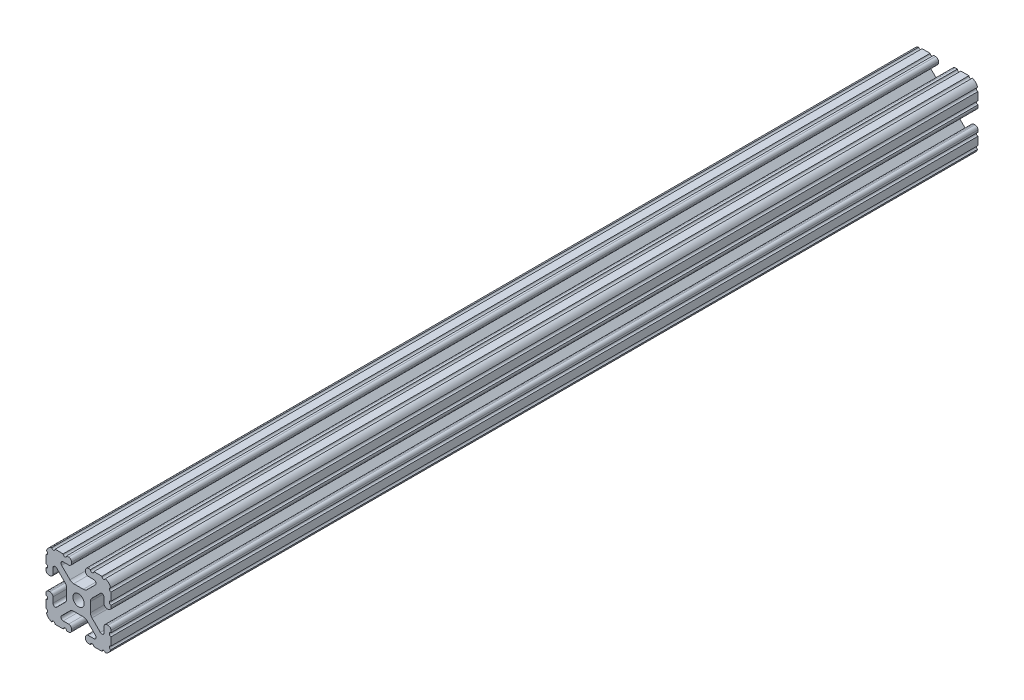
ISO-10303-21;
HEADER;
FILE_DESCRIPTION(('STEP AP214'),'2;1');
FILE_NAME('part.step','',(''),(''),'','','');
FILE_SCHEMA(('AUTOMOTIVE_DESIGN { 1 0 10303 214 1 1 1 1 }'));
ENDSEC;
DATA;
#1=APPLICATION_CONTEXT('core data for automotive mechanical design processes');
#2=APPLICATION_PROTOCOL_DEFINITION('international standard','automotive_design',2000,#1);
#3=PRODUCT_CONTEXT('',#1,'mechanical');
#4=PRODUCT('Part','Part','',(#3));
#5=PRODUCT_RELATED_PRODUCT_CATEGORY('part','',(#4));
#6=PRODUCT_DEFINITION_FORMATION('','',#4);
#7=PRODUCT_DEFINITION_CONTEXT('part definition',#1,'design');
#8=PRODUCT_DEFINITION('design','',#6,#7);
#9=PRODUCT_DEFINITION_SHAPE('','',#8);
#10=(LENGTH_UNIT() NAMED_UNIT(*) SI_UNIT(.MILLI.,.METRE.));
#11=(NAMED_UNIT(*) PLANE_ANGLE_UNIT() SI_UNIT($,.RADIAN.));
#12=(NAMED_UNIT(*) SI_UNIT($,.STERADIAN.) SOLID_ANGLE_UNIT());
#13=UNCERTAINTY_MEASURE_WITH_UNIT(LENGTH_MEASURE(1.E-05),#10,'distance_accuracy_value','');
#14=(GEOMETRIC_REPRESENTATION_CONTEXT(3) GLOBAL_UNCERTAINTY_ASSIGNED_CONTEXT((#13)) GLOBAL_UNIT_ASSIGNED_CONTEXT((#10,
#11,#12)) REPRESENTATION_CONTEXT('',''));
#15=CARTESIAN_POINT('',(0.,0.,0.));
#16=DIRECTION('',(0.,0.,1.));
#17=DIRECTION('',(1.,0.,0.));
#18=AXIS2_PLACEMENT_3D('',#15,#16,#17);
#19=CARTESIAN_POINT('',(5.7912,-19.05,457.2));
#20=DIRECTION('',(0.,1.,0.));
#21=DIRECTION('',(-1.,0.,0.));
#22=AXIS2_PLACEMENT_3D('',#19,#20,#21);
#23=PLANE('',#22);
#24=DIRECTION('',(1.,0.,0.));
#25=VECTOR('',#24,1.);
#26=CARTESIAN_POINT('',(5.7912,-19.05,50.8));
#27=LINE('',#26,#25);
#28=CARTESIAN_POINT('',(5.7912,-19.05,50.8));
#29=VERTEX_POINT('',#28);
#30=CARTESIAN_POINT('',(6.96430523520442,-19.05,50.8));
#31=VERTEX_POINT('',#30);
#32=EDGE_CURVE('E1137',#29,#31,#27,.T.);
#33=ORIENTED_EDGE('',*,*,#32,.F.);
#34=DIRECTION('',(0.,0.,-1.));
#35=VECTOR('',#34,1.);
#36=CARTESIAN_POINT('',(5.7912,-19.05,457.2));
#37=LINE('',#36,#35);
#38=CARTESIAN_POINT('',(5.7912,-19.05,-457.2));
#39=VERTEX_POINT('',#38);
#40=EDGE_CURVE('E1091',#29,#39,#37,.T.);
#41=ORIENTED_EDGE('',*,*,#40,.T.);
#42=DIRECTION('',(1.,0.,0.));
#43=VECTOR('',#42,1.);
#44=CARTESIAN_POINT('',(5.7912,-19.05,-457.2));
#45=LINE('',#44,#43);
#46=CARTESIAN_POINT('',(6.96430523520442,-19.05,-457.2));
#47=VERTEX_POINT('',#46);
#48=EDGE_CURVE('E1003',#39,#47,#45,.T.);
#49=ORIENTED_EDGE('',*,*,#48,.T.);
#50=DIRECTION('',(0.,0.,1.));
#51=VECTOR('',#50,1.);
#52=CARTESIAN_POINT('',(6.96430523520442,-19.05,-457.2));
#53=LINE('',#52,#51);
#54=EDGE_CURVE('E986',#47,#31,#53,.T.);
#55=ORIENTED_EDGE('',*,*,#54,.T.);
#56=EDGE_LOOP('',(#33,#41,#49,#55));
#57=FACE_BOUND('',#56,.T.);
#58=ADVANCED_FACE('F37',(#57),#23,.F.);
#59=CARTESIAN_POINT('',(19.05,-5.7912,457.2));
#60=DIRECTION('',(-1.,0.,0.));
#61=DIRECTION('',(0.,-1.,0.));
#62=AXIS2_PLACEMENT_3D('',#59,#60,#61);
#63=PLANE('',#62);
#64=DIRECTION('',(0.,1.,0.));
#65=VECTOR('',#64,1.);
#66=CARTESIAN_POINT('',(19.05,-5.7912,50.8));
#67=LINE('',#66,#65);
#68=CARTESIAN_POINT('',(19.05,-13.7234770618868,50.8));
#69=VERTEX_POINT('',#68);
#70=CARTESIAN_POINT('',(19.05,-8.99630523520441,50.8));
#71=VERTEX_POINT('',#70);
#72=EDGE_CURVE('E1110',#69,#71,#67,.T.);
#73=ORIENTED_EDGE('',*,*,#72,.F.);
#74=DIRECTION('',(0.,0.,1.));
#75=VECTOR('',#74,1.);
#76=CARTESIAN_POINT('',(19.05,-13.7234770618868,-457.2));
#77=LINE('',#76,#75);
#78=CARTESIAN_POINT('',(19.05,-13.7234770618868,-457.2));
#79=VERTEX_POINT('',#78);
#80=EDGE_CURVE('E989',#69,#79,#77,.F.);
#81=ORIENTED_EDGE('',*,*,#80,.T.);
#82=DIRECTION('',(0.,1.,0.));
#83=VECTOR('',#82,1.);
#84=CARTESIAN_POINT('',(19.05,-5.7912,-457.2));
#85=LINE('',#84,#83);
#86=CARTESIAN_POINT('',(19.05,-8.99630523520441,-457.2));
#87=VERTEX_POINT('',#86);
#88=EDGE_CURVE('E1012',#79,#87,#85,.T.);
#89=ORIENTED_EDGE('',*,*,#88,.T.);
#90=DIRECTION('',(0.,0.,1.));
#91=VECTOR('',#90,1.);
#92=CARTESIAN_POINT('',(19.05,-8.99630523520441,-457.2));
#93=LINE('',#92,#91);
#94=EDGE_CURVE('E996',#87,#71,#93,.T.);
#95=ORIENTED_EDGE('',*,*,#94,.T.);
#96=EDGE_LOOP('',(#73,#81,#89,#95));
#97=FACE_BOUND('',#96,.T.);
#98=ADVANCED_FACE('F1107',(#97),#63,.F.);
#99=CARTESIAN_POINT('',(5.7912,-17.3228,457.2));
#100=DIRECTION('',(0.,0.,-1.));
#101=DIRECTION('',(-1.,0.,0.));
#102=AXIS2_PLACEMENT_3D('',#99,#100,#101);
#103=CYLINDRICAL_SURFACE('',#102,1.7272);
#104=CARTESIAN_POINT('',(5.7912,-17.3228,50.8));
#105=DIRECTION('',(0.,0.,1.));
#106=DIRECTION('',(1.,0.,0.));
#107=AXIS2_PLACEMENT_3D('',#104,#105,#106);
#108=CIRCLE('',#107,1.7272);
#109=CARTESIAN_POINT('',(4.064,-17.3228,50.8));
#110=VERTEX_POINT('',#109);
#111=EDGE_CURVE('E1140',#110,#29,#108,.T.);
#112=ORIENTED_EDGE('',*,*,#111,.F.);
#113=DIRECTION('',(0.,0.,-1.));
#114=VECTOR('',#113,1.);
#115=CARTESIAN_POINT('',(4.064,-17.3228,457.2));
#116=LINE('',#115,#114);
#117=CARTESIAN_POINT('',(4.064,-17.3228,-457.2));
#118=VERTEX_POINT('',#117);
#119=EDGE_CURVE('E1061',#110,#118,#116,.T.);
#120=ORIENTED_EDGE('',*,*,#119,.T.);
#121=CARTESIAN_POINT('',(5.7912,-17.3228,-457.2));
#122=DIRECTION('',(0.,0.,1.));
#123=DIRECTION('',(1.,0.,0.));
#124=AXIS2_PLACEMENT_3D('',#121,#122,#123);
#125=CIRCLE('',#124,1.7272);
#126=EDGE_CURVE('E999',#118,#39,#125,.T.);
#127=ORIENTED_EDGE('',*,*,#126,.T.);
#128=ORIENTED_EDGE('',*,*,#40,.F.);
#129=EDGE_LOOP('',(#112,#120,#127,#128));
#130=FACE_BOUND('',#129,.T.);
#131=ADVANCED_FACE('F39',(#130),#103,.T.);
#132=DIRECTION('',(1.,0.,0.));
#133=VECTOR('',#132,1.);
#134=CARTESIAN_POINT('',(5.7912,-19.05,50.8));
#135=LINE('',#134,#133);
#136=CARTESIAN_POINT('',(8.99630523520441,-19.05,50.8));
#137=VERTEX_POINT('',#136);
#138=CARTESIAN_POINT('',(13.7234770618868,-19.05,50.8));
#139=VERTEX_POINT('',#138);
#140=EDGE_CURVE('E1128',#137,#139,#135,.T.);
#141=ORIENTED_EDGE('',*,*,#140,.F.);
#142=DIRECTION('',(0.,0.,1.));
#143=VECTOR('',#142,1.);
#144=CARTESIAN_POINT('',(8.99630523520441,-19.05,-457.2));
#145=LINE('',#144,#143);
#146=CARTESIAN_POINT('',(8.99630523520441,-19.05,-457.2));
#147=VERTEX_POINT('',#146);
#148=EDGE_CURVE('E984',#137,#147,#145,.F.);
#149=ORIENTED_EDGE('',*,*,#148,.T.);
#150=CARTESIAN_POINT('',(13.7234770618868,-19.05,-457.2));
#151=VERTEX_POINT('',#150);
#152=EDGE_CURVE('E1002',#147,#151,#45,.T.);
#153=ORIENTED_EDGE('',*,*,#152,.T.);
#154=DIRECTION('',(0.,0.,1.));
#155=VECTOR('',#154,1.);
#156=CARTESIAN_POINT('',(13.7234770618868,-19.05,-457.2));
#157=LINE('',#156,#155);
#158=EDGE_CURVE('E59',#151,#139,#157,.T.);
#159=ORIENTED_EDGE('',*,*,#158,.T.);
#160=EDGE_LOOP('',(#141,#149,#153,#159));
#161=FACE_BOUND('',#160,.T.);
#162=ADVANCED_FACE('F1125',(#161),#23,.F.);
#163=CARTESIAN_POINT('',(14.3002,-14.3002,457.2));
#164=DIRECTION('',(0.,0.,-1.));
#165=DIRECTION('',(-1.,0.,0.));
#166=AXIS2_PLACEMENT_3D('',#163,#164,#165);
#167=CYLINDRICAL_SURFACE('',#166,4.7498);
#168=CARTESIAN_POINT('',(14.3002,-14.3002,50.8));
#169=DIRECTION('',(0.,0.,1.));
#170=DIRECTION('',(1.,0.,0.));
#171=AXIS2_PLACEMENT_3D('',#168,#169,#170);
#172=CIRCLE('',#171,4.7498);
#173=CARTESIAN_POINT('',(15.7312177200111,-18.8293045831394,50.8));
#174=VERTEX_POINT('',#173);
#175=CARTESIAN_POINT('',(18.8293045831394,-15.7312177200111,50.8));
#176=VERTEX_POINT('',#175);
#177=EDGE_CURVE('E1119',#174,#176,#172,.T.);
#178=ORIENTED_EDGE('',*,*,#177,.F.);
#179=DIRECTION('',(0.,0.,1.));
#180=VECTOR('',#179,1.);
#181=CARTESIAN_POINT('',(15.7312177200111,-18.8293045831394,-1.11022302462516E-13));
#182=LINE('',#181,#180);
#183=CARTESIAN_POINT('',(15.7312177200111,-18.8293045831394,-457.2));
#184=VERTEX_POINT('',#183);
#185=EDGE_CURVE('E981',#174,#184,#182,.F.);
#186=ORIENTED_EDGE('',*,*,#185,.T.);
#187=CARTESIAN_POINT('',(14.3002,-14.3002,-457.2));
#188=DIRECTION('',(0.,0.,1.));
#189=DIRECTION('',(1.,0.,0.));
#190=AXIS2_PLACEMENT_3D('',#187,#188,#189);
#191=CIRCLE('',#190,4.7498);
#192=CARTESIAN_POINT('',(18.8293045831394,-15.7312177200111,-457.2));
#193=VERTEX_POINT('',#192);
#194=EDGE_CURVE('E1006',#184,#193,#191,.T.);
#195=ORIENTED_EDGE('',*,*,#194,.T.);
#196=DIRECTION('',(0.,0.,1.));
#197=VECTOR('',#196,1.);
#198=CARTESIAN_POINT('',(18.8293045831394,-15.7312177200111,-1.11022302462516E-13));
#199=LINE('',#198,#197);
#200=EDGE_CURVE('E991',#193,#176,#199,.T.);
#201=ORIENTED_EDGE('',*,*,#200,.T.);
#202=EDGE_LOOP('',(#178,#186,#195,#201));
#203=FACE_BOUND('',#202,.T.);
#204=ADVANCED_FACE('F1117',(#203),#167,.T.);
#205=DIRECTION('',(0.,1.,0.));
#206=VECTOR('',#205,1.);
#207=CARTESIAN_POINT('',(19.05,-5.7912,50.8));
#208=LINE('',#207,#206);
#209=CARTESIAN_POINT('',(19.05,-6.96430523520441,50.8));
#210=VERTEX_POINT('',#209);
#211=CARTESIAN_POINT('',(19.05,-5.7912,50.8));
#212=VERTEX_POINT('',#211);
#213=EDGE_CURVE('E1542',#210,#212,#208,.T.);
#214=ORIENTED_EDGE('',*,*,#213,.F.);
#215=DIRECTION('',(0.,0.,1.));
#216=VECTOR('',#215,1.);
#217=CARTESIAN_POINT('',(19.05,-6.96430523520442,-457.2));
#218=LINE('',#217,#216);
#219=CARTESIAN_POINT('',(19.05,-6.96430523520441,-457.2));
#220=VERTEX_POINT('',#219);
#221=EDGE_CURVE('E994',#210,#220,#218,.F.);
#222=ORIENTED_EDGE('',*,*,#221,.T.);
#223=CARTESIAN_POINT('',(19.05,-5.7912,-457.2));
#224=VERTEX_POINT('',#223);
#225=EDGE_CURVE('E1009',#220,#224,#85,.T.);
#226=ORIENTED_EDGE('',*,*,#225,.T.);
#227=DIRECTION('',(0.,0.,-1.));
#228=VECTOR('',#227,1.);
#229=CARTESIAN_POINT('',(19.05,-5.7912,457.2));
#230=LINE('',#229,#228);
#231=EDGE_CURVE('E1089',#212,#224,#230,.T.);
#232=ORIENTED_EDGE('',*,*,#231,.F.);
#233=EDGE_LOOP('',(#214,#222,#226,#232));
#234=FACE_BOUND('',#233,.T.);
#235=ADVANCED_FACE('F1568',(#234),#63,.F.);
#236=CARTESIAN_POINT('',(17.3228,-5.7912,457.2));
#237=DIRECTION('',(0.,0.,-1.));
#238=DIRECTION('',(-1.,0.,0.));
#239=AXIS2_PLACEMENT_3D('',#236,#237,#238);
#240=CYLINDRICAL_SURFACE('',#239,1.7272);
#241=CARTESIAN_POINT('',(17.3228,-5.7912,50.8));
#242=DIRECTION('',(0.,0.,1.));
#243=DIRECTION('',(1.,0.,0.));
#244=AXIS2_PLACEMENT_3D('',#241,#242,#243);
#245=CIRCLE('',#244,1.7272);
#246=CARTESIAN_POINT('',(17.3228,-4.064,50.8));
#247=VERTEX_POINT('',#246);
#248=EDGE_CURVE('E1540',#212,#247,#245,.T.);
#249=ORIENTED_EDGE('',*,*,#248,.F.);
#250=ORIENTED_EDGE('',*,*,#231,.T.);
#251=CARTESIAN_POINT('',(17.3228,-5.7912,-457.2));
#252=DIRECTION('',(0.,0.,1.));
#253=DIRECTION('',(-1.,0.,0.));
#254=AXIS2_PLACEMENT_3D('',#251,#252,#253);
#255=CIRCLE('',#254,1.7272);
#256=CARTESIAN_POINT('',(17.3228,-4.064,-457.2));
#257=VERTEX_POINT('',#256);
#258=EDGE_CURVE('E1013',#224,#257,#255,.T.);
#259=ORIENTED_EDGE('',*,*,#258,.T.);
#260=DIRECTION('',(0.,0.,-1.));
#261=VECTOR('',#260,1.);
#262=CARTESIAN_POINT('',(17.3228,-4.064,457.2));
#263=LINE('',#262,#261);
#264=EDGE_CURVE('E1087',#247,#257,#263,.T.);
#265=ORIENTED_EDGE('',*,*,#264,.F.);
#266=EDGE_LOOP('',(#249,#250,#259,#265));
#267=FACE_BOUND('',#266,.T.);
#268=ADVANCED_FACE('F2397',(#267),#240,.T.);
#269=CARTESIAN_POINT('',(16.7132,-4.064,457.2));
#270=DIRECTION('',(0.,-1.,0.));
#271=DIRECTION('',(1.,0.,0.));
#272=AXIS2_PLACEMENT_3D('',#269,#270,#271);
#273=PLANE('',#272);
#274=DIRECTION('',(-1.,0.,0.));
#275=VECTOR('',#274,1.);
#276=CARTESIAN_POINT('',(16.7132,-4.064,50.8));
#277=LINE('',#276,#275);
#278=CARTESIAN_POINT('',(16.7132,-4.064,50.8));
#279=VERTEX_POINT('',#278);
#280=EDGE_CURVE('E1538',#247,#279,#277,.T.);
#281=ORIENTED_EDGE('',*,*,#280,.F.);
#282=ORIENTED_EDGE('',*,*,#264,.T.);
#283=DIRECTION('',(-1.,0.,0.));
#284=VECTOR('',#283,1.);
#285=CARTESIAN_POINT('',(16.7132,-4.064,-457.2));
#286=LINE('',#285,#284);
#287=CARTESIAN_POINT('',(16.7132,-4.064,-457.2));
#288=VERTEX_POINT('',#287);
#289=EDGE_CURVE('E1016',#257,#288,#286,.T.);
#290=ORIENTED_EDGE('',*,*,#289,.T.);
#291=DIRECTION('',(0.,0.,-1.));
#292=VECTOR('',#291,1.);
#293=CARTESIAN_POINT('',(16.7132,-4.064,457.2));
#294=LINE('',#293,#292);
#295=EDGE_CURVE('E1085',#279,#288,#294,.T.);
#296=ORIENTED_EDGE('',*,*,#295,.F.);
#297=EDGE_LOOP('',(#281,#282,#290,#296));
#298=FACE_BOUND('',#297,.T.);
#299=ADVANCED_FACE('F2387',(#298),#273,.F.);
#300=CARTESIAN_POINT('',(16.7132,-5.7912,457.2));
#301=DIRECTION('',(0.,0.,-1.));
#302=DIRECTION('',(-1.,0.,0.));
#303=AXIS2_PLACEMENT_3D('',#300,#301,#302);
#304=CYLINDRICAL_SURFACE('',#303,1.7272);
#305=CARTESIAN_POINT('',(16.7132,-5.7912,50.8));
#306=DIRECTION('',(0.,0.,1.));
#307=DIRECTION('',(1.,0.,0.));
#308=AXIS2_PLACEMENT_3D('',#305,#306,#307);
#309=CIRCLE('',#308,1.7272);
#310=CARTESIAN_POINT('',(14.986,-5.7912,50.8));
#311=VERTEX_POINT('',#310);
#312=EDGE_CURVE('E1536',#279,#311,#309,.T.);
#313=ORIENTED_EDGE('',*,*,#312,.F.);
#314=ORIENTED_EDGE('',*,*,#295,.T.);
#315=CARTESIAN_POINT('',(16.7132,-5.7912,-457.2));
#316=DIRECTION('',(0.,0.,1.));
#317=DIRECTION('',(-1.,0.,0.));
#318=AXIS2_PLACEMENT_3D('',#315,#316,#317);
#319=CIRCLE('',#318,1.7272);
#320=CARTESIAN_POINT('',(14.986,-5.7912,-457.2));
#321=VERTEX_POINT('',#320);
#322=EDGE_CURVE('E1019',#288,#321,#319,.T.);
#323=ORIENTED_EDGE('',*,*,#322,.T.);
#324=DIRECTION('',(0.,0.,-1.));
#325=VECTOR('',#324,1.);
#326=CARTESIAN_POINT('',(14.986,-5.7912,457.2));
#327=LINE('',#326,#325);
#328=EDGE_CURVE('E1083',#311,#321,#327,.T.);
#329=ORIENTED_EDGE('',*,*,#328,.F.);
#330=EDGE_LOOP('',(#313,#314,#323,#329));
#331=FACE_BOUND('',#330,.T.);
#332=ADVANCED_FACE('F2377',(#331),#304,.T.);
#333=CARTESIAN_POINT('',(14.986,-8.99630523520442,457.2));
#334=DIRECTION('',(1.,0.,0.));
#335=DIRECTION('',(0.,0.,-1.));
#336=AXIS2_PLACEMENT_3D('',#333,#334,#335);
#337=PLANE('',#336);
#338=DIRECTION('',(0.,-1.,0.));
#339=VECTOR('',#338,1.);
#340=CARTESIAN_POINT('',(14.986,-8.99630523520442,50.8));
#341=LINE('',#340,#339);
#342=CARTESIAN_POINT('',(14.986,-8.99630523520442,50.8));
#343=VERTEX_POINT('',#342);
#344=EDGE_CURVE('E1534',#311,#343,#341,.T.);
#345=ORIENTED_EDGE('',*,*,#344,.F.);
#346=ORIENTED_EDGE('',*,*,#328,.T.);
#347=DIRECTION('',(0.,-1.,0.));
#348=VECTOR('',#347,1.);
#349=CARTESIAN_POINT('',(14.986,-8.99630523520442,-457.2));
#350=LINE('',#349,#348);
#351=CARTESIAN_POINT('',(14.986,-8.99630523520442,-457.2));
#352=VERTEX_POINT('',#351);
#353=EDGE_CURVE('E1022',#321,#352,#350,.T.);
#354=ORIENTED_EDGE('',*,*,#353,.T.);
#355=DIRECTION('',(0.,0.,-1.));
#356=VECTOR('',#355,1.);
#357=CARTESIAN_POINT('',(14.986,-8.99630523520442,457.2));
#358=LINE('',#357,#356);
#359=EDGE_CURVE('E1081',#343,#352,#358,.T.);
#360=ORIENTED_EDGE('',*,*,#359,.F.);
#361=EDGE_LOOP('',(#345,#346,#354,#360));
#362=FACE_BOUND('',#361,.T.);
#363=ADVANCED_FACE('F2367',(#362),#337,.F.);
#364=CARTESIAN_POINT('',(13.6953052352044,-8.99630523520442,457.2));
#365=DIRECTION('',(0.,0.,-1.));
#366=DIRECTION('',(-1.,0.,0.));
#367=AXIS2_PLACEMENT_3D('',#364,#365,#366);
#368=CYLINDRICAL_SURFACE('',#367,1.29069476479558);
#369=CARTESIAN_POINT('',(13.6953052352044,-8.99630523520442,50.8));
#370=DIRECTION('',(0.,0.,1.));
#371=DIRECTION('',(1.,0.,0.));
#372=AXIS2_PLACEMENT_3D('',#369,#370,#371);
#373=CIRCLE('',#372,1.29069476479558);
#374=CARTESIAN_POINT('',(12.7826462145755,-9.90896425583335,50.8));
#375=VERTEX_POINT('',#374);
#376=EDGE_CURVE('E1532',#343,#375,#373,.F.);
#377=ORIENTED_EDGE('',*,*,#376,.F.);
#378=ORIENTED_EDGE('',*,*,#359,.T.);
#379=CARTESIAN_POINT('',(13.6953052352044,-8.99630523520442,-457.2));
#380=DIRECTION('',(0.,0.,-1.));
#381=DIRECTION('',(1.,0.,0.));
#382=AXIS2_PLACEMENT_3D('',#379,#380,#381);
#383=CIRCLE('',#382,1.29069476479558);
#384=CARTESIAN_POINT('',(12.7826462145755,-9.90896425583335,-457.2));
#385=VERTEX_POINT('',#384);
#386=EDGE_CURVE('E1025',#352,#385,#383,.T.);
#387=ORIENTED_EDGE('',*,*,#386,.T.);
#388=DIRECTION('',(0.,0.,-1.));
#389=VECTOR('',#388,1.);
#390=CARTESIAN_POINT('',(12.7826462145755,-9.90896425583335,457.2));
#391=LINE('',#390,#389);
#392=EDGE_CURVE('E1079',#375,#385,#391,.T.);
#393=ORIENTED_EDGE('',*,*,#392,.F.);
#394=EDGE_LOOP('',(#377,#378,#387,#393));
#395=FACE_BOUND('',#394,.T.);
#396=ADVANCED_FACE('F2357',(#395),#368,.F.);
#397=CARTESIAN_POINT('',(12.7826462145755,-9.90896425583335,457.2));
#398=DIRECTION('',(-0.707106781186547,-0.707106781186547,0.));
#399=DIRECTION('',(0.707106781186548,-0.707106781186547,0.));
#400=AXIS2_PLACEMENT_3D('',#397,#398,#399);
#401=PLANE('',#400);
#402=DIRECTION('',(-0.707106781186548,0.707106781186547,0.));
#403=VECTOR('',#402,1.);
#404=CARTESIAN_POINT('',(12.7826462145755,-9.90896425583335,50.8));
#405=LINE('',#404,#403);
#406=CARTESIAN_POINT('',(7.8888977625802,-5.01521580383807,50.8));
#407=VERTEX_POINT('',#406);
#408=EDGE_CURVE('E1530',#375,#407,#405,.T.);
#409=ORIENTED_EDGE('',*,*,#408,.F.);
#410=ORIENTED_EDGE('',*,*,#392,.T.);
#411=DIRECTION('',(-0.707106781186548,0.707106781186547,0.));
#412=VECTOR('',#411,1.);
#413=CARTESIAN_POINT('',(12.7826462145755,-9.90896425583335,-457.2));
#414=LINE('',#413,#412);
#415=CARTESIAN_POINT('',(7.8888977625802,-5.01521580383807,-457.2));
#416=VERTEX_POINT('',#415);
#417=EDGE_CURVE('E1028',#385,#416,#414,.T.);
#418=ORIENTED_EDGE('',*,*,#417,.T.);
#419=DIRECTION('',(0.,0.,-1.));
#420=VECTOR('',#419,1.);
#421=CARTESIAN_POINT('',(7.8888977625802,-5.01521580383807,457.2));
#422=LINE('',#421,#420);
#423=EDGE_CURVE('E1077',#407,#416,#422,.T.);
#424=ORIENTED_EDGE('',*,*,#423,.F.);
#425=EDGE_LOOP('',(#409,#410,#418,#424));
#426=FACE_BOUND('',#425,.T.);
#427=ADVANCED_FACE('F2347',(#426),#401,.F.);
#428=CARTESIAN_POINT('',(10.0711,-2.83301356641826,457.2));
#429=DIRECTION('',(0.,0.,-1.));
#430=DIRECTION('',(-1.,0.,0.));
#431=AXIS2_PLACEMENT_3D('',#428,#429,#430);
#432=CYLINDRICAL_SURFACE('',#431,3.0861);
#433=CARTESIAN_POINT('',(10.0711,-2.83301356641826,50.8));
#434=DIRECTION('',(0.,0.,1.));
#435=DIRECTION('',(1.,0.,0.));
#436=AXIS2_PLACEMENT_3D('',#433,#434,#435);
#437=CIRCLE('',#436,3.0861);
#438=CARTESIAN_POINT('',(6.985,-2.83301356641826,50.8));
#439=VERTEX_POINT('',#438);
#440=EDGE_CURVE('E1528',#407,#439,#437,.F.);
#441=ORIENTED_EDGE('',*,*,#440,.F.);
#442=ORIENTED_EDGE('',*,*,#423,.T.);
#443=CARTESIAN_POINT('',(10.0711,-2.83301356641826,-457.2));
#444=DIRECTION('',(0.,0.,-1.));
#445=DIRECTION('',(-1.,0.,0.));
#446=AXIS2_PLACEMENT_3D('',#443,#444,#445);
#447=CIRCLE('',#446,3.0861);
#448=CARTESIAN_POINT('',(6.985,-2.83301356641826,-457.2));
#449=VERTEX_POINT('',#448);
#450=EDGE_CURVE('E1031',#416,#449,#447,.T.);
#451=ORIENTED_EDGE('',*,*,#450,.T.);
#452=DIRECTION('',(0.,0.,-1.));
#453=VECTOR('',#452,1.);
#454=CARTESIAN_POINT('',(6.985,-2.83301356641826,457.2));
#455=LINE('',#454,#453);
#456=EDGE_CURVE('E1075',#439,#449,#455,.T.);
#457=ORIENTED_EDGE('',*,*,#456,.F.);
#458=EDGE_LOOP('',(#441,#442,#451,#457));
#459=FACE_BOUND('',#458,.T.);
#460=ADVANCED_FACE('F1560',(#459),#432,.F.);
#461=CARTESIAN_POINT('',(6.985,0.,457.2));
#462=DIRECTION('',(-1.,0.,0.));
#463=DIRECTION('',(0.,0.,1.));
#464=AXIS2_PLACEMENT_3D('',#461,#462,#463);
#465=PLANE('',#464);
#466=DIRECTION('',(0.,1.,0.));
#467=VECTOR('',#466,1.);
#468=CARTESIAN_POINT('',(6.985,0.,50.8));
#469=LINE('',#468,#467);
#470=CARTESIAN_POINT('',(6.985,2.83301356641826,50.8));
#471=VERTEX_POINT('',#470);
#472=EDGE_CURVE('E1526',#439,#471,#469,.T.);
#473=ORIENTED_EDGE('',*,*,#472,.F.);
#474=ORIENTED_EDGE('',*,*,#456,.T.);
#475=DIRECTION('',(0.,1.,0.));
#476=VECTOR('',#475,1.);
#477=CARTESIAN_POINT('',(6.985,0.,-457.2));
#478=LINE('',#477,#476);
#479=CARTESIAN_POINT('',(6.985,2.83301356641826,-457.2));
#480=VERTEX_POINT('',#479);
#481=EDGE_CURVE('E1034',#449,#480,#478,.T.);
#482=ORIENTED_EDGE('',*,*,#481,.T.);
#483=DIRECTION('',(0.,0.,-1.));
#484=VECTOR('',#483,1.);
#485=CARTESIAN_POINT('',(6.985,2.83301356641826,457.2));
#486=LINE('',#485,#484);
#487=EDGE_CURVE('E838',#471,#480,#486,.T.);
#488=ORIENTED_EDGE('',*,*,#487,.F.);
#489=EDGE_LOOP('',(#473,#474,#482,#488));
#490=FACE_BOUND('',#489,.T.);
#491=ADVANCED_FACE('F1552',(#490),#465,.F.);
#492=CARTESIAN_POINT('',(0.,0.,457.2));
#493=DIRECTION('',(0.,0.,-1.));
#494=DIRECTION('',(-1.,0.,0.));
#495=AXIS2_PLACEMENT_3D('',#492,#493,#494);
#496=CYLINDRICAL_SURFACE('',#495,3.32740000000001);
#497=CARTESIAN_POINT('',(0.,0.,-457.2));
#498=DIRECTION('',(0.,0.,-1.));
#499=DIRECTION('',(1.,0.,0.));
#500=AXIS2_PLACEMENT_3D('',#497,#498,#499);
#501=CIRCLE('',#500,3.32740000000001);
#502=CARTESIAN_POINT('',(-3.32740000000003,0.,-457.2));
#503=VERTEX_POINT('',#502);
#504=EDGE_CURVE('E1037',#503,#503,#501,.T.);
#505=CARTESIAN_POINT('',(0.,0.,50.8));
#506=DIRECTION('',(0.,0.,1.));
#507=DIRECTION('',(1.,0.,0.));
#508=AXIS2_PLACEMENT_3D('',#505,#506,#507);
#509=CIRCLE('',#508,3.32740000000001);
#510=CARTESIAN_POINT('',(-3.32740000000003,0.,50.7999999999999));
#511=VERTEX_POINT('',#510);
#512=EDGE_CURVE('E1377',#511,#511,#509,.F.);
#513=CARTESIAN_POINT('',(-3.32740000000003,0.,-457.2));
#514=CARTESIAN_POINT('',(-3.32740000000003,0.,-451.908333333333));
#515=CARTESIAN_POINT('',(-3.32740000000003,0.,-446.616666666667));
#516=CARTESIAN_POINT('',(-3.32740000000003,0.,-436.033333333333));
#517=CARTESIAN_POINT('',(-3.32740000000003,0.,-430.741666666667));
#518=CARTESIAN_POINT('',(-3.32740000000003,0.,-420.158333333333));
#519=CARTESIAN_POINT('',(-3.32740000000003,0.,-414.866666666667));
#520=CARTESIAN_POINT('',(-3.32740000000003,0.,-404.283333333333));
#521=CARTESIAN_POINT('',(-3.32740000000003,0.,-398.991666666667));
#522=CARTESIAN_POINT('',(-3.32740000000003,0.,-388.408333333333));
#523=CARTESIAN_POINT('',(-3.32740000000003,0.,-383.116666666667));
#524=CARTESIAN_POINT('',(-3.32740000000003,0.,-372.533333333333));
#525=CARTESIAN_POINT('',(-3.32740000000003,0.,-367.241666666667));
#526=CARTESIAN_POINT('',(-3.32740000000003,0.,-356.658333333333));
#527=CARTESIAN_POINT('',(-3.32740000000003,0.,-351.366666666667));
#528=CARTESIAN_POINT('',(-3.32740000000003,0.,-340.783333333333));
#529=CARTESIAN_POINT('',(-3.32740000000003,0.,-335.491666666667));
#530=CARTESIAN_POINT('',(-3.32740000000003,0.,-324.908333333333));
#531=CARTESIAN_POINT('',(-3.32740000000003,0.,-319.616666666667));
#532=CARTESIAN_POINT('',(-3.32740000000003,0.,-309.033333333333));
#533=CARTESIAN_POINT('',(-3.32740000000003,0.,-303.741666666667));
#534=CARTESIAN_POINT('',(-3.32740000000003,0.,-293.158333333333));
#535=CARTESIAN_POINT('',(-3.32740000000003,0.,-287.866666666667));
#536=CARTESIAN_POINT('',(-3.32740000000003,0.,-277.283333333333));
#537=CARTESIAN_POINT('',(-3.32740000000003,0.,-271.991666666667));
#538=CARTESIAN_POINT('',(-3.32740000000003,0.,-261.408333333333));
#539=CARTESIAN_POINT('',(-3.32740000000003,0.,-256.116666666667));
#540=CARTESIAN_POINT('',(-3.32740000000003,0.,-245.533333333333));
#541=CARTESIAN_POINT('',(-3.32740000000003,0.,-240.241666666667));
#542=CARTESIAN_POINT('',(-3.32740000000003,0.,-229.658333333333));
#543=CARTESIAN_POINT('',(-3.32740000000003,0.,-224.366666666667));
#544=CARTESIAN_POINT('',(-3.32740000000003,0.,-213.783333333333));
#545=CARTESIAN_POINT('',(-3.32740000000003,0.,-208.491666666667));
#546=CARTESIAN_POINT('',(-3.32740000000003,0.,-197.908333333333));
#547=CARTESIAN_POINT('',(-3.32740000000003,0.,-192.616666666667));
#548=CARTESIAN_POINT('',(-3.32740000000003,0.,-182.033333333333));
#549=CARTESIAN_POINT('',(-3.32740000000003,0.,-176.741666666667));
#550=CARTESIAN_POINT('',(-3.32740000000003,0.,-166.158333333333));
#551=CARTESIAN_POINT('',(-3.32740000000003,0.,-160.866666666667));
#552=CARTESIAN_POINT('',(-3.32740000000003,0.,-150.283333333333));
#553=CARTESIAN_POINT('',(-3.32740000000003,0.,-144.991666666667));
#554=CARTESIAN_POINT('',(-3.32740000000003,0.,-134.408333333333));
#555=CARTESIAN_POINT('',(-3.32740000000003,0.,-129.116666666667));
#556=CARTESIAN_POINT('',(-3.32740000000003,0.,-118.533333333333));
#557=CARTESIAN_POINT('',(-3.32740000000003,0.,-113.241666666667));
#558=CARTESIAN_POINT('',(-3.32740000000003,0.,-102.658333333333));
#559=CARTESIAN_POINT('',(-3.32740000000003,0.,-97.3666666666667));
#560=CARTESIAN_POINT('',(-3.32740000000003,0.,-86.7833333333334));
#561=CARTESIAN_POINT('',(-3.32740000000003,0.,-81.4916666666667));
#562=CARTESIAN_POINT('',(-3.32740000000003,0.,-70.9083333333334));
#563=CARTESIAN_POINT('',(-3.32740000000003,0.,-65.6166666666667));
#564=CARTESIAN_POINT('',(-3.32740000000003,0.,-55.0333333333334));
#565=CARTESIAN_POINT('',(-3.32740000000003,0.,-49.7416666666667));
#566=CARTESIAN_POINT('',(-3.32740000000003,0.,-39.1583333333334));
#567=CARTESIAN_POINT('',(-3.32740000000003,0.,-33.8666666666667));
#568=CARTESIAN_POINT('',(-3.32740000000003,0.,-23.2833333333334));
#569=CARTESIAN_POINT('',(-3.32740000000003,0.,-17.9916666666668));
#570=CARTESIAN_POINT('',(-3.32740000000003,0.,-7.40833333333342));
#571=CARTESIAN_POINT('',(-3.32740000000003,0.,-2.11666666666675));
#572=CARTESIAN_POINT('',(-3.32740000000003,0.,8.46666666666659));
#573=CARTESIAN_POINT('',(-3.32740000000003,0.,13.7583333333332));
#574=CARTESIAN_POINT('',(-3.32740000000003,0.,24.3416666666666));
#575=CARTESIAN_POINT('',(-3.32740000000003,0.,29.6333333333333));
#576=CARTESIAN_POINT('',(-3.32740000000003,0.,40.2166666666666));
#577=CARTESIAN_POINT('',(-3.32740000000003,0.,45.5083333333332));
#578=CARTESIAN_POINT('',(-3.32740000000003,0.,50.7999999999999));
#579=B_SPLINE_CURVE_WITH_KNOTS('',3,(#513,#514,#515,#516,#517,#518,#519,#520,#521,#522,#523,
#524,#525,#526,#527,#528,#529,#530,#531,#532,#533,#534,#535,#536,#537,#538,#539,#540,#541,#542,
#543,#544,#545,#546,#547,#548,#549,#550,#551,#552,#553,#554,#555,#556,#557,#558,#559,#560,#561,
#562,#563,#564,#565,#566,#567,#568,#569,#570,#571,#572,#573,#574,#575,#576,#577,#578),
.UNSPECIFIED.,.F.,.F.,(4,2,2,2,2,2,2,2,2,2,2,2,2,2,2,2,2,2,2,2,2,2,2,2,2,2,2,2,2,2,2,2,4),(0.,
15.875,31.7499999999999,47.625,63.5,79.375,95.2499999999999,111.125,127.,142.875,158.75,174.625,
190.5,206.375,222.25,238.125,254.,269.875,285.75,301.625,317.5,333.375,349.25,365.125,381.,
396.875,412.75,428.625,444.5,460.375,476.25,492.125,508.),.UNSPECIFIED.);
#580=EDGE_CURVE('BSEAM1549',#503,#511,#579,.T.);
#581=ORIENTED_EDGE('',*,*,#504,.T.);
#582=ORIENTED_EDGE('',*,*,#512,.F.);
#583=ORIENTED_EDGE('',*,*,#580,.T.);
#584=ORIENTED_EDGE('',*,*,#580,.F.);
#585=EDGE_LOOP('',(#581,#583,#582,#584));
#586=FACE_BOUND('',#585,.T.);
#587=ADVANCED_FACE('F1549',(#586),#496,.F.);
#588=CARTESIAN_POINT('',(0.,-6.985,457.2));
#589=DIRECTION('',(0.,1.,0.));
#590=DIRECTION('',(0.,0.,1.));
#591=AXIS2_PLACEMENT_3D('',#588,#589,#590);
#592=PLANE('',#591);
#593=DIRECTION('',(1.,0.,0.));
#594=VECTOR('',#593,1.);
#595=CARTESIAN_POINT('',(0.,-6.985,50.8));
#596=LINE('',#595,#594);
#597=CARTESIAN_POINT('',(-2.83301356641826,-6.985,50.8));
#598=VERTEX_POINT('',#597);
#599=CARTESIAN_POINT('',(2.83301356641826,-6.985,50.8));
#600=VERTEX_POINT('',#599);
#601=EDGE_CURVE('E1484',#598,#600,#596,.T.);
#602=ORIENTED_EDGE('',*,*,#601,.F.);
#603=DIRECTION('',(0.,0.,-1.));
#604=VECTOR('',#603,1.);
#605=CARTESIAN_POINT('',(-2.83301356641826,-6.985,457.2));
#606=LINE('',#605,#604);
#607=CARTESIAN_POINT('',(-2.83301356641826,-6.985,-457.2));
#608=VERTEX_POINT('',#607);
#609=EDGE_CURVE('E952',#598,#608,#606,.T.);
#610=ORIENTED_EDGE('',*,*,#609,.T.);
#611=DIRECTION('',(1.,0.,0.));
#612=VECTOR('',#611,1.);
#613=CARTESIAN_POINT('',(0.,-6.985,-457.2));
#614=LINE('',#613,#612);
#615=CARTESIAN_POINT('',(2.83301356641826,-6.985,-457.2));
#616=VERTEX_POINT('',#615);
#617=EDGE_CURVE('E1040',#608,#616,#614,.T.);
#618=ORIENTED_EDGE('',*,*,#617,.T.);
#619=DIRECTION('',(0.,0.,-1.));
#620=VECTOR('',#619,1.);
#621=CARTESIAN_POINT('',(2.83301356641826,-6.985,457.2));
#622=LINE('',#621,#620);
#623=EDGE_CURVE('E1073',#600,#616,#622,.T.);
#624=ORIENTED_EDGE('',*,*,#623,.F.);
#625=EDGE_LOOP('',(#602,#610,#618,#624));
#626=FACE_BOUND('',#625,.T.);
#627=ADVANCED_FACE('F1551',(#626),#592,.F.);
#628=CARTESIAN_POINT('',(2.83301356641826,-10.0711,457.2));
#629=DIRECTION('',(0.,0.,-1.));
#630=DIRECTION('',(-1.,0.,0.));
#631=AXIS2_PLACEMENT_3D('',#628,#629,#630);
#632=CYLINDRICAL_SURFACE('',#631,3.0861);
#633=CARTESIAN_POINT('',(2.83301356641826,-10.0711,50.8));
#634=DIRECTION('',(0.,0.,1.));
#635=DIRECTION('',(1.,0.,0.));
#636=AXIS2_PLACEMENT_3D('',#633,#634,#635);
#637=CIRCLE('',#636,3.0861);
#638=CARTESIAN_POINT('',(5.01521580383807,-7.8888977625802,50.8));
#639=VERTEX_POINT('',#638);
#640=EDGE_CURVE('E1490',#600,#639,#637,.F.);
#641=ORIENTED_EDGE('',*,*,#640,.F.);
#642=ORIENTED_EDGE('',*,*,#623,.T.);
#643=CARTESIAN_POINT('',(2.83301356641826,-10.0711,-457.2));
#644=DIRECTION('',(0.,0.,-1.));
#645=DIRECTION('',(-1.,0.,0.));
#646=AXIS2_PLACEMENT_3D('',#643,#644,#645);
#647=CIRCLE('',#646,3.0861);
#648=CARTESIAN_POINT('',(5.01521580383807,-7.8888977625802,-457.2));
#649=VERTEX_POINT('',#648);
#650=EDGE_CURVE('E1043',#616,#649,#647,.T.);
#651=ORIENTED_EDGE('',*,*,#650,.T.);
#652=DIRECTION('',(0.,0.,-1.));
#653=VECTOR('',#652,1.);
#654=CARTESIAN_POINT('',(5.01521580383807,-7.8888977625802,457.2));
#655=LINE('',#654,#653);
#656=EDGE_CURVE('E1071',#639,#649,#655,.T.);
#657=ORIENTED_EDGE('',*,*,#656,.F.);
#658=EDGE_LOOP('',(#641,#642,#651,#657));
#659=FACE_BOUND('',#658,.T.);
#660=ADVANCED_FACE('F1174',(#659),#632,.F.);
#661=CARTESIAN_POINT('',(5.01521580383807,-7.8888977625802,457.2));
#662=DIRECTION('',(0.707106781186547,0.707106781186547,0.));
#663=DIRECTION('',(-0.707106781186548,0.707106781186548,0.));
#664=AXIS2_PLACEMENT_3D('',#661,#662,#663);
#665=PLANE('',#664);
#666=DIRECTION('',(0.707106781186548,-0.707106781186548,0.));
#667=VECTOR('',#666,1.);
#668=CARTESIAN_POINT('',(5.01521580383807,-7.8888977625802,50.8));
#669=LINE('',#668,#667);
#670=CARTESIAN_POINT('',(9.90896425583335,-12.7826462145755,50.8));
#671=VERTEX_POINT('',#670);
#672=EDGE_CURVE('E1171',#639,#671,#669,.T.);
#673=ORIENTED_EDGE('',*,*,#672,.F.);
#674=ORIENTED_EDGE('',*,*,#656,.T.);
#675=DIRECTION('',(0.707106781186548,-0.707106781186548,0.));
#676=VECTOR('',#675,1.);
#677=CARTESIAN_POINT('',(5.01521580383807,-7.8888977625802,-457.2));
#678=LINE('',#677,#676);
#679=CARTESIAN_POINT('',(9.90896425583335,-12.7826462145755,-457.2));
#680=VERTEX_POINT('',#679);
#681=EDGE_CURVE('E1046',#649,#680,#678,.T.);
#682=ORIENTED_EDGE('',*,*,#681,.T.);
#683=DIRECTION('',(0.,0.,-1.));
#684=VECTOR('',#683,1.);
#685=CARTESIAN_POINT('',(9.90896425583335,-12.7826462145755,457.2));
#686=LINE('',#685,#684);
#687=EDGE_CURVE('E1069',#671,#680,#686,.T.);
#688=ORIENTED_EDGE('',*,*,#687,.F.);
#689=EDGE_LOOP('',(#673,#674,#682,#688));
#690=FACE_BOUND('',#689,.T.);
#691=ADVANCED_FACE('F1169',(#690),#665,.F.);
#692=CARTESIAN_POINT('',(8.99630523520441,-13.6953052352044,457.2));
#693=DIRECTION('',(0.,0.,-1.));
#694=DIRECTION('',(-1.,0.,0.));
#695=AXIS2_PLACEMENT_3D('',#692,#693,#694);
#696=CYLINDRICAL_SURFACE('',#695,1.29069476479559);
#697=CARTESIAN_POINT('',(8.99630523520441,-13.6953052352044,50.8));
#698=DIRECTION('',(0.,0.,1.));
#699=DIRECTION('',(1.,0.,0.));
#700=AXIS2_PLACEMENT_3D('',#697,#698,#699);
#701=CIRCLE('',#700,1.29069476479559);
#702=CARTESIAN_POINT('',(8.99630523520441,-14.986,50.8));
#703=VERTEX_POINT('',#702);
#704=EDGE_CURVE('E1166',#671,#703,#701,.F.);
#705=ORIENTED_EDGE('',*,*,#704,.F.);
#706=ORIENTED_EDGE('',*,*,#687,.T.);
#707=CARTESIAN_POINT('',(8.99630523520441,-13.6953052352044,-457.2));
#708=DIRECTION('',(0.,0.,-1.));
#709=DIRECTION('',(1.,0.,0.));
#710=AXIS2_PLACEMENT_3D('',#707,#708,#709);
#711=CIRCLE('',#710,1.29069476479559);
#712=CARTESIAN_POINT('',(8.99630523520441,-14.986,-457.2));
#713=VERTEX_POINT('',#712);
#714=EDGE_CURVE('E1049',#680,#713,#711,.T.);
#715=ORIENTED_EDGE('',*,*,#714,.T.);
#716=DIRECTION('',(0.,0.,-1.));
#717=VECTOR('',#716,1.);
#718=CARTESIAN_POINT('',(8.99630523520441,-14.986,457.2));
#719=LINE('',#718,#717);
#720=EDGE_CURVE('E1067',#703,#713,#719,.T.);
#721=ORIENTED_EDGE('',*,*,#720,.F.);
#722=EDGE_LOOP('',(#705,#706,#715,#721));
#723=FACE_BOUND('',#722,.T.);
#724=ADVANCED_FACE('F1164',(#723),#696,.F.);
#725=CARTESIAN_POINT('',(5.7912,-14.986,457.2));
#726=DIRECTION('',(0.,-1.,0.));
#727=DIRECTION('',(1.,0.,0.));
#728=AXIS2_PLACEMENT_3D('',#725,#726,#727);
#729=PLANE('',#728);
#730=DIRECTION('',(-1.,0.,0.));
#731=VECTOR('',#730,1.);
#732=CARTESIAN_POINT('',(5.7912,-14.986,50.8));
#733=LINE('',#732,#731);
#734=CARTESIAN_POINT('',(5.7912,-14.986,50.8));
#735=VERTEX_POINT('',#734);
#736=EDGE_CURVE('E1502',#703,#735,#733,.T.);
#737=ORIENTED_EDGE('',*,*,#736,.F.);
#738=ORIENTED_EDGE('',*,*,#720,.T.);
#739=DIRECTION('',(-1.,0.,0.));
#740=VECTOR('',#739,1.);
#741=CARTESIAN_POINT('',(5.7912,-14.986,-457.2));
#742=LINE('',#741,#740);
#743=CARTESIAN_POINT('',(5.7912,-14.986,-457.2));
#744=VERTEX_POINT('',#743);
#745=EDGE_CURVE('E1052',#713,#744,#742,.T.);
#746=ORIENTED_EDGE('',*,*,#745,.T.);
#747=DIRECTION('',(0.,0.,-1.));
#748=VECTOR('',#747,1.);
#749=CARTESIAN_POINT('',(5.7912,-14.986,457.2));
#750=LINE('',#749,#748);
#751=EDGE_CURVE('E1065',#735,#744,#750,.T.);
#752=ORIENTED_EDGE('',*,*,#751,.F.);
#753=EDGE_LOOP('',(#737,#738,#746,#752));
#754=FACE_BOUND('',#753,.T.);
#755=ADVANCED_FACE('F1157',(#754),#729,.F.);
#756=CARTESIAN_POINT('',(5.7912,-16.7132,457.2));
#757=DIRECTION('',(0.,0.,-1.));
#758=DIRECTION('',(-1.,0.,0.));
#759=AXIS2_PLACEMENT_3D('',#756,#757,#758);
#760=CYLINDRICAL_SURFACE('',#759,1.7272);
#761=CARTESIAN_POINT('',(5.7912,-16.7132,50.8));
#762=DIRECTION('',(0.,0.,1.));
#763=DIRECTION('',(1.,0.,0.));
#764=AXIS2_PLACEMENT_3D('',#761,#762,#763);
#765=CIRCLE('',#764,1.7272);
#766=CARTESIAN_POINT('',(4.064,-16.7132,50.8));
#767=VERTEX_POINT('',#766);
#768=EDGE_CURVE('E1154',#735,#767,#765,.T.);
#769=ORIENTED_EDGE('',*,*,#768,.F.);
#770=ORIENTED_EDGE('',*,*,#751,.T.);
#771=CARTESIAN_POINT('',(5.7912,-16.7132,-457.2));
#772=DIRECTION('',(0.,0.,1.));
#773=DIRECTION('',(-1.,0.,0.));
#774=AXIS2_PLACEMENT_3D('',#771,#772,#773);
#775=CIRCLE('',#774,1.7272);
#776=CARTESIAN_POINT('',(4.064,-16.7132,-457.2));
#777=VERTEX_POINT('',#776);
#778=EDGE_CURVE('E1055',#744,#777,#775,.T.);
#779=ORIENTED_EDGE('',*,*,#778,.T.);
#780=DIRECTION('',(0.,0.,-1.));
#781=VECTOR('',#780,1.);
#782=CARTESIAN_POINT('',(4.064,-16.7132,457.2));
#783=LINE('',#782,#781);
#784=EDGE_CURVE('E1063',#767,#777,#783,.T.);
#785=ORIENTED_EDGE('',*,*,#784,.F.);
#786=EDGE_LOOP('',(#769,#770,#779,#785));
#787=FACE_BOUND('',#786,.T.);
#788=ADVANCED_FACE('F1152',(#787),#760,.T.);
#789=CARTESIAN_POINT('',(4.064,-16.7132,457.2));
#790=DIRECTION('',(1.,0.,0.));
#791=DIRECTION('',(0.,0.,-1.));
#792=AXIS2_PLACEMENT_3D('',#789,#790,#791);
#793=PLANE('',#792);
#794=DIRECTION('',(0.,-1.,0.));
#795=VECTOR('',#794,1.);
#796=CARTESIAN_POINT('',(4.064,-16.7132,50.8));
#797=LINE('',#796,#795);
#798=EDGE_CURVE('E1149',#767,#110,#797,.T.);
#799=ORIENTED_EDGE('',*,*,#798,.F.);
#800=ORIENTED_EDGE('',*,*,#784,.T.);
#801=DIRECTION('',(0.,-1.,0.));
#802=VECTOR('',#801,1.);
#803=CARTESIAN_POINT('',(4.064,-16.7132,-457.2));
#804=LINE('',#803,#802);
#805=EDGE_CURVE('E1058',#777,#118,#804,.T.);
#806=ORIENTED_EDGE('',*,*,#805,.T.);
#807=ORIENTED_EDGE('',*,*,#119,.F.);
#808=EDGE_LOOP('',(#799,#800,#806,#807));
#809=FACE_BOUND('',#808,.T.);
#810=ADVANCED_FACE('F1147',(#809),#793,.F.);
#811=CARTESIAN_POINT('',(14.7394770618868,-19.05,-457.2));
#812=DIRECTION('',(0.,0.,1.));
#813=DIRECTION('',(1.,0.,0.));
#814=AXIS2_PLACEMENT_3D('',#811,#812,#813);
#815=CYLINDRICAL_SURFACE('',#814,1.016);
#816=CARTESIAN_POINT('',(14.7394770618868,-19.05,50.8));
#817=DIRECTION('',(0.,0.,1.));
#818=DIRECTION('',(1.,0.,0.));
#819=AXIS2_PLACEMENT_3D('',#816,#817,#818);
#820=CIRCLE('',#819,1.016);
#821=EDGE_CURVE('E1519',#139,#174,#820,.F.);
#822=ORIENTED_EDGE('',*,*,#821,.F.);
#823=ORIENTED_EDGE('',*,*,#158,.F.);
#824=CARTESIAN_POINT('',(14.7394770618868,-19.05,-457.2));
#825=DIRECTION('',(0.,0.,1.));
#826=DIRECTION('',(1.,0.,0.));
#827=AXIS2_PLACEMENT_3D('',#824,#825,#826);
#828=CIRCLE('',#827,1.016);
#829=EDGE_CURVE('E979',#184,#151,#828,.T.);
#830=ORIENTED_EDGE('',*,*,#829,.F.);
#831=ORIENTED_EDGE('',*,*,#185,.F.);
#832=EDGE_LOOP('',(#822,#823,#830,#831));
#833=FACE_BOUND('',#832,.T.);
#834=ADVANCED_FACE('F1120',(#833),#815,.F.);
#835=CARTESIAN_POINT('',(7.98030523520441,-19.05,-457.2));
#836=DIRECTION('',(0.,0.,1.));
#837=DIRECTION('',(1.,0.,0.));
#838=AXIS2_PLACEMENT_3D('',#835,#836,#837);
#839=CYLINDRICAL_SURFACE('',#838,1.016);
#840=CARTESIAN_POINT('',(7.98030523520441,-19.05,50.8));
#841=DIRECTION('',(0.,0.,1.));
#842=DIRECTION('',(1.,0.,0.));
#843=AXIS2_PLACEMENT_3D('',#840,#841,#842);
#844=CIRCLE('',#843,1.016);
#845=EDGE_CURVE('E1514',#31,#137,#844,.F.);
#846=ORIENTED_EDGE('',*,*,#845,.F.);
#847=ORIENTED_EDGE('',*,*,#54,.F.);
#848=CARTESIAN_POINT('',(7.98030523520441,-19.05,-457.2));
#849=DIRECTION('',(0.,0.,1.));
#850=DIRECTION('',(1.,0.,0.));
#851=AXIS2_PLACEMENT_3D('',#848,#849,#850);
#852=CIRCLE('',#851,1.016);
#853=EDGE_CURVE('E976',#147,#47,#852,.T.);
#854=ORIENTED_EDGE('',*,*,#853,.F.);
#855=ORIENTED_EDGE('',*,*,#148,.F.);
#856=EDGE_LOOP('',(#846,#847,#854,#855));
#857=FACE_BOUND('',#856,.T.);
#858=ADVANCED_FACE('F1131',(#857),#839,.F.);
#859=CARTESIAN_POINT('',(19.05,-14.7394770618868,-457.2));
#860=DIRECTION('',(0.,0.,1.));
#861=DIRECTION('',(1.,0.,0.));
#862=AXIS2_PLACEMENT_3D('',#859,#860,#861);
#863=CYLINDRICAL_SURFACE('',#862,1.016);
#864=CARTESIAN_POINT('',(19.05,-14.7394770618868,50.8));
#865=DIRECTION('',(0.,0.,1.));
#866=DIRECTION('',(1.,0.,0.));
#867=AXIS2_PLACEMENT_3D('',#864,#865,#866);
#868=CIRCLE('',#867,1.016);
#869=EDGE_CURVE('E1524',#176,#69,#868,.F.);
#870=ORIENTED_EDGE('',*,*,#869,.F.);
#871=ORIENTED_EDGE('',*,*,#200,.F.);
#872=CARTESIAN_POINT('',(19.05,-14.7394770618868,-457.2));
#873=DIRECTION('',(0.,0.,1.));
#874=DIRECTION('',(1.,0.,0.));
#875=AXIS2_PLACEMENT_3D('',#872,#873,#874);
#876=CIRCLE('',#875,1.016);
#877=EDGE_CURVE('E1093',#79,#193,#876,.T.);
#878=ORIENTED_EDGE('',*,*,#877,.F.);
#879=ORIENTED_EDGE('',*,*,#80,.F.);
#880=EDGE_LOOP('',(#870,#871,#878,#879));
#881=FACE_BOUND('',#880,.T.);
#882=ADVANCED_FACE('F1113',(#881),#863,.F.);
#883=CARTESIAN_POINT('',(19.05,-7.98030523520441,-457.2));
#884=DIRECTION('',(0.,0.,1.));
#885=DIRECTION('',(1.,0.,0.));
#886=AXIS2_PLACEMENT_3D('',#883,#884,#885);
#887=CYLINDRICAL_SURFACE('',#886,1.016);
#888=CARTESIAN_POINT('',(19.05,-7.98030523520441,50.8));
#889=DIRECTION('',(0.,0.,1.));
#890=DIRECTION('',(1.,0.,0.));
#891=AXIS2_PLACEMENT_3D('',#888,#889,#890);
#892=CIRCLE('',#891,1.016);
#893=EDGE_CURVE('E1545',#71,#210,#892,.F.);
#894=ORIENTED_EDGE('',*,*,#893,.F.);
#895=ORIENTED_EDGE('',*,*,#94,.F.);
#896=CARTESIAN_POINT('',(19.05,-7.98030523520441,-457.2));
#897=DIRECTION('',(0.,0.,1.));
#898=DIRECTION('',(1.,0.,0.));
#899=AXIS2_PLACEMENT_3D('',#896,#897,#898);
#900=CIRCLE('',#899,1.016);
#901=EDGE_CURVE('E45',#220,#87,#900,.T.);
#902=ORIENTED_EDGE('',*,*,#901,.F.);
#903=ORIENTED_EDGE('',*,*,#221,.F.);
#904=EDGE_LOOP('',(#894,#895,#902,#903));
#905=FACE_BOUND('',#904,.T.);
#906=ADVANCED_FACE('F2239',(#905),#887,.F.);
#907=CARTESIAN_POINT('',(-5.7912,-19.05,457.2));
#908=DIRECTION('',(0.,1.,0.));
#909=DIRECTION('',(1.,0.,0.));
#910=AXIS2_PLACEMENT_3D('',#907,#908,#909);
#911=PLANE('',#910);
#912=DIRECTION('',(1.,0.,0.));
#913=VECTOR('',#912,1.);
#914=CARTESIAN_POINT('',(-5.7912,-19.05,50.8));
#915=LINE('',#914,#913);
#916=CARTESIAN_POINT('',(-6.96430523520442,-19.05,50.8));
#917=VERTEX_POINT('',#916);
#918=CARTESIAN_POINT('',(-5.7912,-19.05,50.8));
#919=VERTEX_POINT('',#918);
#920=EDGE_CURVE('E1221',#917,#919,#915,.T.);
#921=ORIENTED_EDGE('',*,*,#920,.F.);
#922=DIRECTION('',(0.,0.,1.));
#923=VECTOR('',#922,1.);
#924=CARTESIAN_POINT('',(-6.96430523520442,-19.05,-457.2));
#925=LINE('',#924,#923);
#926=CARTESIAN_POINT('',(-6.96430523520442,-19.05,-457.2));
#927=VERTEX_POINT('',#926);
#928=EDGE_CURVE('E871',#927,#917,#925,.T.);
#929=ORIENTED_EDGE('',*,*,#928,.F.);
#930=DIRECTION('',(-1.,0.,0.));
#931=VECTOR('',#930,1.);
#932=CARTESIAN_POINT('',(-5.7912,-19.05,-457.2));
#933=LINE('',#932,#931);
#934=CARTESIAN_POINT('',(-5.7912,-19.05,-457.2));
#935=VERTEX_POINT('',#934);
#936=EDGE_CURVE('E888',#935,#927,#933,.T.);
#937=ORIENTED_EDGE('',*,*,#936,.F.);
#938=DIRECTION('',(0.,0.,-1.));
#939=VECTOR('',#938,1.);
#940=CARTESIAN_POINT('',(-5.7912,-19.05,457.2));
#941=LINE('',#940,#939);
#942=EDGE_CURVE('E970',#919,#935,#941,.T.);
#943=ORIENTED_EDGE('',*,*,#942,.F.);
#944=EDGE_LOOP('',(#921,#929,#937,#943));
#945=FACE_BOUND('',#944,.T.);
#946=ADVANCED_FACE('F1219',(#945),#911,.F.);
#947=CARTESIAN_POINT('',(-19.05,-5.7912,457.2));
#948=DIRECTION('',(1.,0.,0.));
#949=DIRECTION('',(0.,-1.,0.));
#950=AXIS2_PLACEMENT_3D('',#947,#948,#949);
#951=PLANE('',#950);
#952=DIRECTION('',(0.,-1.,0.));
#953=VECTOR('',#952,1.);
#954=CARTESIAN_POINT('',(-19.05,-5.7912,50.8));
#955=LINE('',#954,#953);
#956=CARTESIAN_POINT('',(-19.05,-8.99630523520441,50.8));
#957=VERTEX_POINT('',#956);
#958=CARTESIAN_POINT('',(-19.05,-13.7234770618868,50.8));
#959=VERTEX_POINT('',#958);
#960=EDGE_CURVE('E1257',#957,#959,#955,.T.);
#961=ORIENTED_EDGE('',*,*,#960,.F.);
#962=DIRECTION('',(0.,0.,1.));
#963=VECTOR('',#962,1.);
#964=CARTESIAN_POINT('',(-19.05,-8.99630523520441,-457.2));
#965=LINE('',#964,#963);
#966=CARTESIAN_POINT('',(-19.05,-8.99630523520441,-457.2));
#967=VERTEX_POINT('',#966);
#968=EDGE_CURVE('E881',#967,#957,#965,.T.);
#969=ORIENTED_EDGE('',*,*,#968,.F.);
#970=DIRECTION('',(0.,1.,0.));
#971=VECTOR('',#970,1.);
#972=CARTESIAN_POINT('',(-19.05,-5.7912,-457.2));
#973=LINE('',#972,#971);
#974=CARTESIAN_POINT('',(-19.05,-13.7234770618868,-457.2));
#975=VERTEX_POINT('',#974);
#976=EDGE_CURVE('E897',#975,#967,#973,.T.);
#977=ORIENTED_EDGE('',*,*,#976,.F.);
#978=DIRECTION('',(0.,0.,1.));
#979=VECTOR('',#978,1.);
#980=CARTESIAN_POINT('',(-19.05,-13.7234770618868,-457.2));
#981=LINE('',#980,#979);
#982=EDGE_CURVE('E874',#959,#975,#981,.F.);
#983=ORIENTED_EDGE('',*,*,#982,.F.);
#984=EDGE_LOOP('',(#961,#969,#977,#983));
#985=FACE_BOUND('',#984,.T.);
#986=ADVANCED_FACE('F1256',(#985),#951,.F.);
#987=CARTESIAN_POINT('',(-5.7912,-17.3228,457.2));
#988=DIRECTION('',(0.,0.,-1.));
#989=DIRECTION('',(1.,0.,0.));
#990=AXIS2_PLACEMENT_3D('',#987,#988,#989);
#991=CYLINDRICAL_SURFACE('',#990,1.7272);
#992=CARTESIAN_POINT('',(-5.7912,-17.3228,50.8));
#993=DIRECTION('',(0.,0.,1.));
#994=DIRECTION('',(1.,0.,0.));
#995=AXIS2_PLACEMENT_3D('',#992,#993,#994);
#996=CIRCLE('',#995,1.7272);
#997=CARTESIAN_POINT('',(-4.064,-17.3228,50.8));
#998=VERTEX_POINT('',#997);
#999=EDGE_CURVE('E1216',#919,#998,#996,.T.);
#1000=ORIENTED_EDGE('',*,*,#999,.F.);
#1001=ORIENTED_EDGE('',*,*,#942,.T.);
#1002=CARTESIAN_POINT('',(-5.7912,-17.3228,-457.2));
#1003=DIRECTION('',(0.,0.,-1.));
#1004=DIRECTION('',(-1.,0.,0.));
#1005=AXIS2_PLACEMENT_3D('',#1002,#1003,#1004);
#1006=CIRCLE('',#1005,1.7272);
#1007=CARTESIAN_POINT('',(-4.064,-17.3228,-457.2));
#1008=VERTEX_POINT('',#1007);
#1009=EDGE_CURVE('E884',#1008,#935,#1006,.T.);
#1010=ORIENTED_EDGE('',*,*,#1009,.F.);
#1011=DIRECTION('',(0.,0.,-1.));
#1012=VECTOR('',#1011,1.);
#1013=CARTESIAN_POINT('',(-4.064,-17.3228,457.2));
#1014=LINE('',#1013,#1012);
#1015=EDGE_CURVE('E940',#998,#1008,#1014,.T.);
#1016=ORIENTED_EDGE('',*,*,#1015,.F.);
#1017=EDGE_LOOP('',(#1000,#1001,#1010,#1016));
#1018=FACE_BOUND('',#1017,.T.);
#1019=ADVANCED_FACE('F1214',(#1018),#991,.T.);
#1020=DIRECTION('',(1.,0.,0.));
#1021=VECTOR('',#1020,1.);
#1022=CARTESIAN_POINT('',(-5.7912,-19.05,50.8));
#1023=LINE('',#1022,#1021);
#1024=CARTESIAN_POINT('',(-13.7234770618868,-19.05,50.8));
#1025=VERTEX_POINT('',#1024);
#1026=CARTESIAN_POINT('',(-8.99630523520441,-19.05,50.8));
#1027=VERTEX_POINT('',#1026);
#1028=EDGE_CURVE('E1232',#1025,#1027,#1023,.T.);
#1029=ORIENTED_EDGE('',*,*,#1028,.F.);
#1030=DIRECTION('',(0.,0.,1.));
#1031=VECTOR('',#1030,1.);
#1032=CARTESIAN_POINT('',(-13.7234770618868,-19.05,-457.2));
#1033=LINE('',#1032,#1031);
#1034=CARTESIAN_POINT('',(-13.7234770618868,-19.05,-457.2));
#1035=VERTEX_POINT('',#1034);
#1036=EDGE_CURVE('E866',#1035,#1025,#1033,.T.);
#1037=ORIENTED_EDGE('',*,*,#1036,.F.);
#1038=CARTESIAN_POINT('',(-8.99630523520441,-19.05,-457.2));
#1039=VERTEX_POINT('',#1038);
#1040=EDGE_CURVE('E887',#1039,#1035,#933,.T.);
#1041=ORIENTED_EDGE('',*,*,#1040,.F.);
#1042=DIRECTION('',(0.,0.,1.));
#1043=VECTOR('',#1042,1.);
#1044=CARTESIAN_POINT('',(-8.99630523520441,-19.05,-457.2));
#1045=LINE('',#1044,#1043);
#1046=EDGE_CURVE('E869',#1027,#1039,#1045,.F.);
#1047=ORIENTED_EDGE('',*,*,#1046,.F.);
#1048=EDGE_LOOP('',(#1029,#1037,#1041,#1047));
#1049=FACE_BOUND('',#1048,.T.);
#1050=ADVANCED_FACE('F1231',(#1049),#911,.F.);
#1051=CARTESIAN_POINT('',(-14.3002,-14.3002,457.2));
#1052=DIRECTION('',(0.,0.,-1.));
#1053=DIRECTION('',(1.,0.,0.));
#1054=AXIS2_PLACEMENT_3D('',#1051,#1052,#1053);
#1055=CYLINDRICAL_SURFACE('',#1054,4.7498);
#1056=CARTESIAN_POINT('',(-14.3002,-14.3002,50.8));
#1057=DIRECTION('',(0.,0.,1.));
#1058=DIRECTION('',(1.,0.,0.));
#1059=AXIS2_PLACEMENT_3D('',#1056,#1057,#1058);
#1060=CIRCLE('',#1059,4.7498);
#1061=CARTESIAN_POINT('',(-18.8293045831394,-15.7312177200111,50.8));
#1062=VERTEX_POINT('',#1061);
#1063=CARTESIAN_POINT('',(-15.7312177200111,-18.8293045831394,50.8));
#1064=VERTEX_POINT('',#1063);
#1065=EDGE_CURVE('E1244',#1062,#1064,#1060,.T.);
#1066=ORIENTED_EDGE('',*,*,#1065,.F.);
#1067=DIRECTION('',(0.,0.,1.));
#1068=VECTOR('',#1067,1.);
#1069=CARTESIAN_POINT('',(-18.8293045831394,-15.7312177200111,-1.11022302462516E-13));
#1070=LINE('',#1069,#1068);
#1071=CARTESIAN_POINT('',(-18.8293045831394,-15.7312177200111,-457.2));
#1072=VERTEX_POINT('',#1071);
#1073=EDGE_CURVE('E876',#1072,#1062,#1070,.T.);
#1074=ORIENTED_EDGE('',*,*,#1073,.F.);
#1075=CARTESIAN_POINT('',(-14.3002,-14.3002,-457.2));
#1076=DIRECTION('',(0.,0.,-1.));
#1077=DIRECTION('',(-1.,0.,0.));
#1078=AXIS2_PLACEMENT_3D('',#1075,#1076,#1077);
#1079=CIRCLE('',#1078,4.7498);
#1080=CARTESIAN_POINT('',(-15.7312177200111,-18.8293045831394,-457.2));
#1081=VERTEX_POINT('',#1080);
#1082=EDGE_CURVE('E891',#1081,#1072,#1079,.T.);
#1083=ORIENTED_EDGE('',*,*,#1082,.F.);
#1084=DIRECTION('',(0.,0.,1.));
#1085=VECTOR('',#1084,1.);
#1086=CARTESIAN_POINT('',(-15.7312177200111,-18.8293045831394,-1.11022302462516E-13));
#1087=LINE('',#1086,#1085);
#1088=EDGE_CURVE('E864',#1064,#1081,#1087,.F.);
#1089=ORIENTED_EDGE('',*,*,#1088,.F.);
#1090=EDGE_LOOP('',(#1066,#1074,#1083,#1089));
#1091=FACE_BOUND('',#1090,.T.);
#1092=ADVANCED_FACE('F1243',(#1091),#1055,.T.);
#1093=DIRECTION('',(0.,-1.,0.));
#1094=VECTOR('',#1093,1.);
#1095=CARTESIAN_POINT('',(-19.05,-5.7912,50.8));
#1096=LINE('',#1095,#1094);
#1097=CARTESIAN_POINT('',(-19.05,-5.7912,50.8));
#1098=VERTEX_POINT('',#1097);
#1099=CARTESIAN_POINT('',(-19.05,-6.96430523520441,50.8));
#1100=VERTEX_POINT('',#1099);
#1101=EDGE_CURVE('E1269',#1098,#1100,#1096,.T.);
#1102=ORIENTED_EDGE('',*,*,#1101,.F.);
#1103=DIRECTION('',(0.,0.,-1.));
#1104=VECTOR('',#1103,1.);
#1105=CARTESIAN_POINT('',(-19.05,-5.7912,457.2));
#1106=LINE('',#1105,#1104);
#1107=CARTESIAN_POINT('',(-19.05,-5.7912,-457.2));
#1108=VERTEX_POINT('',#1107);
#1109=EDGE_CURVE('E968',#1098,#1108,#1106,.T.);
#1110=ORIENTED_EDGE('',*,*,#1109,.T.);
#1111=CARTESIAN_POINT('',(-19.05,-6.96430523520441,-457.2));
#1112=VERTEX_POINT('',#1111);
#1113=EDGE_CURVE('E894',#1112,#1108,#973,.T.);
#1114=ORIENTED_EDGE('',*,*,#1113,.F.);
#1115=DIRECTION('',(0.,0.,1.));
#1116=VECTOR('',#1115,1.);
#1117=CARTESIAN_POINT('',(-19.05,-6.96430523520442,-457.2));
#1118=LINE('',#1117,#1116);
#1119=EDGE_CURVE('E879',#1100,#1112,#1118,.F.);
#1120=ORIENTED_EDGE('',*,*,#1119,.F.);
#1121=EDGE_LOOP('',(#1102,#1110,#1114,#1120));
#1122=FACE_BOUND('',#1121,.T.);
#1123=ADVANCED_FACE('F1266',(#1122),#951,.F.);
#1124=CARTESIAN_POINT('',(-17.3228,-5.7912,457.2));
#1125=DIRECTION('',(0.,0.,-1.));
#1126=DIRECTION('',(1.,0.,0.));
#1127=AXIS2_PLACEMENT_3D('',#1124,#1125,#1126);
#1128=CYLINDRICAL_SURFACE('',#1127,1.7272);
#1129=CARTESIAN_POINT('',(-17.3228,-5.7912,50.8));
#1130=DIRECTION('',(0.,0.,1.));
#1131=DIRECTION('',(1.,0.,0.));
#1132=AXIS2_PLACEMENT_3D('',#1129,#1130,#1131);
#1133=CIRCLE('',#1132,1.7272);
#1134=CARTESIAN_POINT('',(-17.3228,-4.064,50.8));
#1135=VERTEX_POINT('',#1134);
#1136=EDGE_CURVE('E1442',#1135,#1098,#1133,.T.);
#1137=ORIENTED_EDGE('',*,*,#1136,.F.);
#1138=DIRECTION('',(0.,0.,-1.));
#1139=VECTOR('',#1138,1.);
#1140=CARTESIAN_POINT('',(-17.3228,-4.064,457.2));
#1141=LINE('',#1140,#1139);
#1142=CARTESIAN_POINT('',(-17.3228,-4.064,-457.2));
#1143=VERTEX_POINT('',#1142);
#1144=EDGE_CURVE('E966',#1135,#1143,#1141,.T.);
#1145=ORIENTED_EDGE('',*,*,#1144,.T.);
#1146=CARTESIAN_POINT('',(-17.3228,-5.7912,-457.2));
#1147=DIRECTION('',(0.,0.,-1.));
#1148=DIRECTION('',(1.,0.,0.));
#1149=AXIS2_PLACEMENT_3D('',#1146,#1147,#1148);
#1150=CIRCLE('',#1149,1.7272);
#1151=EDGE_CURVE('E898',#1108,#1143,#1150,.T.);
#1152=ORIENTED_EDGE('',*,*,#1151,.F.);
#1153=ORIENTED_EDGE('',*,*,#1109,.F.);
#1154=EDGE_LOOP('',(#1137,#1145,#1152,#1153));
#1155=FACE_BOUND('',#1154,.T.);
#1156=ADVANCED_FACE('F1272',(#1155),#1128,.T.);
#1157=CARTESIAN_POINT('',(-16.7132,-4.064,457.2));
#1158=DIRECTION('',(0.,-1.,0.));
#1159=DIRECTION('',(-1.,0.,0.));
#1160=AXIS2_PLACEMENT_3D('',#1157,#1158,#1159);
#1161=PLANE('',#1160);
#1162=DIRECTION('',(-1.,0.,0.));
#1163=VECTOR('',#1162,1.);
#1164=CARTESIAN_POINT('',(-16.7132,-4.064,50.8));
#1165=LINE('',#1164,#1163);
#1166=CARTESIAN_POINT('',(-16.7132,-4.064,50.8));
#1167=VERTEX_POINT('',#1166);
#1168=EDGE_CURVE('E1280',#1167,#1135,#1165,.T.);
#1169=ORIENTED_EDGE('',*,*,#1168,.F.);
#1170=DIRECTION('',(0.,0.,-1.));
#1171=VECTOR('',#1170,1.);
#1172=CARTESIAN_POINT('',(-16.7132,-4.064,457.2));
#1173=LINE('',#1172,#1171);
#1174=CARTESIAN_POINT('',(-16.7132,-4.064,-457.2));
#1175=VERTEX_POINT('',#1174);
#1176=EDGE_CURVE('E964',#1167,#1175,#1173,.T.);
#1177=ORIENTED_EDGE('',*,*,#1176,.T.);
#1178=DIRECTION('',(1.,0.,0.));
#1179=VECTOR('',#1178,1.);
#1180=CARTESIAN_POINT('',(-16.7132,-4.064,-457.2));
#1181=LINE('',#1180,#1179);
#1182=EDGE_CURVE('E901',#1143,#1175,#1181,.T.);
#1183=ORIENTED_EDGE('',*,*,#1182,.F.);
#1184=ORIENTED_EDGE('',*,*,#1144,.F.);
#1185=EDGE_LOOP('',(#1169,#1177,#1183,#1184));
#1186=FACE_BOUND('',#1185,.T.);
#1187=ADVANCED_FACE('F1278',(#1186),#1161,.F.);
#1188=CARTESIAN_POINT('',(-16.7132,-5.7912,457.2));
#1189=DIRECTION('',(0.,0.,-1.));
#1190=DIRECTION('',(1.,0.,0.));
#1191=AXIS2_PLACEMENT_3D('',#1188,#1189,#1190);
#1192=CYLINDRICAL_SURFACE('',#1191,1.7272);
#1193=CARTESIAN_POINT('',(-16.7132,-5.7912,50.8));
#1194=DIRECTION('',(0.,0.,1.));
#1195=DIRECTION('',(1.,0.,0.));
#1196=AXIS2_PLACEMENT_3D('',#1193,#1194,#1195);
#1197=CIRCLE('',#1196,1.7272);
#1198=CARTESIAN_POINT('',(-14.986,-5.7912,50.8));
#1199=VERTEX_POINT('',#1198);
#1200=EDGE_CURVE('E1286',#1199,#1167,#1197,.T.);
#1201=ORIENTED_EDGE('',*,*,#1200,.F.);
#1202=DIRECTION('',(0.,0.,-1.));
#1203=VECTOR('',#1202,1.);
#1204=CARTESIAN_POINT('',(-14.986,-5.7912,457.2));
#1205=LINE('',#1204,#1203);
#1206=CARTESIAN_POINT('',(-14.986,-5.7912,-457.2));
#1207=VERTEX_POINT('',#1206);
#1208=EDGE_CURVE('E962',#1199,#1207,#1205,.T.);
#1209=ORIENTED_EDGE('',*,*,#1208,.T.);
#1210=CARTESIAN_POINT('',(-16.7132,-5.7912,-457.2));
#1211=DIRECTION('',(0.,0.,-1.));
#1212=DIRECTION('',(1.,0.,0.));
#1213=AXIS2_PLACEMENT_3D('',#1210,#1211,#1212);
#1214=CIRCLE('',#1213,1.7272);
#1215=EDGE_CURVE('E904',#1175,#1207,#1214,.T.);
#1216=ORIENTED_EDGE('',*,*,#1215,.F.);
#1217=ORIENTED_EDGE('',*,*,#1176,.F.);
#1218=EDGE_LOOP('',(#1201,#1209,#1216,#1217));
#1219=FACE_BOUND('',#1218,.T.);
#1220=ADVANCED_FACE('F1283',(#1219),#1192,.T.);
#1221=CARTESIAN_POINT('',(-14.986,-8.99630523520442,457.2));
#1222=DIRECTION('',(-1.,0.,0.));
#1223=DIRECTION('',(0.,0.,-1.));
#1224=AXIS2_PLACEMENT_3D('',#1221,#1222,#1223);
#1225=PLANE('',#1224);
#1226=DIRECTION('',(0.,1.,0.));
#1227=VECTOR('',#1226,1.);
#1228=CARTESIAN_POINT('',(-14.986,-8.99630523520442,50.8));
#1229=LINE('',#1228,#1227);
#1230=CARTESIAN_POINT('',(-14.986,-8.99630523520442,50.8));
#1231=VERTEX_POINT('',#1230);
#1232=EDGE_CURVE('E1438',#1231,#1199,#1229,.T.);
#1233=ORIENTED_EDGE('',*,*,#1232,.F.);
#1234=DIRECTION('',(0.,0.,-1.));
#1235=VECTOR('',#1234,1.);
#1236=CARTESIAN_POINT('',(-14.986,-8.99630523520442,457.2));
#1237=LINE('',#1236,#1235);
#1238=CARTESIAN_POINT('',(-14.986,-8.99630523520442,-457.2));
#1239=VERTEX_POINT('',#1238);
#1240=EDGE_CURVE('E960',#1231,#1239,#1237,.T.);
#1241=ORIENTED_EDGE('',*,*,#1240,.T.);
#1242=DIRECTION('',(0.,-1.,0.));
#1243=VECTOR('',#1242,1.);
#1244=CARTESIAN_POINT('',(-14.986,-8.99630523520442,-457.2));
#1245=LINE('',#1244,#1243);
#1246=EDGE_CURVE('E907',#1207,#1239,#1245,.T.);
#1247=ORIENTED_EDGE('',*,*,#1246,.F.);
#1248=ORIENTED_EDGE('',*,*,#1208,.F.);
#1249=EDGE_LOOP('',(#1233,#1241,#1247,#1248));
#1250=FACE_BOUND('',#1249,.T.);
#1251=ADVANCED_FACE('F1289',(#1250),#1225,.F.);
#1252=CARTESIAN_POINT('',(-13.6953052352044,-8.99630523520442,457.2));
#1253=DIRECTION('',(0.,0.,-1.));
#1254=DIRECTION('',(1.,0.,0.));
#1255=AXIS2_PLACEMENT_3D('',#1252,#1253,#1254);
#1256=CYLINDRICAL_SURFACE('',#1255,1.29069476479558);
#1257=CARTESIAN_POINT('',(-13.6953052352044,-8.99630523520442,50.8));
#1258=DIRECTION('',(0.,0.,1.));
#1259=DIRECTION('',(1.,0.,0.));
#1260=AXIS2_PLACEMENT_3D('',#1257,#1258,#1259);
#1261=CIRCLE('',#1260,1.29069476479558);
#1262=CARTESIAN_POINT('',(-12.7826462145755,-9.90896425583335,50.8));
#1263=VERTEX_POINT('',#1262);
#1264=EDGE_CURVE('E1297',#1263,#1231,#1261,.F.);
#1265=ORIENTED_EDGE('',*,*,#1264,.F.);
#1266=DIRECTION('',(0.,0.,-1.));
#1267=VECTOR('',#1266,1.);
#1268=CARTESIAN_POINT('',(-12.7826462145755,-9.90896425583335,457.2));
#1269=LINE('',#1268,#1267);
#1270=CARTESIAN_POINT('',(-12.7826462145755,-9.90896425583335,-457.2));
#1271=VERTEX_POINT('',#1270);
#1272=EDGE_CURVE('E958',#1263,#1271,#1269,.T.);
#1273=ORIENTED_EDGE('',*,*,#1272,.T.);
#1274=CARTESIAN_POINT('',(-13.6953052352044,-8.99630523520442,-457.2));
#1275=DIRECTION('',(0.,0.,1.));
#1276=DIRECTION('',(-1.,0.,0.));
#1277=AXIS2_PLACEMENT_3D('',#1274,#1275,#1276);
#1278=CIRCLE('',#1277,1.29069476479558);
#1279=EDGE_CURVE('E910',#1239,#1271,#1278,.T.);
#1280=ORIENTED_EDGE('',*,*,#1279,.F.);
#1281=ORIENTED_EDGE('',*,*,#1240,.F.);
#1282=EDGE_LOOP('',(#1265,#1273,#1280,#1281));
#1283=FACE_BOUND('',#1282,.T.);
#1284=ADVANCED_FACE('F1295',(#1283),#1256,.F.);
#1285=CARTESIAN_POINT('',(-12.7826462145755,-9.90896425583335,457.2));
#1286=DIRECTION('',(0.707106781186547,-0.707106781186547,0.));
#1287=DIRECTION('',(-0.707106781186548,-0.707106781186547,0.));
#1288=AXIS2_PLACEMENT_3D('',#1285,#1286,#1287);
#1289=PLANE('',#1288);
#1290=DIRECTION('',(-0.707106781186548,-0.707106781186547,0.));
#1291=VECTOR('',#1290,1.);
#1292=CARTESIAN_POINT('',(-12.7826462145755,-9.90896425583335,50.8));
#1293=LINE('',#1292,#1291);
#1294=CARTESIAN_POINT('',(-7.8888977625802,-5.01521580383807,50.8));
#1295=VERTEX_POINT('',#1294);
#1296=EDGE_CURVE('E1303',#1295,#1263,#1293,.T.);
#1297=ORIENTED_EDGE('',*,*,#1296,.F.);
#1298=DIRECTION('',(0.,0.,-1.));
#1299=VECTOR('',#1298,1.);
#1300=CARTESIAN_POINT('',(-7.8888977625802,-5.01521580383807,457.2));
#1301=LINE('',#1300,#1299);
#1302=CARTESIAN_POINT('',(-7.8888977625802,-5.01521580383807,-457.2));
#1303=VERTEX_POINT('',#1302);
#1304=EDGE_CURVE('E956',#1295,#1303,#1301,.T.);
#1305=ORIENTED_EDGE('',*,*,#1304,.T.);
#1306=DIRECTION('',(0.707106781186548,0.707106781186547,0.));
#1307=VECTOR('',#1306,1.);
#1308=CARTESIAN_POINT('',(-12.7826462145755,-9.90896425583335,-457.2));
#1309=LINE('',#1308,#1307);
#1310=EDGE_CURVE('E913',#1271,#1303,#1309,.T.);
#1311=ORIENTED_EDGE('',*,*,#1310,.F.);
#1312=ORIENTED_EDGE('',*,*,#1272,.F.);
#1313=EDGE_LOOP('',(#1297,#1305,#1311,#1312));
#1314=FACE_BOUND('',#1313,.T.);
#1315=ADVANCED_FACE('F1300',(#1314),#1289,.F.);
#1316=CARTESIAN_POINT('',(-10.0711,-2.83301356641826,457.2));
#1317=DIRECTION('',(0.,0.,-1.));
#1318=DIRECTION('',(1.,0.,0.));
#1319=AXIS2_PLACEMENT_3D('',#1316,#1317,#1318);
#1320=CYLINDRICAL_SURFACE('',#1319,3.0861);
#1321=CARTESIAN_POINT('',(-10.0711,-2.83301356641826,50.8));
#1322=DIRECTION('',(0.,0.,1.));
#1323=DIRECTION('',(1.,0.,0.));
#1324=AXIS2_PLACEMENT_3D('',#1321,#1322,#1323);
#1325=CIRCLE('',#1324,3.0861);
#1326=CARTESIAN_POINT('',(-6.985,-2.83301356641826,50.8));
#1327=VERTEX_POINT('',#1326);
#1328=EDGE_CURVE('E1434',#1327,#1295,#1325,.F.);
#1329=ORIENTED_EDGE('',*,*,#1328,.F.);
#1330=DIRECTION('',(0.,0.,-1.));
#1331=VECTOR('',#1330,1.);
#1332=CARTESIAN_POINT('',(-6.985,-2.83301356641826,457.2));
#1333=LINE('',#1332,#1331);
#1334=CARTESIAN_POINT('',(-6.985,-2.83301356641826,-457.2));
#1335=VERTEX_POINT('',#1334);
#1336=EDGE_CURVE('E954',#1327,#1335,#1333,.T.);
#1337=ORIENTED_EDGE('',*,*,#1336,.T.);
#1338=CARTESIAN_POINT('',(-10.0711,-2.83301356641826,-457.2));
#1339=DIRECTION('',(0.,0.,1.));
#1340=DIRECTION('',(1.,0.,0.));
#1341=AXIS2_PLACEMENT_3D('',#1338,#1339,#1340);
#1342=CIRCLE('',#1341,3.0861);
#1343=EDGE_CURVE('E916',#1303,#1335,#1342,.T.);
#1344=ORIENTED_EDGE('',*,*,#1343,.F.);
#1345=ORIENTED_EDGE('',*,*,#1304,.F.);
#1346=EDGE_LOOP('',(#1329,#1337,#1344,#1345));
#1347=FACE_BOUND('',#1346,.T.);
#1348=ADVANCED_FACE('F1306',(#1347),#1320,.F.);
#1349=CARTESIAN_POINT('',(-6.985,0.,457.2));
#1350=DIRECTION('',(1.,0.,0.));
#1351=DIRECTION('',(0.,0.,1.));
#1352=AXIS2_PLACEMENT_3D('',#1349,#1350,#1351);
#1353=PLANE('',#1352);
#1354=DIRECTION('',(0.,-1.,0.));
#1355=VECTOR('',#1354,1.);
#1356=CARTESIAN_POINT('',(-6.985,0.,50.8));
#1357=LINE('',#1356,#1355);
#1358=CARTESIAN_POINT('',(-6.985,2.83301356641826,50.8));
#1359=VERTEX_POINT('',#1358);
#1360=EDGE_CURVE('E1432',#1359,#1327,#1357,.T.);
#1361=ORIENTED_EDGE('',*,*,#1360,.F.);
#1362=DIRECTION('',(0.,0.,-1.));
#1363=VECTOR('',#1362,1.);
#1364=CARTESIAN_POINT('',(-6.985,2.83301356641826,457.2));
#1365=LINE('',#1364,#1363);
#1366=CARTESIAN_POINT('',(-6.985,2.83301356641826,-457.2));
#1367=VERTEX_POINT('',#1366);
#1368=EDGE_CURVE('E723',#1359,#1367,#1365,.T.);
#1369=ORIENTED_EDGE('',*,*,#1368,.T.);
#1370=DIRECTION('',(0.,1.,0.));
#1371=VECTOR('',#1370,1.);
#1372=CARTESIAN_POINT('',(-6.985,0.,-457.2));
#1373=LINE('',#1372,#1371);
#1374=EDGE_CURVE('E919',#1335,#1367,#1373,.T.);
#1375=ORIENTED_EDGE('',*,*,#1374,.F.);
#1376=ORIENTED_EDGE('',*,*,#1336,.F.);
#1377=EDGE_LOOP('',(#1361,#1369,#1375,#1376));
#1378=FACE_BOUND('',#1377,.T.);
#1379=ADVANCED_FACE('F2126',(#1378),#1353,.F.);
#1380=CARTESIAN_POINT('',(-2.83301356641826,-10.0711,457.2));
#1381=DIRECTION('',(0.,0.,-1.));
#1382=DIRECTION('',(1.,0.,0.));
#1383=AXIS2_PLACEMENT_3D('',#1380,#1381,#1382);
#1384=CYLINDRICAL_SURFACE('',#1383,3.0861);
#1385=CARTESIAN_POINT('',(-2.83301356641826,-10.0711,50.8));
#1386=DIRECTION('',(0.,0.,1.));
#1387=DIRECTION('',(1.,0.,0.));
#1388=AXIS2_PLACEMENT_3D('',#1385,#1386,#1387);
#1389=CIRCLE('',#1388,3.0861);
#1390=CARTESIAN_POINT('',(-5.01521580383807,-7.8888977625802,50.8));
#1391=VERTEX_POINT('',#1390);
#1392=EDGE_CURVE('E1185',#1391,#598,#1389,.F.);
#1393=ORIENTED_EDGE('',*,*,#1392,.F.);
#1394=DIRECTION('',(0.,0.,-1.));
#1395=VECTOR('',#1394,1.);
#1396=CARTESIAN_POINT('',(-5.01521580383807,-7.8888977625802,457.2));
#1397=LINE('',#1396,#1395);
#1398=CARTESIAN_POINT('',(-5.01521580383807,-7.8888977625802,-457.2));
#1399=VERTEX_POINT('',#1398);
#1400=EDGE_CURVE('E950',#1391,#1399,#1397,.T.);
#1401=ORIENTED_EDGE('',*,*,#1400,.T.);
#1402=CARTESIAN_POINT('',(-2.83301356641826,-10.0711,-457.2));
#1403=DIRECTION('',(0.,0.,1.));
#1404=DIRECTION('',(1.,0.,0.));
#1405=AXIS2_PLACEMENT_3D('',#1402,#1403,#1404);
#1406=CIRCLE('',#1405,3.0861);
#1407=EDGE_CURVE('E922',#608,#1399,#1406,.T.);
#1408=ORIENTED_EDGE('',*,*,#1407,.F.);
#1409=ORIENTED_EDGE('',*,*,#609,.F.);
#1410=EDGE_LOOP('',(#1393,#1401,#1408,#1409));
#1411=FACE_BOUND('',#1410,.T.);
#1412=ADVANCED_FACE('F1182',(#1411),#1384,.F.);
#1413=CARTESIAN_POINT('',(-5.01521580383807,-7.8888977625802,457.2));
#1414=DIRECTION('',(-0.707106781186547,0.707106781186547,0.));
#1415=DIRECTION('',(0.707106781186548,0.707106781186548,0.));
#1416=AXIS2_PLACEMENT_3D('',#1413,#1414,#1415);
#1417=PLANE('',#1416);
#1418=DIRECTION('',(0.707106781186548,0.707106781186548,0.));
#1419=VECTOR('',#1418,1.);
#1420=CARTESIAN_POINT('',(-5.01521580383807,-7.8888977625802,50.8));
#1421=LINE('',#1420,#1419);
#1422=CARTESIAN_POINT('',(-9.90896425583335,-12.7826462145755,50.8));
#1423=VERTEX_POINT('',#1422);
#1424=EDGE_CURVE('E1481',#1423,#1391,#1421,.T.);
#1425=ORIENTED_EDGE('',*,*,#1424,.F.);
#1426=DIRECTION('',(0.,0.,-1.));
#1427=VECTOR('',#1426,1.);
#1428=CARTESIAN_POINT('',(-9.90896425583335,-12.7826462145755,457.2));
#1429=LINE('',#1428,#1427);
#1430=CARTESIAN_POINT('',(-9.90896425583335,-12.7826462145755,-457.2));
#1431=VERTEX_POINT('',#1430);
#1432=EDGE_CURVE('E948',#1423,#1431,#1429,.T.);
#1433=ORIENTED_EDGE('',*,*,#1432,.T.);
#1434=DIRECTION('',(-0.707106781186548,-0.707106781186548,0.));
#1435=VECTOR('',#1434,1.);
#1436=CARTESIAN_POINT('',(-5.01521580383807,-7.8888977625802,-457.2));
#1437=LINE('',#1436,#1435);
#1438=EDGE_CURVE('E925',#1399,#1431,#1437,.T.);
#1439=ORIENTED_EDGE('',*,*,#1438,.F.);
#1440=ORIENTED_EDGE('',*,*,#1400,.F.);
#1441=EDGE_LOOP('',(#1425,#1433,#1439,#1440));
#1442=FACE_BOUND('',#1441,.T.);
#1443=ADVANCED_FACE('F1188',(#1442),#1417,.F.);
#1444=CARTESIAN_POINT('',(-8.99630523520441,-13.6953052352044,457.2));
#1445=DIRECTION('',(0.,0.,-1.));
#1446=DIRECTION('',(1.,0.,0.));
#1447=AXIS2_PLACEMENT_3D('',#1444,#1445,#1446);
#1448=CYLINDRICAL_SURFACE('',#1447,1.29069476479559);
#1449=CARTESIAN_POINT('',(-8.99630523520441,-13.6953052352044,50.8));
#1450=DIRECTION('',(0.,0.,1.));
#1451=DIRECTION('',(1.,0.,0.));
#1452=AXIS2_PLACEMENT_3D('',#1449,#1450,#1451);
#1453=CIRCLE('',#1452,1.29069476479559);
#1454=CARTESIAN_POINT('',(-8.99630523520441,-14.986,50.8));
#1455=VERTEX_POINT('',#1454);
#1456=EDGE_CURVE('E1196',#1455,#1423,#1453,.F.);
#1457=ORIENTED_EDGE('',*,*,#1456,.F.);
#1458=DIRECTION('',(0.,0.,-1.));
#1459=VECTOR('',#1458,1.);
#1460=CARTESIAN_POINT('',(-8.99630523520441,-14.986,457.2));
#1461=LINE('',#1460,#1459);
#1462=CARTESIAN_POINT('',(-8.99630523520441,-14.986,-457.2));
#1463=VERTEX_POINT('',#1462);
#1464=EDGE_CURVE('E946',#1455,#1463,#1461,.T.);
#1465=ORIENTED_EDGE('',*,*,#1464,.T.);
#1466=CARTESIAN_POINT('',(-8.99630523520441,-13.6953052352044,-457.2));
#1467=DIRECTION('',(0.,0.,1.));
#1468=DIRECTION('',(-1.,0.,0.));
#1469=AXIS2_PLACEMENT_3D('',#1466,#1467,#1468);
#1470=CIRCLE('',#1469,1.29069476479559);
#1471=EDGE_CURVE('E928',#1431,#1463,#1470,.T.);
#1472=ORIENTED_EDGE('',*,*,#1471,.F.);
#1473=ORIENTED_EDGE('',*,*,#1432,.F.);
#1474=EDGE_LOOP('',(#1457,#1465,#1472,#1473));
#1475=FACE_BOUND('',#1474,.T.);
#1476=ADVANCED_FACE('F1194',(#1475),#1448,.F.);
#1477=CARTESIAN_POINT('',(-5.7912,-14.986,457.2));
#1478=DIRECTION('',(0.,-1.,0.));
#1479=DIRECTION('',(-1.,0.,0.));
#1480=AXIS2_PLACEMENT_3D('',#1477,#1478,#1479);
#1481=PLANE('',#1480);
#1482=DIRECTION('',(-1.,0.,0.));
#1483=VECTOR('',#1482,1.);
#1484=CARTESIAN_POINT('',(-5.7912,-14.986,50.8));
#1485=LINE('',#1484,#1483);
#1486=CARTESIAN_POINT('',(-5.7912,-14.986,50.8));
#1487=VERTEX_POINT('',#1486);
#1488=EDGE_CURVE('E1202',#1487,#1455,#1485,.T.);
#1489=ORIENTED_EDGE('',*,*,#1488,.F.);
#1490=DIRECTION('',(0.,0.,-1.));
#1491=VECTOR('',#1490,1.);
#1492=CARTESIAN_POINT('',(-5.7912,-14.986,457.2));
#1493=LINE('',#1492,#1491);
#1494=CARTESIAN_POINT('',(-5.7912,-14.986,-457.2));
#1495=VERTEX_POINT('',#1494);
#1496=EDGE_CURVE('E944',#1487,#1495,#1493,.T.);
#1497=ORIENTED_EDGE('',*,*,#1496,.T.);
#1498=DIRECTION('',(1.,0.,0.));
#1499=VECTOR('',#1498,1.);
#1500=CARTESIAN_POINT('',(-5.7912,-14.986,-457.2));
#1501=LINE('',#1500,#1499);
#1502=EDGE_CURVE('E931',#1463,#1495,#1501,.T.);
#1503=ORIENTED_EDGE('',*,*,#1502,.F.);
#1504=ORIENTED_EDGE('',*,*,#1464,.F.);
#1505=EDGE_LOOP('',(#1489,#1497,#1503,#1504));
#1506=FACE_BOUND('',#1505,.T.);
#1507=ADVANCED_FACE('F1199',(#1506),#1481,.F.);
#1508=CARTESIAN_POINT('',(-5.7912,-16.7132,457.2));
#1509=DIRECTION('',(0.,0.,-1.));
#1510=DIRECTION('',(1.,0.,0.));
#1511=AXIS2_PLACEMENT_3D('',#1508,#1509,#1510);
#1512=CYLINDRICAL_SURFACE('',#1511,1.7272);
#1513=CARTESIAN_POINT('',(-5.7912,-16.7132,50.8));
#1514=DIRECTION('',(0.,0.,1.));
#1515=DIRECTION('',(1.,0.,0.));
#1516=AXIS2_PLACEMENT_3D('',#1513,#1514,#1515);
#1517=CIRCLE('',#1516,1.7272);
#1518=CARTESIAN_POINT('',(-4.064,-16.7132,50.8));
#1519=VERTEX_POINT('',#1518);
#1520=EDGE_CURVE('E1477',#1519,#1487,#1517,.T.);
#1521=ORIENTED_EDGE('',*,*,#1520,.F.);
#1522=DIRECTION('',(0.,0.,-1.));
#1523=VECTOR('',#1522,1.);
#1524=CARTESIAN_POINT('',(-4.064,-16.7132,457.2));
#1525=LINE('',#1524,#1523);
#1526=CARTESIAN_POINT('',(-4.064,-16.7132,-457.2));
#1527=VERTEX_POINT('',#1526);
#1528=EDGE_CURVE('E942',#1519,#1527,#1525,.T.);
#1529=ORIENTED_EDGE('',*,*,#1528,.T.);
#1530=CARTESIAN_POINT('',(-5.7912,-16.7132,-457.2));
#1531=DIRECTION('',(0.,0.,-1.));
#1532=DIRECTION('',(1.,0.,0.));
#1533=AXIS2_PLACEMENT_3D('',#1530,#1531,#1532);
#1534=CIRCLE('',#1533,1.7272);
#1535=EDGE_CURVE('E934',#1495,#1527,#1534,.T.);
#1536=ORIENTED_EDGE('',*,*,#1535,.F.);
#1537=ORIENTED_EDGE('',*,*,#1496,.F.);
#1538=EDGE_LOOP('',(#1521,#1529,#1536,#1537));
#1539=FACE_BOUND('',#1538,.T.);
#1540=ADVANCED_FACE('F1205',(#1539),#1512,.T.);
#1541=CARTESIAN_POINT('',(-4.064,-16.7132,457.2));
#1542=DIRECTION('',(-1.,0.,0.));
#1543=DIRECTION('',(0.,0.,-1.));
#1544=AXIS2_PLACEMENT_3D('',#1541,#1542,#1543);
#1545=PLANE('',#1544);
#1546=DIRECTION('',(0.,1.,0.));
#1547=VECTOR('',#1546,1.);
#1548=CARTESIAN_POINT('',(-4.064,-16.7132,50.8));
#1549=LINE('',#1548,#1547);
#1550=EDGE_CURVE('E1475',#998,#1519,#1549,.T.);
#1551=ORIENTED_EDGE('',*,*,#1550,.F.);
#1552=ORIENTED_EDGE('',*,*,#1015,.T.);
#1553=DIRECTION('',(0.,-1.,0.));
#1554=VECTOR('',#1553,1.);
#1555=CARTESIAN_POINT('',(-4.064,-16.7132,-457.2));
#1556=LINE('',#1555,#1554);
#1557=EDGE_CURVE('E937',#1527,#1008,#1556,.T.);
#1558=ORIENTED_EDGE('',*,*,#1557,.F.);
#1559=ORIENTED_EDGE('',*,*,#1528,.F.);
#1560=EDGE_LOOP('',(#1551,#1552,#1558,#1559));
#1561=FACE_BOUND('',#1560,.T.);
#1562=ADVANCED_FACE('F2077',(#1561),#1545,.F.);
#1563=CARTESIAN_POINT('',(-14.7394770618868,-19.05,-457.2));
#1564=DIRECTION('',(0.,0.,1.));
#1565=DIRECTION('',(-1.,0.,0.));
#1566=AXIS2_PLACEMENT_3D('',#1563,#1564,#1565);
#1567=CYLINDRICAL_SURFACE('',#1566,1.016);
#1568=CARTESIAN_POINT('',(-14.7394770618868,-19.05,50.8));
#1569=DIRECTION('',(0.,0.,1.));
#1570=DIRECTION('',(1.,0.,0.));
#1571=AXIS2_PLACEMENT_3D('',#1568,#1569,#1570);
#1572=CIRCLE('',#1571,1.016);
#1573=EDGE_CURVE('E1236',#1064,#1025,#1572,.F.);
#1574=ORIENTED_EDGE('',*,*,#1573,.F.);
#1575=ORIENTED_EDGE('',*,*,#1088,.T.);
#1576=CARTESIAN_POINT('',(-14.7394770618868,-19.05,-457.2));
#1577=DIRECTION('',(0.,0.,-1.));
#1578=DIRECTION('',(-1.,0.,0.));
#1579=AXIS2_PLACEMENT_3D('',#1576,#1577,#1578);
#1580=CIRCLE('',#1579,1.016);
#1581=EDGE_CURVE('E862',#1081,#1035,#1580,.T.);
#1582=ORIENTED_EDGE('',*,*,#1581,.T.);
#1583=ORIENTED_EDGE('',*,*,#1036,.T.);
#1584=EDGE_LOOP('',(#1574,#1575,#1582,#1583));
#1585=FACE_BOUND('',#1584,.T.);
#1586=ADVANCED_FACE('F1235',(#1585),#1567,.F.);
#1587=CARTESIAN_POINT('',(-7.98030523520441,-19.05,-457.2));
#1588=DIRECTION('',(0.,0.,1.));
#1589=DIRECTION('',(-1.,0.,0.));
#1590=AXIS2_PLACEMENT_3D('',#1587,#1588,#1589);
#1591=CYLINDRICAL_SURFACE('',#1590,1.016);
#1592=CARTESIAN_POINT('',(-7.98030523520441,-19.05,50.8));
#1593=DIRECTION('',(0.,0.,1.));
#1594=DIRECTION('',(1.,0.,0.));
#1595=AXIS2_PLACEMENT_3D('',#1592,#1593,#1594);
#1596=CIRCLE('',#1595,1.016);
#1597=EDGE_CURVE('E1463',#1027,#917,#1596,.F.);
#1598=ORIENTED_EDGE('',*,*,#1597,.F.);
#1599=ORIENTED_EDGE('',*,*,#1046,.T.);
#1600=CARTESIAN_POINT('',(-7.98030523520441,-19.05,-457.2));
#1601=DIRECTION('',(0.,0.,-1.));
#1602=DIRECTION('',(-1.,0.,0.));
#1603=AXIS2_PLACEMENT_3D('',#1600,#1601,#1602);
#1604=CIRCLE('',#1603,1.016);
#1605=EDGE_CURVE('E860',#1039,#927,#1604,.T.);
#1606=ORIENTED_EDGE('',*,*,#1605,.T.);
#1607=ORIENTED_EDGE('',*,*,#928,.T.);
#1608=EDGE_LOOP('',(#1598,#1599,#1606,#1607));
#1609=FACE_BOUND('',#1608,.T.);
#1610=ADVANCED_FACE('F2060',(#1609),#1591,.F.);
#1611=CARTESIAN_POINT('',(-19.05,-14.7394770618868,-457.2));
#1612=DIRECTION('',(0.,0.,1.));
#1613=DIRECTION('',(-1.,0.,0.));
#1614=AXIS2_PLACEMENT_3D('',#1611,#1612,#1613);
#1615=CYLINDRICAL_SURFACE('',#1614,1.016);
#1616=CARTESIAN_POINT('',(-19.05,-14.7394770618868,50.8));
#1617=DIRECTION('',(0.,0.,1.));
#1618=DIRECTION('',(1.,0.,0.));
#1619=AXIS2_PLACEMENT_3D('',#1616,#1617,#1618);
#1620=CIRCLE('',#1619,1.016);
#1621=EDGE_CURVE('E1248',#959,#1062,#1620,.F.);
#1622=ORIENTED_EDGE('',*,*,#1621,.F.);
#1623=ORIENTED_EDGE('',*,*,#982,.T.);
#1624=CARTESIAN_POINT('',(-19.05,-14.7394770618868,-457.2));
#1625=DIRECTION('',(0.,0.,-1.));
#1626=DIRECTION('',(-1.,0.,0.));
#1627=AXIS2_PLACEMENT_3D('',#1624,#1625,#1626);
#1628=CIRCLE('',#1627,1.016);
#1629=EDGE_CURVE('E972',#975,#1072,#1628,.T.);
#1630=ORIENTED_EDGE('',*,*,#1629,.T.);
#1631=ORIENTED_EDGE('',*,*,#1073,.T.);
#1632=EDGE_LOOP('',(#1622,#1623,#1630,#1631));
#1633=FACE_BOUND('',#1632,.T.);
#1634=ADVANCED_FACE('F1247',(#1633),#1615,.F.);
#1635=CARTESIAN_POINT('',(-19.05,-7.98030523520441,-457.2));
#1636=DIRECTION('',(0.,0.,1.));
#1637=DIRECTION('',(-1.,0.,0.));
#1638=AXIS2_PLACEMENT_3D('',#1635,#1636,#1637);
#1639=CYLINDRICAL_SURFACE('',#1638,1.016);
#1640=CARTESIAN_POINT('',(-19.05,-7.98030523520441,50.8));
#1641=DIRECTION('',(0.,0.,1.));
#1642=DIRECTION('',(1.,0.,0.));
#1643=AXIS2_PLACEMENT_3D('',#1640,#1641,#1642);
#1644=CIRCLE('',#1643,1.016);
#1645=EDGE_CURVE('E1261',#1100,#957,#1644,.F.);
#1646=ORIENTED_EDGE('',*,*,#1645,.F.);
#1647=ORIENTED_EDGE('',*,*,#1119,.T.);
#1648=CARTESIAN_POINT('',(-19.05,-7.98030523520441,-457.2));
#1649=DIRECTION('',(0.,0.,-1.));
#1650=DIRECTION('',(-1.,0.,0.));
#1651=AXIS2_PLACEMENT_3D('',#1648,#1649,#1650);
#1652=CIRCLE('',#1651,1.016);
#1653=EDGE_CURVE('E974',#1112,#967,#1652,.T.);
#1654=ORIENTED_EDGE('',*,*,#1653,.T.);
#1655=ORIENTED_EDGE('',*,*,#968,.T.);
#1656=EDGE_LOOP('',(#1646,#1647,#1654,#1655));
#1657=FACE_BOUND('',#1656,.T.);
#1658=ADVANCED_FACE('F1260',(#1657),#1639,.F.);
#1659=CARTESIAN_POINT('',(5.7912,19.05,457.2));
#1660=DIRECTION('',(0.,-1.,0.));
#1661=DIRECTION('',(-1.,0.,0.));
#1662=AXIS2_PLACEMENT_3D('',#1659,#1660,#1661);
#1663=PLANE('',#1662);
#1664=DIRECTION('',(-1.,0.,0.));
#1665=VECTOR('',#1664,1.);
#1666=CARTESIAN_POINT('',(5.7912,19.05,50.8));
#1667=LINE('',#1666,#1665);
#1668=CARTESIAN_POINT('',(6.96430523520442,19.05,50.8));
#1669=VERTEX_POINT('',#1668);
#1670=CARTESIAN_POINT('',(5.7912,19.05,50.8));
#1671=VERTEX_POINT('',#1670);
#1672=EDGE_CURVE('E1461',#1669,#1671,#1667,.T.);
#1673=ORIENTED_EDGE('',*,*,#1672,.F.);
#1674=DIRECTION('',(0.,0.,1.));
#1675=VECTOR('',#1674,1.);
#1676=CARTESIAN_POINT('',(6.96430523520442,19.05,-457.2));
#1677=LINE('',#1676,#1675);
#1678=CARTESIAN_POINT('',(6.96430523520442,19.05,-457.2));
#1679=VERTEX_POINT('',#1678);
#1680=EDGE_CURVE('E755',#1679,#1669,#1677,.T.);
#1681=ORIENTED_EDGE('',*,*,#1680,.F.);
#1682=DIRECTION('',(1.,0.,0.));
#1683=VECTOR('',#1682,1.);
#1684=CARTESIAN_POINT('',(5.7912,19.05,-457.2));
#1685=LINE('',#1684,#1683);
#1686=CARTESIAN_POINT('',(5.7912,19.05,-457.2));
#1687=VERTEX_POINT('',#1686);
#1688=EDGE_CURVE('E772',#1687,#1679,#1685,.T.);
#1689=ORIENTED_EDGE('',*,*,#1688,.F.);
#1690=DIRECTION('',(0.,0.,-1.));
#1691=VECTOR('',#1690,1.);
#1692=CARTESIAN_POINT('',(5.7912,19.05,457.2));
#1693=LINE('',#1692,#1691);
#1694=EDGE_CURVE('E854',#1671,#1687,#1693,.T.);
#1695=ORIENTED_EDGE('',*,*,#1694,.F.);
#1696=EDGE_LOOP('',(#1673,#1681,#1689,#1695));
#1697=FACE_BOUND('',#1696,.T.);
#1698=ADVANCED_FACE('F2019',(#1697),#1663,.F.);
#1699=CARTESIAN_POINT('',(19.05,5.7912,457.2));
#1700=DIRECTION('',(-1.,0.,0.));
#1701=DIRECTION('',(0.,1.,0.));
#1702=AXIS2_PLACEMENT_3D('',#1699,#1700,#1701);
#1703=PLANE('',#1702);
#1704=DIRECTION('',(0.,1.,0.));
#1705=VECTOR('',#1704,1.);
#1706=CARTESIAN_POINT('',(19.05,5.7912,50.8));
#1707=LINE('',#1706,#1705);
#1708=CARTESIAN_POINT('',(19.05,8.99630523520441,50.8));
#1709=VERTEX_POINT('',#1708);
#1710=CARTESIAN_POINT('',(19.05,13.7234770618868,50.8));
#1711=VERTEX_POINT('',#1710);
#1712=EDGE_CURVE('E1488',#1709,#1711,#1707,.T.);
#1713=ORIENTED_EDGE('',*,*,#1712,.F.);
#1714=DIRECTION('',(0.,0.,1.));
#1715=VECTOR('',#1714,1.);
#1716=CARTESIAN_POINT('',(19.05,8.99630523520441,-457.2));
#1717=LINE('',#1716,#1715);
#1718=CARTESIAN_POINT('',(19.05,8.99630523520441,-457.2));
#1719=VERTEX_POINT('',#1718);
#1720=EDGE_CURVE('E765',#1719,#1709,#1717,.T.);
#1721=ORIENTED_EDGE('',*,*,#1720,.F.);
#1722=DIRECTION('',(0.,-1.,0.));
#1723=VECTOR('',#1722,1.);
#1724=CARTESIAN_POINT('',(19.05,5.7912,-457.2));
#1725=LINE('',#1724,#1723);
#1726=CARTESIAN_POINT('',(19.05,13.7234770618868,-457.2));
#1727=VERTEX_POINT('',#1726);
#1728=EDGE_CURVE('E781',#1727,#1719,#1725,.T.);
#1729=ORIENTED_EDGE('',*,*,#1728,.F.);
#1730=DIRECTION('',(0.,0.,1.));
#1731=VECTOR('',#1730,1.);
#1732=CARTESIAN_POINT('',(19.05,13.7234770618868,-457.2));
#1733=LINE('',#1732,#1731);
#1734=EDGE_CURVE('E758',#1711,#1727,#1733,.F.);
#1735=ORIENTED_EDGE('',*,*,#1734,.F.);
#1736=EDGE_LOOP('',(#1713,#1721,#1729,#1735));
#1737=FACE_BOUND('',#1736,.T.);
#1738=ADVANCED_FACE('F1998',(#1737),#1703,.F.);
#1739=CARTESIAN_POINT('',(5.7912,17.3228,457.2));
#1740=DIRECTION('',(0.,0.,-1.));
#1741=DIRECTION('',(-1.,0.,0.));
#1742=AXIS2_PLACEMENT_3D('',#1739,#1740,#1741);
#1743=CYLINDRICAL_SURFACE('',#1742,1.7272);
#1744=CARTESIAN_POINT('',(5.7912,17.3228,50.8));
#1745=DIRECTION('',(0.,0.,1.));
#1746=DIRECTION('',(1.,0.,0.));
#1747=AXIS2_PLACEMENT_3D('',#1744,#1745,#1746);
#1748=CIRCLE('',#1747,1.7272);
#1749=CARTESIAN_POINT('',(4.064,17.3228,50.8));
#1750=VERTEX_POINT('',#1749);
#1751=EDGE_CURVE('E1459',#1671,#1750,#1748,.T.);
#1752=ORIENTED_EDGE('',*,*,#1751,.F.);
#1753=ORIENTED_EDGE('',*,*,#1694,.T.);
#1754=CARTESIAN_POINT('',(5.7912,17.3228,-457.2));
#1755=DIRECTION('',(0.,0.,-1.));
#1756=DIRECTION('',(1.,0.,0.));
#1757=AXIS2_PLACEMENT_3D('',#1754,#1755,#1756);
#1758=CIRCLE('',#1757,1.7272);
#1759=CARTESIAN_POINT('',(4.064,17.3228,-457.2));
#1760=VERTEX_POINT('',#1759);
#1761=EDGE_CURVE('E768',#1760,#1687,#1758,.T.);
#1762=ORIENTED_EDGE('',*,*,#1761,.F.);
#1763=DIRECTION('',(0.,0.,-1.));
#1764=VECTOR('',#1763,1.);
#1765=CARTESIAN_POINT('',(4.064,17.3228,457.2));
#1766=LINE('',#1765,#1764);
#1767=EDGE_CURVE('E824',#1750,#1760,#1766,.T.);
#1768=ORIENTED_EDGE('',*,*,#1767,.F.);
#1769=EDGE_LOOP('',(#1752,#1753,#1762,#1768));
#1770=FACE_BOUND('',#1769,.T.);
#1771=ADVANCED_FACE('F2016',(#1770),#1743,.T.);
#1772=DIRECTION('',(-1.,0.,0.));
#1773=VECTOR('',#1772,1.);
#1774=CARTESIAN_POINT('',(5.7912,19.05,50.8));
#1775=LINE('',#1774,#1773);
#1776=CARTESIAN_POINT('',(13.7234770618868,19.05,50.8));
#1777=VERTEX_POINT('',#1776);
#1778=CARTESIAN_POINT('',(8.99630523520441,19.05,50.8));
#1779=VERTEX_POINT('',#1778);
#1780=EDGE_CURVE('E1468',#1777,#1779,#1775,.T.);
#1781=ORIENTED_EDGE('',*,*,#1780,.F.);
#1782=DIRECTION('',(0.,0.,1.));
#1783=VECTOR('',#1782,1.);
#1784=CARTESIAN_POINT('',(13.7234770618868,19.05,-457.2));
#1785=LINE('',#1784,#1783);
#1786=CARTESIAN_POINT('',(13.7234770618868,19.05,-457.2));
#1787=VERTEX_POINT('',#1786);
#1788=EDGE_CURVE('E750',#1787,#1777,#1785,.T.);
#1789=ORIENTED_EDGE('',*,*,#1788,.F.);
#1790=CARTESIAN_POINT('',(8.99630523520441,19.05,-457.2));
#1791=VERTEX_POINT('',#1790);
#1792=EDGE_CURVE('E771',#1791,#1787,#1685,.T.);
#1793=ORIENTED_EDGE('',*,*,#1792,.F.);
#1794=DIRECTION('',(0.,0.,1.));
#1795=VECTOR('',#1794,1.);
#1796=CARTESIAN_POINT('',(8.99630523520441,19.05,-457.2));
#1797=LINE('',#1796,#1795);
#1798=EDGE_CURVE('E753',#1779,#1791,#1797,.F.);
#1799=ORIENTED_EDGE('',*,*,#1798,.F.);
#1800=EDGE_LOOP('',(#1781,#1789,#1793,#1799));
#1801=FACE_BOUND('',#1800,.T.);
#1802=ADVANCED_FACE('F2006',(#1801),#1663,.F.);
#1803=CARTESIAN_POINT('',(14.3002,14.3002,457.2));
#1804=DIRECTION('',(0.,0.,-1.));
#1805=DIRECTION('',(-1.,0.,0.));
#1806=AXIS2_PLACEMENT_3D('',#1803,#1804,#1805);
#1807=CYLINDRICAL_SURFACE('',#1806,4.7498);
#1808=CARTESIAN_POINT('',(14.3002,14.3002,50.8));
#1809=DIRECTION('',(0.,0.,1.));
#1810=DIRECTION('',(1.,0.,0.));
#1811=AXIS2_PLACEMENT_3D('',#1808,#1809,#1810);
#1812=CIRCLE('',#1811,4.7498);
#1813=CARTESIAN_POINT('',(18.8293045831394,15.7312177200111,50.8));
#1814=VERTEX_POINT('',#1813);
#1815=CARTESIAN_POINT('',(15.7312177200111,18.8293045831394,50.8));
#1816=VERTEX_POINT('',#1815);
#1817=EDGE_CURVE('E1473',#1814,#1816,#1812,.T.);
#1818=ORIENTED_EDGE('',*,*,#1817,.F.);
#1819=DIRECTION('',(0.,0.,1.));
#1820=VECTOR('',#1819,1.);
#1821=CARTESIAN_POINT('',(18.8293045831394,15.7312177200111,-1.11022302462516E-13));
#1822=LINE('',#1821,#1820);
#1823=CARTESIAN_POINT('',(18.8293045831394,15.7312177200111,-457.2));
#1824=VERTEX_POINT('',#1823);
#1825=EDGE_CURVE('E760',#1824,#1814,#1822,.T.);
#1826=ORIENTED_EDGE('',*,*,#1825,.F.);
#1827=CARTESIAN_POINT('',(14.3002,14.3002,-457.2));
#1828=DIRECTION('',(0.,0.,-1.));
#1829=DIRECTION('',(1.,0.,0.));
#1830=AXIS2_PLACEMENT_3D('',#1827,#1828,#1829);
#1831=CIRCLE('',#1830,4.7498);
#1832=CARTESIAN_POINT('',(15.7312177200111,18.8293045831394,-457.2));
#1833=VERTEX_POINT('',#1832);
#1834=EDGE_CURVE('E775',#1833,#1824,#1831,.T.);
#1835=ORIENTED_EDGE('',*,*,#1834,.F.);
#1836=DIRECTION('',(0.,0.,1.));
#1837=VECTOR('',#1836,1.);
#1838=CARTESIAN_POINT('',(15.7312177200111,18.8293045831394,-1.11022302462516E-13));
#1839=LINE('',#1838,#1837);
#1840=EDGE_CURVE('E748',#1816,#1833,#1839,.F.);
#1841=ORIENTED_EDGE('',*,*,#1840,.F.);
#1842=EDGE_LOOP('',(#1818,#1826,#1835,#1841));
#1843=FACE_BOUND('',#1842,.T.);
#1844=ADVANCED_FACE('F1995',(#1843),#1807,.T.);
#1845=DIRECTION('',(0.,1.,0.));
#1846=VECTOR('',#1845,1.);
#1847=CARTESIAN_POINT('',(19.05,5.7912,50.8));
#1848=LINE('',#1847,#1846);
#1849=CARTESIAN_POINT('',(19.05,5.7912,50.8));
#1850=VERTEX_POINT('',#1849);
#1851=CARTESIAN_POINT('',(19.05,6.96430523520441,50.8));
#1852=VERTEX_POINT('',#1851);
#1853=EDGE_CURVE('E1494',#1850,#1852,#1848,.T.);
#1854=ORIENTED_EDGE('',*,*,#1853,.F.);
#1855=DIRECTION('',(0.,0.,-1.));
#1856=VECTOR('',#1855,1.);
#1857=CARTESIAN_POINT('',(19.05,5.7912,457.2));
#1858=LINE('',#1857,#1856);
#1859=CARTESIAN_POINT('',(19.05,5.7912,-457.2));
#1860=VERTEX_POINT('',#1859);
#1861=EDGE_CURVE('E852',#1850,#1860,#1858,.T.);
#1862=ORIENTED_EDGE('',*,*,#1861,.T.);
#1863=CARTESIAN_POINT('',(19.05,6.96430523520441,-457.2));
#1864=VERTEX_POINT('',#1863);
#1865=EDGE_CURVE('E778',#1864,#1860,#1725,.T.);
#1866=ORIENTED_EDGE('',*,*,#1865,.F.);
#1867=DIRECTION('',(0.,0.,1.));
#1868=VECTOR('',#1867,1.);
#1869=CARTESIAN_POINT('',(19.05,6.96430523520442,-457.2));
#1870=LINE('',#1869,#1868);
#1871=EDGE_CURVE('E763',#1852,#1864,#1870,.F.);
#1872=ORIENTED_EDGE('',*,*,#1871,.F.);
#1873=EDGE_LOOP('',(#1854,#1862,#1866,#1872));
#1874=FACE_BOUND('',#1873,.T.);
#1875=ADVANCED_FACE('F1985',(#1874),#1703,.F.);
#1876=CARTESIAN_POINT('',(17.3228,5.7912,457.2));
#1877=DIRECTION('',(0.,0.,-1.));
#1878=DIRECTION('',(-1.,0.,0.));
#1879=AXIS2_PLACEMENT_3D('',#1876,#1877,#1878);
#1880=CYLINDRICAL_SURFACE('',#1879,1.7272);
#1881=CARTESIAN_POINT('',(17.3228,5.7912,50.8));
#1882=DIRECTION('',(0.,0.,1.));
#1883=DIRECTION('',(1.,0.,0.));
#1884=AXIS2_PLACEMENT_3D('',#1881,#1882,#1883);
#1885=CIRCLE('',#1884,1.7272);
#1886=CARTESIAN_POINT('',(17.3228,4.064,50.8));
#1887=VERTEX_POINT('',#1886);
#1888=EDGE_CURVE('E1497',#1887,#1850,#1885,.T.);
#1889=ORIENTED_EDGE('',*,*,#1888,.F.);
#1890=DIRECTION('',(0.,0.,-1.));
#1891=VECTOR('',#1890,1.);
#1892=CARTESIAN_POINT('',(17.3228,4.064,457.2));
#1893=LINE('',#1892,#1891);
#1894=CARTESIAN_POINT('',(17.3228,4.064,-457.2));
#1895=VERTEX_POINT('',#1894);
#1896=EDGE_CURVE('E850',#1887,#1895,#1893,.T.);
#1897=ORIENTED_EDGE('',*,*,#1896,.T.);
#1898=CARTESIAN_POINT('',(17.3228,5.7912,-457.2));
#1899=DIRECTION('',(0.,0.,-1.));
#1900=DIRECTION('',(-1.,0.,0.));
#1901=AXIS2_PLACEMENT_3D('',#1898,#1899,#1900);
#1902=CIRCLE('',#1901,1.7272);
#1903=EDGE_CURVE('E782',#1860,#1895,#1902,.T.);
#1904=ORIENTED_EDGE('',*,*,#1903,.F.);
#1905=ORIENTED_EDGE('',*,*,#1861,.F.);
#1906=EDGE_LOOP('',(#1889,#1897,#1904,#1905));
#1907=FACE_BOUND('',#1906,.T.);
#1908=ADVANCED_FACE('F1975',(#1907),#1880,.T.);
#1909=CARTESIAN_POINT('',(16.7132,4.064,457.2));
#1910=DIRECTION('',(0.,1.,0.));
#1911=DIRECTION('',(1.,0.,0.));
#1912=AXIS2_PLACEMENT_3D('',#1909,#1910,#1911);
#1913=PLANE('',#1912);
#1914=DIRECTION('',(1.,0.,0.));
#1915=VECTOR('',#1914,1.);
#1916=CARTESIAN_POINT('',(16.7132,4.064,50.8));
#1917=LINE('',#1916,#1915);
#1918=CARTESIAN_POINT('',(16.7132,4.064,50.8));
#1919=VERTEX_POINT('',#1918);
#1920=EDGE_CURVE('E1500',#1919,#1887,#1917,.T.);
#1921=ORIENTED_EDGE('',*,*,#1920,.F.);
#1922=DIRECTION('',(0.,0.,-1.));
#1923=VECTOR('',#1922,1.);
#1924=CARTESIAN_POINT('',(16.7132,4.064,457.2));
#1925=LINE('',#1924,#1923);
#1926=CARTESIAN_POINT('',(16.7132,4.064,-457.2));
#1927=VERTEX_POINT('',#1926);
#1928=EDGE_CURVE('E848',#1919,#1927,#1925,.T.);
#1929=ORIENTED_EDGE('',*,*,#1928,.T.);
#1930=DIRECTION('',(-1.,0.,0.));
#1931=VECTOR('',#1930,1.);
#1932=CARTESIAN_POINT('',(16.7132,4.064,-457.2));
#1933=LINE('',#1932,#1931);
#1934=EDGE_CURVE('E785',#1895,#1927,#1933,.T.);
#1935=ORIENTED_EDGE('',*,*,#1934,.F.);
#1936=ORIENTED_EDGE('',*,*,#1896,.F.);
#1937=EDGE_LOOP('',(#1921,#1929,#1935,#1936));
#1938=FACE_BOUND('',#1937,.T.);
#1939=ADVANCED_FACE('F1965',(#1938),#1913,.F.);
#1940=CARTESIAN_POINT('',(16.7132,5.7912,457.2));
#1941=DIRECTION('',(0.,0.,-1.));
#1942=DIRECTION('',(-1.,0.,0.));
#1943=AXIS2_PLACEMENT_3D('',#1940,#1941,#1942);
#1944=CYLINDRICAL_SURFACE('',#1943,1.7272);
#1945=CARTESIAN_POINT('',(16.7132,5.7912,50.8));
#1946=DIRECTION('',(0.,0.,1.));
#1947=DIRECTION('',(1.,0.,0.));
#1948=AXIS2_PLACEMENT_3D('',#1945,#1946,#1947);
#1949=CIRCLE('',#1948,1.7272);
#1950=CARTESIAN_POINT('',(14.986,5.7912,50.8));
#1951=VERTEX_POINT('',#1950);
#1952=EDGE_CURVE('E1504',#1951,#1919,#1949,.T.);
#1953=ORIENTED_EDGE('',*,*,#1952,.F.);
#1954=DIRECTION('',(0.,0.,-1.));
#1955=VECTOR('',#1954,1.);
#1956=CARTESIAN_POINT('',(14.986,5.7912,457.2));
#1957=LINE('',#1956,#1955);
#1958=CARTESIAN_POINT('',(14.986,5.7912,-457.2));
#1959=VERTEX_POINT('',#1958);
#1960=EDGE_CURVE('E846',#1951,#1959,#1957,.T.);
#1961=ORIENTED_EDGE('',*,*,#1960,.T.);
#1962=CARTESIAN_POINT('',(16.7132,5.7912,-457.2));
#1963=DIRECTION('',(0.,0.,-1.));
#1964=DIRECTION('',(-1.,0.,0.));
#1965=AXIS2_PLACEMENT_3D('',#1962,#1963,#1964);
#1966=CIRCLE('',#1965,1.7272);
#1967=EDGE_CURVE('E788',#1927,#1959,#1966,.T.);
#1968=ORIENTED_EDGE('',*,*,#1967,.F.);
#1969=ORIENTED_EDGE('',*,*,#1928,.F.);
#1970=EDGE_LOOP('',(#1953,#1961,#1968,#1969));
#1971=FACE_BOUND('',#1970,.T.);
#1972=ADVANCED_FACE('F1955',(#1971),#1944,.T.);
#1973=CARTESIAN_POINT('',(14.986,8.99630523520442,457.2));
#1974=DIRECTION('',(1.,0.,0.));
#1975=DIRECTION('',(0.,0.,-1.));
#1976=AXIS2_PLACEMENT_3D('',#1973,#1974,#1975);
#1977=PLANE('',#1976);
#1978=DIRECTION('',(0.,-1.,0.));
#1979=VECTOR('',#1978,1.);
#1980=CARTESIAN_POINT('',(14.986,8.99630523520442,50.8));
#1981=LINE('',#1980,#1979);
#1982=CARTESIAN_POINT('',(14.986,8.99630523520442,50.8));
#1983=VERTEX_POINT('',#1982);
#1984=EDGE_CURVE('E1507',#1983,#1951,#1981,.T.);
#1985=ORIENTED_EDGE('',*,*,#1984,.F.);
#1986=DIRECTION('',(0.,0.,-1.));
#1987=VECTOR('',#1986,1.);
#1988=CARTESIAN_POINT('',(14.986,8.99630523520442,457.2));
#1989=LINE('',#1988,#1987);
#1990=CARTESIAN_POINT('',(14.986,8.99630523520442,-457.2));
#1991=VERTEX_POINT('',#1990);
#1992=EDGE_CURVE('E844',#1983,#1991,#1989,.T.);
#1993=ORIENTED_EDGE('',*,*,#1992,.T.);
#1994=DIRECTION('',(0.,1.,0.));
#1995=VECTOR('',#1994,1.);
#1996=CARTESIAN_POINT('',(14.986,8.99630523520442,-457.2));
#1997=LINE('',#1996,#1995);
#1998=EDGE_CURVE('E791',#1959,#1991,#1997,.T.);
#1999=ORIENTED_EDGE('',*,*,#1998,.F.);
#2000=ORIENTED_EDGE('',*,*,#1960,.F.);
#2001=EDGE_LOOP('',(#1985,#1993,#1999,#2000));
#2002=FACE_BOUND('',#2001,.T.);
#2003=ADVANCED_FACE('F1945',(#2002),#1977,.F.);
#2004=CARTESIAN_POINT('',(13.6953052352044,8.99630523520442,457.2));
#2005=DIRECTION('',(0.,0.,-1.));
#2006=DIRECTION('',(-1.,0.,0.));
#2007=AXIS2_PLACEMENT_3D('',#2004,#2005,#2006);
#2008=CYLINDRICAL_SURFACE('',#2007,1.29069476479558);
#2009=CARTESIAN_POINT('',(13.6953052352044,8.99630523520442,50.8));
#2010=DIRECTION('',(0.,0.,1.));
#2011=DIRECTION('',(1.,0.,0.));
#2012=AXIS2_PLACEMENT_3D('',#2009,#2010,#2011);
#2013=CIRCLE('',#2012,1.29069476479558);
#2014=CARTESIAN_POINT('',(12.7826462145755,9.90896425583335,50.8));
#2015=VERTEX_POINT('',#2014);
#2016=EDGE_CURVE('E1512',#2015,#1983,#2013,.F.);
#2017=ORIENTED_EDGE('',*,*,#2016,.F.);
#2018=DIRECTION('',(0.,0.,-1.));
#2019=VECTOR('',#2018,1.);
#2020=CARTESIAN_POINT('',(12.7826462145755,9.90896425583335,457.2));
#2021=LINE('',#2020,#2019);
#2022=CARTESIAN_POINT('',(12.7826462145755,9.90896425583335,-457.2));
#2023=VERTEX_POINT('',#2022);
#2024=EDGE_CURVE('E842',#2015,#2023,#2021,.T.);
#2025=ORIENTED_EDGE('',*,*,#2024,.T.);
#2026=CARTESIAN_POINT('',(13.6953052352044,8.99630523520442,-457.2));
#2027=DIRECTION('',(0.,0.,1.));
#2028=DIRECTION('',(1.,0.,0.));
#2029=AXIS2_PLACEMENT_3D('',#2026,#2027,#2028);
#2030=CIRCLE('',#2029,1.29069476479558);
#2031=EDGE_CURVE('E794',#1991,#2023,#2030,.T.);
#2032=ORIENTED_EDGE('',*,*,#2031,.F.);
#2033=ORIENTED_EDGE('',*,*,#1992,.F.);
#2034=EDGE_LOOP('',(#2017,#2025,#2032,#2033));
#2035=FACE_BOUND('',#2034,.T.);
#2036=ADVANCED_FACE('F1935',(#2035),#2008,.F.);
#2037=CARTESIAN_POINT('',(12.7826462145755,9.90896425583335,457.2));
#2038=DIRECTION('',(-0.707106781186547,0.707106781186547,0.));
#2039=DIRECTION('',(0.707106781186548,0.707106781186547,0.));
#2040=AXIS2_PLACEMENT_3D('',#2037,#2038,#2039);
#2041=PLANE('',#2040);
#2042=DIRECTION('',(0.707106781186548,0.707106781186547,0.));
#2043=VECTOR('',#2042,1.);
#2044=CARTESIAN_POINT('',(12.7826462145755,9.90896425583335,50.8));
#2045=LINE('',#2044,#2043);
#2046=CARTESIAN_POINT('',(7.8888977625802,5.01521580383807,50.8));
#2047=VERTEX_POINT('',#2046);
#2048=EDGE_CURVE('E1517',#2047,#2015,#2045,.T.);
#2049=ORIENTED_EDGE('',*,*,#2048,.F.);
#2050=DIRECTION('',(0.,0.,-1.));
#2051=VECTOR('',#2050,1.);
#2052=CARTESIAN_POINT('',(7.8888977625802,5.01521580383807,457.2));
#2053=LINE('',#2052,#2051);
#2054=CARTESIAN_POINT('',(7.8888977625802,5.01521580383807,-457.2));
#2055=VERTEX_POINT('',#2054);
#2056=EDGE_CURVE('E840',#2047,#2055,#2053,.T.);
#2057=ORIENTED_EDGE('',*,*,#2056,.T.);
#2058=DIRECTION('',(-0.707106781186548,-0.707106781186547,0.));
#2059=VECTOR('',#2058,1.);
#2060=CARTESIAN_POINT('',(12.7826462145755,9.90896425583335,-457.2));
#2061=LINE('',#2060,#2059);
#2062=EDGE_CURVE('E797',#2023,#2055,#2061,.T.);
#2063=ORIENTED_EDGE('',*,*,#2062,.F.);
#2064=ORIENTED_EDGE('',*,*,#2024,.F.);
#2065=EDGE_LOOP('',(#2049,#2057,#2063,#2064));
#2066=FACE_BOUND('',#2065,.T.);
#2067=ADVANCED_FACE('F1925',(#2066),#2041,.F.);
#2068=CARTESIAN_POINT('',(10.0711,2.83301356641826,457.2));
#2069=DIRECTION('',(0.,0.,-1.));
#2070=DIRECTION('',(-1.,0.,0.));
#2071=AXIS2_PLACEMENT_3D('',#2068,#2069,#2070);
#2072=CYLINDRICAL_SURFACE('',#2071,3.0861);
#2073=CARTESIAN_POINT('',(10.0711,2.83301356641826,50.8));
#2074=DIRECTION('',(0.,0.,1.));
#2075=DIRECTION('',(1.,0.,0.));
#2076=AXIS2_PLACEMENT_3D('',#2073,#2074,#2075);
#2077=CIRCLE('',#2076,3.0861);
#2078=EDGE_CURVE('E1522',#471,#2047,#2077,.F.);
#2079=ORIENTED_EDGE('',*,*,#2078,.F.);
#2080=ORIENTED_EDGE('',*,*,#487,.T.);
#2081=CARTESIAN_POINT('',(10.0711,2.83301356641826,-457.2));
#2082=DIRECTION('',(0.,0.,1.));
#2083=DIRECTION('',(-1.,0.,0.));
#2084=AXIS2_PLACEMENT_3D('',#2081,#2082,#2083);
#2085=CIRCLE('',#2084,3.0861);
#2086=EDGE_CURVE('E800',#2055,#480,#2085,.T.);
#2087=ORIENTED_EDGE('',*,*,#2086,.F.);
#2088=ORIENTED_EDGE('',*,*,#2056,.F.);
#2089=EDGE_LOOP('',(#2079,#2080,#2087,#2088));
#2090=FACE_BOUND('',#2089,.T.);
#2091=ADVANCED_FACE('F1915',(#2090),#2072,.F.);
#2092=CARTESIAN_POINT('',(0.,6.985,457.2));
#2093=DIRECTION('',(0.,-1.,0.));
#2094=DIRECTION('',(0.,0.,1.));
#2095=AXIS2_PLACEMENT_3D('',#2092,#2093,#2094);
#2096=PLANE('',#2095);
#2097=DIRECTION('',(-1.,0.,0.));
#2098=VECTOR('',#2097,1.);
#2099=CARTESIAN_POINT('',(0.,6.985,50.8));
#2100=LINE('',#2099,#2098);
#2101=CARTESIAN_POINT('',(2.83301356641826,6.985,50.8));
#2102=VERTEX_POINT('',#2101);
#2103=CARTESIAN_POINT('',(-2.83301356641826,6.985,50.8));
#2104=VERTEX_POINT('',#2103);
#2105=EDGE_CURVE('E1423',#2102,#2104,#2100,.T.);
#2106=ORIENTED_EDGE('',*,*,#2105,.F.);
#2107=DIRECTION('',(0.,0.,-1.));
#2108=VECTOR('',#2107,1.);
#2109=CARTESIAN_POINT('',(2.83301356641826,6.985,457.2));
#2110=LINE('',#2109,#2108);
#2111=CARTESIAN_POINT('',(2.83301356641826,6.985,-457.2));
#2112=VERTEX_POINT('',#2111);
#2113=EDGE_CURVE('E836',#2102,#2112,#2110,.T.);
#2114=ORIENTED_EDGE('',*,*,#2113,.T.);
#2115=DIRECTION('',(1.,0.,0.));
#2116=VECTOR('',#2115,1.);
#2117=CARTESIAN_POINT('',(0.,6.985,-457.2));
#2118=LINE('',#2117,#2116);
#2119=CARTESIAN_POINT('',(-2.83301356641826,6.985,-457.2));
#2120=VERTEX_POINT('',#2119);
#2121=EDGE_CURVE('E803',#2120,#2112,#2118,.T.);
#2122=ORIENTED_EDGE('',*,*,#2121,.F.);
#2123=DIRECTION('',(0.,0.,-1.));
#2124=VECTOR('',#2123,1.);
#2125=CARTESIAN_POINT('',(-2.83301356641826,6.985,457.2));
#2126=LINE('',#2125,#2124);
#2127=EDGE_CURVE('E721',#2104,#2120,#2126,.T.);
#2128=ORIENTED_EDGE('',*,*,#2127,.F.);
#2129=EDGE_LOOP('',(#2106,#2114,#2122,#2128));
#2130=FACE_BOUND('',#2129,.T.);
#2131=ADVANCED_FACE('F1904',(#2130),#2096,.F.);
#2132=CARTESIAN_POINT('',(2.83301356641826,10.0711,457.2));
#2133=DIRECTION('',(0.,0.,-1.));
#2134=DIRECTION('',(-1.,0.,0.));
#2135=AXIS2_PLACEMENT_3D('',#2132,#2133,#2134);
#2136=CYLINDRICAL_SURFACE('',#2135,3.0861);
#2137=CARTESIAN_POINT('',(2.83301356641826,10.0711,50.8));
#2138=DIRECTION('',(0.,0.,1.));
#2139=DIRECTION('',(1.,0.,0.));
#2140=AXIS2_PLACEMENT_3D('',#2137,#2138,#2139);
#2141=CIRCLE('',#2140,3.0861);
#2142=CARTESIAN_POINT('',(5.01521580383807,7.8888977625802,50.8));
#2143=VERTEX_POINT('',#2142);
#2144=EDGE_CURVE('E1427',#2143,#2102,#2141,.F.);
#2145=ORIENTED_EDGE('',*,*,#2144,.F.);
#2146=DIRECTION('',(0.,0.,-1.));
#2147=VECTOR('',#2146,1.);
#2148=CARTESIAN_POINT('',(5.01521580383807,7.8888977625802,457.2));
#2149=LINE('',#2148,#2147);
#2150=CARTESIAN_POINT('',(5.01521580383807,7.8888977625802,-457.2));
#2151=VERTEX_POINT('',#2150);
#2152=EDGE_CURVE('E834',#2143,#2151,#2149,.T.);
#2153=ORIENTED_EDGE('',*,*,#2152,.T.);
#2154=CARTESIAN_POINT('',(2.83301356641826,10.0711,-457.2));
#2155=DIRECTION('',(0.,0.,1.));
#2156=DIRECTION('',(-1.,0.,0.));
#2157=AXIS2_PLACEMENT_3D('',#2154,#2155,#2156);
#2158=CIRCLE('',#2157,3.0861);
#2159=EDGE_CURVE('E806',#2112,#2151,#2158,.T.);
#2160=ORIENTED_EDGE('',*,*,#2159,.F.);
#2161=ORIENTED_EDGE('',*,*,#2113,.F.);
#2162=EDGE_LOOP('',(#2145,#2153,#2160,#2161));
#2163=FACE_BOUND('',#2162,.T.);
#2164=ADVANCED_FACE('F1894',(#2163),#2136,.F.);
#2165=CARTESIAN_POINT('',(5.01521580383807,7.8888977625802,457.2));
#2166=DIRECTION('',(0.707106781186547,-0.707106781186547,0.));
#2167=DIRECTION('',(-0.707106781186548,-0.707106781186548,0.));
#2168=AXIS2_PLACEMENT_3D('',#2165,#2166,#2167);
#2169=PLANE('',#2168);
#2170=DIRECTION('',(-0.707106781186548,-0.707106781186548,0.));
#2171=VECTOR('',#2170,1.);
#2172=CARTESIAN_POINT('',(5.01521580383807,7.8888977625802,50.8));
#2173=LINE('',#2172,#2171);
#2174=CARTESIAN_POINT('',(9.90896425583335,12.7826462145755,50.8));
#2175=VERTEX_POINT('',#2174);
#2176=EDGE_CURVE('E1430',#2175,#2143,#2173,.T.);
#2177=ORIENTED_EDGE('',*,*,#2176,.F.);
#2178=DIRECTION('',(0.,0.,-1.));
#2179=VECTOR('',#2178,1.);
#2180=CARTESIAN_POINT('',(9.90896425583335,12.7826462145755,457.2));
#2181=LINE('',#2180,#2179);
#2182=CARTESIAN_POINT('',(9.90896425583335,12.7826462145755,-457.2));
#2183=VERTEX_POINT('',#2182);
#2184=EDGE_CURVE('E832',#2175,#2183,#2181,.T.);
#2185=ORIENTED_EDGE('',*,*,#2184,.T.);
#2186=DIRECTION('',(0.707106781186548,0.707106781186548,0.));
#2187=VECTOR('',#2186,1.);
#2188=CARTESIAN_POINT('',(5.01521580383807,7.8888977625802,-457.2));
#2189=LINE('',#2188,#2187);
#2190=EDGE_CURVE('E809',#2151,#2183,#2189,.T.);
#2191=ORIENTED_EDGE('',*,*,#2190,.F.);
#2192=ORIENTED_EDGE('',*,*,#2152,.F.);
#2193=EDGE_LOOP('',(#2177,#2185,#2191,#2192));
#2194=FACE_BOUND('',#2193,.T.);
#2195=ADVANCED_FACE('F1884',(#2194),#2169,.F.);
#2196=CARTESIAN_POINT('',(8.99630523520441,13.6953052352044,457.2));
#2197=DIRECTION('',(0.,0.,-1.));
#2198=DIRECTION('',(-1.,0.,0.));
#2199=AXIS2_PLACEMENT_3D('',#2196,#2197,#2198);
#2200=CYLINDRICAL_SURFACE('',#2199,1.29069476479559);
#2201=CARTESIAN_POINT('',(8.99630523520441,13.6953052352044,50.8));
#2202=DIRECTION('',(0.,0.,1.));
#2203=DIRECTION('',(1.,0.,0.));
#2204=AXIS2_PLACEMENT_3D('',#2201,#2202,#2203);
#2205=CIRCLE('',#2204,1.29069476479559);
#2206=CARTESIAN_POINT('',(8.99630523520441,14.986,50.8));
#2207=VERTEX_POINT('',#2206);
#2208=EDGE_CURVE('E1445',#2207,#2175,#2205,.F.);
#2209=ORIENTED_EDGE('',*,*,#2208,.F.);
#2210=DIRECTION('',(0.,0.,-1.));
#2211=VECTOR('',#2210,1.);
#2212=CARTESIAN_POINT('',(8.99630523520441,14.986,457.2));
#2213=LINE('',#2212,#2211);
#2214=CARTESIAN_POINT('',(8.99630523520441,14.986,-457.2));
#2215=VERTEX_POINT('',#2214);
#2216=EDGE_CURVE('E830',#2207,#2215,#2213,.T.);
#2217=ORIENTED_EDGE('',*,*,#2216,.T.);
#2218=CARTESIAN_POINT('',(8.99630523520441,13.6953052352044,-457.2));
#2219=DIRECTION('',(0.,0.,1.));
#2220=DIRECTION('',(1.,0.,0.));
#2221=AXIS2_PLACEMENT_3D('',#2218,#2219,#2220);
#2222=CIRCLE('',#2221,1.29069476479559);
#2223=EDGE_CURVE('E812',#2183,#2215,#2222,.T.);
#2224=ORIENTED_EDGE('',*,*,#2223,.F.);
#2225=ORIENTED_EDGE('',*,*,#2184,.F.);
#2226=EDGE_LOOP('',(#2209,#2217,#2224,#2225));
#2227=FACE_BOUND('',#2226,.T.);
#2228=ADVANCED_FACE('F1874',(#2227),#2200,.F.);
#2229=CARTESIAN_POINT('',(5.7912,14.986,457.2));
#2230=DIRECTION('',(0.,1.,0.));
#2231=DIRECTION('',(1.,0.,0.));
#2232=AXIS2_PLACEMENT_3D('',#2229,#2230,#2231);
#2233=PLANE('',#2232);
#2234=DIRECTION('',(1.,0.,0.));
#2235=VECTOR('',#2234,1.);
#2236=CARTESIAN_POINT('',(5.7912,14.986,50.8));
#2237=LINE('',#2236,#2235);
#2238=CARTESIAN_POINT('',(5.7912,14.986,50.8));
#2239=VERTEX_POINT('',#2238);
#2240=EDGE_CURVE('E1449',#2239,#2207,#2237,.T.);
#2241=ORIENTED_EDGE('',*,*,#2240,.F.);
#2242=DIRECTION('',(0.,0.,-1.));
#2243=VECTOR('',#2242,1.);
#2244=CARTESIAN_POINT('',(5.7912,14.986,457.2));
#2245=LINE('',#2244,#2243);
#2246=CARTESIAN_POINT('',(5.7912,14.986,-457.2));
#2247=VERTEX_POINT('',#2246);
#2248=EDGE_CURVE('E828',#2239,#2247,#2245,.T.);
#2249=ORIENTED_EDGE('',*,*,#2248,.T.);
#2250=DIRECTION('',(-1.,0.,0.));
#2251=VECTOR('',#2250,1.);
#2252=CARTESIAN_POINT('',(5.7912,14.986,-457.2));
#2253=LINE('',#2252,#2251);
#2254=EDGE_CURVE('E815',#2215,#2247,#2253,.T.);
#2255=ORIENTED_EDGE('',*,*,#2254,.F.);
#2256=ORIENTED_EDGE('',*,*,#2216,.F.);
#2257=EDGE_LOOP('',(#2241,#2249,#2255,#2256));
#2258=FACE_BOUND('',#2257,.T.);
#2259=ADVANCED_FACE('F1864',(#2258),#2233,.F.);
#2260=CARTESIAN_POINT('',(5.7912,16.7132,457.2));
#2261=DIRECTION('',(0.,0.,-1.));
#2262=DIRECTION('',(-1.,0.,0.));
#2263=AXIS2_PLACEMENT_3D('',#2260,#2261,#2262);
#2264=CYLINDRICAL_SURFACE('',#2263,1.7272);
#2265=CARTESIAN_POINT('',(5.7912,16.7132,50.8));
#2266=DIRECTION('',(0.,0.,1.));
#2267=DIRECTION('',(1.,0.,0.));
#2268=AXIS2_PLACEMENT_3D('',#2265,#2266,#2267);
#2269=CIRCLE('',#2268,1.7272);
#2270=CARTESIAN_POINT('',(4.064,16.7132,50.8));
#2271=VERTEX_POINT('',#2270);
#2272=EDGE_CURVE('E1453',#2271,#2239,#2269,.T.);
#2273=ORIENTED_EDGE('',*,*,#2272,.F.);
#2274=DIRECTION('',(0.,0.,-1.));
#2275=VECTOR('',#2274,1.);
#2276=CARTESIAN_POINT('',(4.064,16.7132,457.2));
#2277=LINE('',#2276,#2275);
#2278=CARTESIAN_POINT('',(4.064,16.7132,-457.2));
#2279=VERTEX_POINT('',#2278);
#2280=EDGE_CURVE('E826',#2271,#2279,#2277,.T.);
#2281=ORIENTED_EDGE('',*,*,#2280,.T.);
#2282=CARTESIAN_POINT('',(5.7912,16.7132,-457.2));
#2283=DIRECTION('',(0.,0.,-1.));
#2284=DIRECTION('',(-1.,0.,0.));
#2285=AXIS2_PLACEMENT_3D('',#2282,#2283,#2284);
#2286=CIRCLE('',#2285,1.7272);
#2287=EDGE_CURVE('E818',#2247,#2279,#2286,.T.);
#2288=ORIENTED_EDGE('',*,*,#2287,.F.);
#2289=ORIENTED_EDGE('',*,*,#2248,.F.);
#2290=EDGE_LOOP('',(#2273,#2281,#2288,#2289));
#2291=FACE_BOUND('',#2290,.T.);
#2292=ADVANCED_FACE('F1854',(#2291),#2264,.T.);
#2293=CARTESIAN_POINT('',(4.064,16.7132,457.2));
#2294=DIRECTION('',(1.,0.,0.));
#2295=DIRECTION('',(0.,0.,-1.));
#2296=AXIS2_PLACEMENT_3D('',#2293,#2294,#2295);
#2297=PLANE('',#2296);
#2298=DIRECTION('',(0.,-1.,0.));
#2299=VECTOR('',#2298,1.);
#2300=CARTESIAN_POINT('',(4.064,16.7132,50.8));
#2301=LINE('',#2300,#2299);
#2302=EDGE_CURVE('E1457',#1750,#2271,#2301,.T.);
#2303=ORIENTED_EDGE('',*,*,#2302,.F.);
#2304=ORIENTED_EDGE('',*,*,#1767,.T.);
#2305=DIRECTION('',(0.,1.,0.));
#2306=VECTOR('',#2305,1.);
#2307=CARTESIAN_POINT('',(4.064,16.7132,-457.2));
#2308=LINE('',#2307,#2306);
#2309=EDGE_CURVE('E821',#2279,#1760,#2308,.T.);
#2310=ORIENTED_EDGE('',*,*,#2309,.F.);
#2311=ORIENTED_EDGE('',*,*,#2280,.F.);
#2312=EDGE_LOOP('',(#2303,#2304,#2310,#2311));
#2313=FACE_BOUND('',#2312,.T.);
#2314=ADVANCED_FACE('F1844',(#2313),#2297,.F.);
#2315=CARTESIAN_POINT('',(14.7394770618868,19.05,-457.2));
#2316=DIRECTION('',(0.,0.,1.));
#2317=DIRECTION('',(1.,0.,0.));
#2318=AXIS2_PLACEMENT_3D('',#2315,#2316,#2317);
#2319=CYLINDRICAL_SURFACE('',#2318,1.016);
#2320=CARTESIAN_POINT('',(14.7394770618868,19.05,50.8));
#2321=DIRECTION('',(0.,0.,1.));
#2322=DIRECTION('',(1.,0.,0.));
#2323=AXIS2_PLACEMENT_3D('',#2320,#2321,#2322);
#2324=CIRCLE('',#2323,1.016);
#2325=EDGE_CURVE('E1471',#1816,#1777,#2324,.F.);
#2326=ORIENTED_EDGE('',*,*,#2325,.F.);
#2327=ORIENTED_EDGE('',*,*,#1840,.T.);
#2328=CARTESIAN_POINT('',(14.7394770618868,19.05,-457.2));
#2329=DIRECTION('',(0.,0.,-1.));
#2330=DIRECTION('',(1.,0.,0.));
#2331=AXIS2_PLACEMENT_3D('',#2328,#2329,#2330);
#2332=CIRCLE('',#2331,1.016);
#2333=EDGE_CURVE('E746',#1833,#1787,#2332,.T.);
#2334=ORIENTED_EDGE('',*,*,#2333,.T.);
#2335=ORIENTED_EDGE('',*,*,#1788,.T.);
#2336=EDGE_LOOP('',(#2326,#2327,#2334,#2335));
#2337=FACE_BOUND('',#2336,.T.);
#2338=ADVANCED_FACE('F1834',(#2337),#2319,.F.);
#2339=CARTESIAN_POINT('',(7.98030523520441,19.05,-457.2));
#2340=DIRECTION('',(0.,0.,1.));
#2341=DIRECTION('',(1.,0.,0.));
#2342=AXIS2_PLACEMENT_3D('',#2339,#2340,#2341);
#2343=CYLINDRICAL_SURFACE('',#2342,1.016);
#2344=CARTESIAN_POINT('',(7.98030523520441,19.05,50.8));
#2345=DIRECTION('',(0.,0.,1.));
#2346=DIRECTION('',(1.,0.,0.));
#2347=AXIS2_PLACEMENT_3D('',#2344,#2345,#2346);
#2348=CIRCLE('',#2347,1.016);
#2349=EDGE_CURVE('E1466',#1779,#1669,#2348,.F.);
#2350=ORIENTED_EDGE('',*,*,#2349,.F.);
#2351=ORIENTED_EDGE('',*,*,#1798,.T.);
#2352=CARTESIAN_POINT('',(7.98030523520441,19.05,-457.2));
#2353=DIRECTION('',(0.,0.,-1.));
#2354=DIRECTION('',(1.,0.,0.));
#2355=AXIS2_PLACEMENT_3D('',#2352,#2353,#2354);
#2356=CIRCLE('',#2355,1.016);
#2357=EDGE_CURVE('E744',#1791,#1679,#2356,.T.);
#2358=ORIENTED_EDGE('',*,*,#2357,.T.);
#2359=ORIENTED_EDGE('',*,*,#1680,.T.);
#2360=EDGE_LOOP('',(#2350,#2351,#2358,#2359));
#2361=FACE_BOUND('',#2360,.T.);
#2362=ADVANCED_FACE('F1824',(#2361),#2343,.F.);
#2363=CARTESIAN_POINT('',(19.05,14.7394770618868,-457.2));
#2364=DIRECTION('',(0.,0.,1.));
#2365=DIRECTION('',(1.,0.,0.));
#2366=AXIS2_PLACEMENT_3D('',#2363,#2364,#2365);
#2367=CYLINDRICAL_SURFACE('',#2366,1.016);
#2368=CARTESIAN_POINT('',(19.05,14.7394770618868,50.8));
#2369=DIRECTION('',(0.,0.,1.));
#2370=DIRECTION('',(1.,0.,0.));
#2371=AXIS2_PLACEMENT_3D('',#2368,#2369,#2370);
#2372=CIRCLE('',#2371,1.016);
#2373=EDGE_CURVE('E1486',#1711,#1814,#2372,.F.);
#2374=ORIENTED_EDGE('',*,*,#2373,.F.);
#2375=ORIENTED_EDGE('',*,*,#1734,.T.);
#2376=CARTESIAN_POINT('',(19.05,14.7394770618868,-457.2));
#2377=DIRECTION('',(0.,0.,-1.));
#2378=DIRECTION('',(1.,0.,0.));
#2379=AXIS2_PLACEMENT_3D('',#2376,#2377,#2378);
#2380=CIRCLE('',#2379,1.016);
#2381=EDGE_CURVE('E856',#1727,#1824,#2380,.T.);
#2382=ORIENTED_EDGE('',*,*,#2381,.T.);
#2383=ORIENTED_EDGE('',*,*,#1825,.T.);
#2384=EDGE_LOOP('',(#2374,#2375,#2382,#2383));
#2385=FACE_BOUND('',#2384,.T.);
#2386=ADVANCED_FACE('F1814',(#2385),#2367,.F.);
#2387=CARTESIAN_POINT('',(19.05,7.98030523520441,-457.2));
#2388=DIRECTION('',(0.,0.,1.));
#2389=DIRECTION('',(1.,0.,0.));
#2390=AXIS2_PLACEMENT_3D('',#2387,#2388,#2389);
#2391=CYLINDRICAL_SURFACE('',#2390,1.016);
#2392=CARTESIAN_POINT('',(19.05,7.98030523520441,50.8));
#2393=DIRECTION('',(0.,0.,1.));
#2394=DIRECTION('',(1.,0.,0.));
#2395=AXIS2_PLACEMENT_3D('',#2392,#2393,#2394);
#2396=CIRCLE('',#2395,1.016);
#2397=EDGE_CURVE('E1492',#1852,#1709,#2396,.F.);
#2398=ORIENTED_EDGE('',*,*,#2397,.F.);
#2399=ORIENTED_EDGE('',*,*,#1871,.T.);
#2400=CARTESIAN_POINT('',(19.05,7.98030523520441,-457.2));
#2401=DIRECTION('',(0.,0.,-1.));
#2402=DIRECTION('',(1.,0.,0.));
#2403=AXIS2_PLACEMENT_3D('',#2400,#2401,#2402);
#2404=CIRCLE('',#2403,1.016);
#2405=EDGE_CURVE('E858',#1864,#1719,#2404,.T.);
#2406=ORIENTED_EDGE('',*,*,#2405,.T.);
#2407=ORIENTED_EDGE('',*,*,#1720,.T.);
#2408=EDGE_LOOP('',(#2398,#2399,#2406,#2407));
#2409=FACE_BOUND('',#2408,.T.);
#2410=ADVANCED_FACE('F1806',(#2409),#2391,.F.);
#2411=CARTESIAN_POINT('',(-5.7912,19.05,457.2));
#2412=DIRECTION('',(0.,-1.,0.));
#2413=DIRECTION('',(1.,0.,0.));
#2414=AXIS2_PLACEMENT_3D('',#2411,#2412,#2413);
#2415=PLANE('',#2414);
#2416=DIRECTION('',(-1.,0.,0.));
#2417=VECTOR('',#2416,1.);
#2418=CARTESIAN_POINT('',(-5.7912,19.05,50.8));
#2419=LINE('',#2418,#2417);
#2420=CARTESIAN_POINT('',(-5.7912,19.05,50.8));
#2421=VERTEX_POINT('',#2420);
#2422=CARTESIAN_POINT('',(-6.96430523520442,19.05,50.8));
#2423=VERTEX_POINT('',#2422);
#2424=EDGE_CURVE('E1389',#2421,#2423,#2419,.T.);
#2425=ORIENTED_EDGE('',*,*,#2424,.F.);
#2426=DIRECTION('',(0.,0.,-1.));
#2427=VECTOR('',#2426,1.);
#2428=CARTESIAN_POINT('',(-5.7912,19.05,457.2));
#2429=LINE('',#2428,#2427);
#2430=CARTESIAN_POINT('',(-5.7912,19.05,-457.2));
#2431=VERTEX_POINT('',#2430);
#2432=EDGE_CURVE('E738',#2421,#2431,#2429,.T.);
#2433=ORIENTED_EDGE('',*,*,#2432,.T.);
#2434=DIRECTION('',(-1.,0.,0.));
#2435=VECTOR('',#2434,1.);
#2436=CARTESIAN_POINT('',(-5.7912,19.05,-457.2));
#2437=LINE('',#2436,#2435);
#2438=CARTESIAN_POINT('',(-6.96430523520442,19.05,-457.2));
#2439=VERTEX_POINT('',#2438);
#2440=EDGE_CURVE('E661',#2431,#2439,#2437,.T.);
#2441=ORIENTED_EDGE('',*,*,#2440,.T.);
#2442=DIRECTION('',(0.,0.,1.));
#2443=VECTOR('',#2442,1.);
#2444=CARTESIAN_POINT('',(-6.96430523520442,19.05,-457.2));
#2445=LINE('',#2444,#2443);
#2446=EDGE_CURVE('E1358',#2439,#2423,#2445,.T.);
#2447=ORIENTED_EDGE('',*,*,#2446,.T.);
#2448=EDGE_LOOP('',(#2425,#2433,#2441,#2447));
#2449=FACE_BOUND('',#2448,.T.);
#2450=ADVANCED_FACE('F1388',(#2449),#2415,.F.);
#2451=CARTESIAN_POINT('',(-19.05,5.7912,457.2));
#2452=DIRECTION('',(1.,0.,0.));
#2453=DIRECTION('',(0.,1.,0.));
#2454=AXIS2_PLACEMENT_3D('',#2451,#2452,#2453);
#2455=PLANE('',#2454);
#2456=DIRECTION('',(0.,-1.,0.));
#2457=VECTOR('',#2456,1.);
#2458=CARTESIAN_POINT('',(-19.05,5.7912,50.8));
#2459=LINE('',#2458,#2457);
#2460=CARTESIAN_POINT('',(-19.05,13.7234770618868,50.8));
#2461=VERTEX_POINT('',#2460);
#2462=CARTESIAN_POINT('',(-19.05,8.99630523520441,50.7999999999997));
#2463=VERTEX_POINT('',#2462);
#2464=EDGE_CURVE('E51',#2461,#2463,#2459,.T.);
#2465=ORIENTED_EDGE('',*,*,#2464,.F.);
#2466=DIRECTION('',(0.,0.,1.));
#2467=VECTOR('',#2466,1.);
#2468=CARTESIAN_POINT('',(-19.05,13.7234770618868,-457.2));
#2469=LINE('',#2468,#2467);
#2470=CARTESIAN_POINT('',(-19.05,13.7234770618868,-457.2));
#2471=VERTEX_POINT('',#2470);
#2472=EDGE_CURVE('E654',#2461,#2471,#2469,.F.);
#2473=ORIENTED_EDGE('',*,*,#2472,.T.);
#2474=DIRECTION('',(0.,-1.,0.));
#2475=VECTOR('',#2474,1.);
#2476=CARTESIAN_POINT('',(-19.05,5.7912,-457.2));
#2477=LINE('',#2476,#2475);
#2478=CARTESIAN_POINT('',(-19.05,8.99630523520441,-457.2));
#2479=VERTEX_POINT('',#2478);
#2480=EDGE_CURVE('E669',#2471,#2479,#2477,.T.);
#2481=ORIENTED_EDGE('',*,*,#2480,.T.);
#2482=DIRECTION('',(0.,0.,1.));
#2483=VECTOR('',#2482,1.);
#2484=CARTESIAN_POINT('',(-19.05,8.99630523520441,-457.2));
#2485=LINE('',#2484,#2483);
#2486=EDGE_CURVE('E648',#2479,#2463,#2485,.T.);
#2487=ORIENTED_EDGE('',*,*,#2486,.T.);
#2488=EDGE_LOOP('',(#2465,#2473,#2481,#2487));
#2489=FACE_BOUND('',#2488,.T.);
#2490=ADVANCED_FACE('F1354',(#2489),#2455,.F.);
#2491=CARTESIAN_POINT('',(-5.7912,17.3228,457.2));
#2492=DIRECTION('',(0.,0.,-1.));
#2493=DIRECTION('',(1.,0.,0.));
#2494=AXIS2_PLACEMENT_3D('',#2491,#2492,#2493);
#2495=CYLINDRICAL_SURFACE('',#2494,1.7272);
#2496=CARTESIAN_POINT('',(-5.7912,17.3228,50.8));
#2497=DIRECTION('',(0.,0.,1.));
#2498=DIRECTION('',(1.,0.,0.));
#2499=AXIS2_PLACEMENT_3D('',#2496,#2497,#2498);
#2500=CIRCLE('',#2499,1.7272);
#2501=CARTESIAN_POINT('',(-4.064,17.3228,50.8));
#2502=VERTEX_POINT('',#2501);
#2503=EDGE_CURVE('E1408',#2502,#2421,#2500,.T.);
#2504=ORIENTED_EDGE('',*,*,#2503,.F.);
#2505=DIRECTION('',(0.,0.,-1.));
#2506=VECTOR('',#2505,1.);
#2507=CARTESIAN_POINT('',(-4.064,17.3228,457.2));
#2508=LINE('',#2507,#2506);
#2509=CARTESIAN_POINT('',(-4.064,17.3228,-457.2));
#2510=VERTEX_POINT('',#2509);
#2511=EDGE_CURVE('E709',#2502,#2510,#2508,.T.);
#2512=ORIENTED_EDGE('',*,*,#2511,.T.);
#2513=CARTESIAN_POINT('',(-5.7912,17.3228,-457.2));
#2514=DIRECTION('',(0.,0.,1.));
#2515=DIRECTION('',(-1.,0.,0.));
#2516=AXIS2_PLACEMENT_3D('',#2513,#2514,#2515);
#2517=CIRCLE('',#2516,1.7272);
#2518=EDGE_CURVE('E651',#2510,#2431,#2517,.T.);
#2519=ORIENTED_EDGE('',*,*,#2518,.T.);
#2520=ORIENTED_EDGE('',*,*,#2432,.F.);
#2521=EDGE_LOOP('',(#2504,#2512,#2519,#2520));
#2522=FACE_BOUND('',#2521,.T.);
#2523=ADVANCED_FACE('F1780',(#2522),#2495,.T.);
#2524=DIRECTION('',(-1.,0.,0.));
#2525=VECTOR('',#2524,1.);
#2526=CARTESIAN_POINT('',(-5.7912,19.05,50.8));
#2527=LINE('',#2526,#2525);
#2528=CARTESIAN_POINT('',(-8.99630523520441,19.05,50.8));
#2529=VERTEX_POINT('',#2528);
#2530=CARTESIAN_POINT('',(-13.7234770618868,19.05,50.8));
#2531=VERTEX_POINT('',#2530);
#2532=EDGE_CURVE('E1400',#2529,#2531,#2527,.T.);
#2533=ORIENTED_EDGE('',*,*,#2532,.F.);
#2534=DIRECTION('',(0.,0.,1.));
#2535=VECTOR('',#2534,1.);
#2536=CARTESIAN_POINT('',(-8.99630523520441,19.05,-457.2));
#2537=LINE('',#2536,#2535);
#2538=CARTESIAN_POINT('',(-8.99630523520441,19.05,-457.2));
#2539=VERTEX_POINT('',#2538);
#2540=EDGE_CURVE('E1383',#2529,#2539,#2537,.F.);
#2541=ORIENTED_EDGE('',*,*,#2540,.T.);
#2542=CARTESIAN_POINT('',(-13.7234770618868,19.05,-457.2));
#2543=VERTEX_POINT('',#2542);
#2544=EDGE_CURVE('E660',#2539,#2543,#2437,.T.);
#2545=ORIENTED_EDGE('',*,*,#2544,.T.);
#2546=DIRECTION('',(0.,0.,1.));
#2547=VECTOR('',#2546,1.);
#2548=CARTESIAN_POINT('',(-13.7234770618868,19.05,-457.2));
#2549=LINE('',#2548,#2547);
#2550=EDGE_CURVE('E1375',#2543,#2531,#2549,.T.);
#2551=ORIENTED_EDGE('',*,*,#2550,.T.);
#2552=EDGE_LOOP('',(#2533,#2541,#2545,#2551));
#2553=FACE_BOUND('',#2552,.T.);
#2554=ADVANCED_FACE('F1771',(#2553),#2415,.F.);
#2555=CARTESIAN_POINT('',(-14.3002,14.3002,457.2));
#2556=DIRECTION('',(0.,0.,-1.));
#2557=DIRECTION('',(1.,0.,0.));
#2558=AXIS2_PLACEMENT_3D('',#2555,#2556,#2557);
#2559=CYLINDRICAL_SURFACE('',#2558,4.7498);
#2560=CARTESIAN_POINT('',(-14.3002,14.3002,50.8));
#2561=DIRECTION('',(0.,0.,1.));
#2562=DIRECTION('',(1.,0.,0.));
#2563=AXIS2_PLACEMENT_3D('',#2560,#2561,#2562);
#2564=CIRCLE('',#2563,4.7498);
#2565=CARTESIAN_POINT('',(-15.7312177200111,18.8293045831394,50.8));
#2566=VERTEX_POINT('',#2565);
#2567=CARTESIAN_POINT('',(-18.8293045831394,15.7312177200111,50.8));
#2568=VERTEX_POINT('',#2567);
#2569=EDGE_CURVE('E2440',#2566,#2568,#2564,.T.);
#2570=ORIENTED_EDGE('',*,*,#2569,.F.);
#2571=DIRECTION('',(0.,0.,1.));
#2572=VECTOR('',#2571,1.);
#2573=CARTESIAN_POINT('',(-15.7312177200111,18.8293045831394,-1.11022302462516E-13));
#2574=LINE('',#2573,#2572);
#2575=CARTESIAN_POINT('',(-15.7312177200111,18.8293045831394,-457.2));
#2576=VERTEX_POINT('',#2575);
#2577=EDGE_CURVE('E1365',#2566,#2576,#2574,.F.);
#2578=ORIENTED_EDGE('',*,*,#2577,.T.);
#2579=CARTESIAN_POINT('',(-14.3002,14.3002,-457.2));
#2580=DIRECTION('',(0.,0.,1.));
#2581=DIRECTION('',(-1.,0.,0.));
#2582=AXIS2_PLACEMENT_3D('',#2579,#2580,#2581);
#2583=CIRCLE('',#2582,4.7498);
#2584=CARTESIAN_POINT('',(-18.8293045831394,15.7312177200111,-457.2));
#2585=VERTEX_POINT('',#2584);
#2586=EDGE_CURVE('E664',#2576,#2585,#2583,.T.);
#2587=ORIENTED_EDGE('',*,*,#2586,.T.);
#2588=DIRECTION('',(0.,0.,1.));
#2589=VECTOR('',#2588,1.);
#2590=CARTESIAN_POINT('',(-18.8293045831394,15.7312177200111,-1.11022302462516E-13));
#2591=LINE('',#2590,#2589);
#2592=EDGE_CURVE('E649',#2585,#2568,#2591,.T.);
#2593=ORIENTED_EDGE('',*,*,#2592,.T.);
#2594=EDGE_LOOP('',(#2570,#2578,#2587,#2593));
#2595=FACE_BOUND('',#2594,.T.);
#2596=ADVANCED_FACE('F1363',(#2595),#2559,.T.);
#2597=DIRECTION('',(0.,-1.,0.));
#2598=VECTOR('',#2597,1.);
#2599=CARTESIAN_POINT('',(-19.05,5.7912,50.8));
#2600=LINE('',#2599,#2598);
#2601=CARTESIAN_POINT('',(-19.05,6.96430523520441,50.8));
#2602=VERTEX_POINT('',#2601);
#2603=CARTESIAN_POINT('',(-19.05,5.7912,50.8));
#2604=VERTEX_POINT('',#2603);
#2605=EDGE_CURVE('E631',#2602,#2604,#2600,.T.);
#2606=ORIENTED_EDGE('',*,*,#2605,.F.);
#2607=DIRECTION('',(0.,0.,1.));
#2608=VECTOR('',#2607,1.);
#2609=CARTESIAN_POINT('',(-19.05,6.96430523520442,-457.2));
#2610=LINE('',#2609,#2608);
#2611=CARTESIAN_POINT('',(-19.05,6.96430523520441,-457.2));
#2612=VERTEX_POINT('',#2611);
#2613=EDGE_CURVE('E640',#2602,#2612,#2610,.F.);
#2614=ORIENTED_EDGE('',*,*,#2613,.T.);
#2615=CARTESIAN_POINT('',(-19.05,5.7912,-457.2));
#2616=VERTEX_POINT('',#2615);
#2617=EDGE_CURVE('E667',#2612,#2616,#2477,.T.);
#2618=ORIENTED_EDGE('',*,*,#2617,.T.);
#2619=DIRECTION('',(0.,0.,-1.));
#2620=VECTOR('',#2619,1.);
#2621=CARTESIAN_POINT('',(-19.05,5.7912,457.2));
#2622=LINE('',#2621,#2620);
#2623=EDGE_CURVE('E642',#2604,#2616,#2622,.T.);
#2624=ORIENTED_EDGE('',*,*,#2623,.F.);
#2625=EDGE_LOOP('',(#2606,#2614,#2618,#2624));
#2626=FACE_BOUND('',#2625,.T.);
#2627=ADVANCED_FACE('F638',(#2626),#2455,.F.);
#2628=CARTESIAN_POINT('',(-17.3228,5.7912,457.2));
#2629=DIRECTION('',(0.,0.,-1.));
#2630=DIRECTION('',(1.,0.,0.));
#2631=AXIS2_PLACEMENT_3D('',#2628,#2629,#2630);
#2632=CYLINDRICAL_SURFACE('',#2631,1.7272);
#2633=CARTESIAN_POINT('',(-17.3228,5.7912,50.8));
#2634=DIRECTION('',(0.,0.,1.));
#2635=DIRECTION('',(1.,0.,0.));
#2636=AXIS2_PLACEMENT_3D('',#2633,#2634,#2635);
#2637=CIRCLE('',#2636,1.7272);
#2638=CARTESIAN_POINT('',(-17.3228,4.064,50.8));
#2639=VERTEX_POINT('',#2638);
#2640=EDGE_CURVE('E1348',#2604,#2639,#2637,.T.);
#2641=ORIENTED_EDGE('',*,*,#2640,.F.);
#2642=ORIENTED_EDGE('',*,*,#2623,.T.);
#2643=CARTESIAN_POINT('',(-17.3228,5.7912,-457.2));
#2644=DIRECTION('',(0.,0.,1.));
#2645=DIRECTION('',(1.,0.,0.));
#2646=AXIS2_PLACEMENT_3D('',#2643,#2644,#2645);
#2647=CIRCLE('',#2646,1.7272);
#2648=CARTESIAN_POINT('',(-17.3228,4.064,-457.2));
#2649=VERTEX_POINT('',#2648);
#2650=EDGE_CURVE('E670',#2616,#2649,#2647,.T.);
#2651=ORIENTED_EDGE('',*,*,#2650,.T.);
#2652=DIRECTION('',(0.,0.,-1.));
#2653=VECTOR('',#2652,1.);
#2654=CARTESIAN_POINT('',(-17.3228,4.064,457.2));
#2655=LINE('',#2654,#2653);
#2656=EDGE_CURVE('E735',#2639,#2649,#2655,.T.);
#2657=ORIENTED_EDGE('',*,*,#2656,.F.);
#2658=EDGE_LOOP('',(#2641,#2642,#2651,#2657));
#2659=FACE_BOUND('',#2658,.T.);
#2660=ADVANCED_FACE('F1347',(#2659),#2632,.T.);
#2661=CARTESIAN_POINT('',(-16.7132,4.064,457.2));
#2662=DIRECTION('',(0.,1.,0.));
#2663=DIRECTION('',(-1.,0.,0.));
#2664=AXIS2_PLACEMENT_3D('',#2661,#2662,#2663);
#2665=PLANE('',#2664);
#2666=DIRECTION('',(1.,0.,0.));
#2667=VECTOR('',#2666,1.);
#2668=CARTESIAN_POINT('',(-16.7132,4.064,50.8));
#2669=LINE('',#2668,#2667);
#2670=CARTESIAN_POINT('',(-16.7132,4.064,50.8));
#2671=VERTEX_POINT('',#2670);
#2672=EDGE_CURVE('E1345',#2639,#2671,#2669,.T.);
#2673=ORIENTED_EDGE('',*,*,#2672,.F.);
#2674=ORIENTED_EDGE('',*,*,#2656,.T.);
#2675=DIRECTION('',(1.,0.,0.));
#2676=VECTOR('',#2675,1.);
#2677=CARTESIAN_POINT('',(-16.7132,4.064,-457.2));
#2678=LINE('',#2677,#2676);
#2679=CARTESIAN_POINT('',(-16.7132,4.064,-457.2));
#2680=VERTEX_POINT('',#2679);
#2681=EDGE_CURVE('E673',#2649,#2680,#2678,.T.);
#2682=ORIENTED_EDGE('',*,*,#2681,.T.);
#2683=DIRECTION('',(0.,0.,-1.));
#2684=VECTOR('',#2683,1.);
#2685=CARTESIAN_POINT('',(-16.7132,4.064,457.2));
#2686=LINE('',#2685,#2684);
#2687=EDGE_CURVE('E733',#2671,#2680,#2686,.T.);
#2688=ORIENTED_EDGE('',*,*,#2687,.F.);
#2689=EDGE_LOOP('',(#2673,#2674,#2682,#2688));
#2690=FACE_BOUND('',#2689,.T.);
#2691=ADVANCED_FACE('F1343',(#2690),#2665,.F.);
#2692=CARTESIAN_POINT('',(-16.7132,5.7912,457.2));
#2693=DIRECTION('',(0.,0.,-1.));
#2694=DIRECTION('',(1.,0.,0.));
#2695=AXIS2_PLACEMENT_3D('',#2692,#2693,#2694);
#2696=CYLINDRICAL_SURFACE('',#2695,1.7272);
#2697=CARTESIAN_POINT('',(-16.7132,5.7912,50.8));
#2698=DIRECTION('',(0.,0.,1.));
#2699=DIRECTION('',(1.,0.,0.));
#2700=AXIS2_PLACEMENT_3D('',#2697,#2698,#2699);
#2701=CIRCLE('',#2700,1.7272);
#2702=CARTESIAN_POINT('',(-14.986,5.7912,50.8));
#2703=VERTEX_POINT('',#2702);
#2704=EDGE_CURVE('E1399',#2671,#2703,#2701,.T.);
#2705=ORIENTED_EDGE('',*,*,#2704,.F.);
#2706=ORIENTED_EDGE('',*,*,#2687,.T.);
#2707=CARTESIAN_POINT('',(-16.7132,5.7912,-457.2));
#2708=DIRECTION('',(0.,0.,1.));
#2709=DIRECTION('',(1.,0.,0.));
#2710=AXIS2_PLACEMENT_3D('',#2707,#2708,#2709);
#2711=CIRCLE('',#2710,1.7272);
#2712=CARTESIAN_POINT('',(-14.986,5.7912,-457.2));
#2713=VERTEX_POINT('',#2712);
#2714=EDGE_CURVE('E676',#2680,#2713,#2711,.T.);
#2715=ORIENTED_EDGE('',*,*,#2714,.T.);
#2716=DIRECTION('',(0.,0.,-1.));
#2717=VECTOR('',#2716,1.);
#2718=CARTESIAN_POINT('',(-14.986,5.7912,457.2));
#2719=LINE('',#2718,#2717);
#2720=EDGE_CURVE('E731',#2703,#2713,#2719,.T.);
#2721=ORIENTED_EDGE('',*,*,#2720,.F.);
#2722=EDGE_LOOP('',(#2705,#2706,#2715,#2721));
#2723=FACE_BOUND('',#2722,.T.);
#2724=ADVANCED_FACE('F1337',(#2723),#2696,.T.);
#2725=CARTESIAN_POINT('',(-14.986,8.99630523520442,457.2));
#2726=DIRECTION('',(-1.,0.,0.));
#2727=DIRECTION('',(0.,0.,-1.));
#2728=AXIS2_PLACEMENT_3D('',#2725,#2726,#2727);
#2729=PLANE('',#2728);
#2730=DIRECTION('',(0.,1.,0.));
#2731=VECTOR('',#2730,1.);
#2732=CARTESIAN_POINT('',(-14.986,8.99630523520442,50.8));
#2733=LINE('',#2732,#2731);
#2734=CARTESIAN_POINT('',(-14.986,8.99630523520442,50.8));
#2735=VERTEX_POINT('',#2734);
#2736=EDGE_CURVE('E1334',#2703,#2735,#2733,.T.);
#2737=ORIENTED_EDGE('',*,*,#2736,.F.);
#2738=ORIENTED_EDGE('',*,*,#2720,.T.);
#2739=DIRECTION('',(0.,1.,0.));
#2740=VECTOR('',#2739,1.);
#2741=CARTESIAN_POINT('',(-14.986,8.99630523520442,-457.2));
#2742=LINE('',#2741,#2740);
#2743=CARTESIAN_POINT('',(-14.986,8.99630523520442,-457.2));
#2744=VERTEX_POINT('',#2743);
#2745=EDGE_CURVE('E679',#2713,#2744,#2742,.T.);
#2746=ORIENTED_EDGE('',*,*,#2745,.T.);
#2747=DIRECTION('',(0.,0.,-1.));
#2748=VECTOR('',#2747,1.);
#2749=CARTESIAN_POINT('',(-14.986,8.99630523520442,457.2));
#2750=LINE('',#2749,#2748);
#2751=EDGE_CURVE('E729',#2735,#2744,#2750,.T.);
#2752=ORIENTED_EDGE('',*,*,#2751,.F.);
#2753=EDGE_LOOP('',(#2737,#2738,#2746,#2752));
#2754=FACE_BOUND('',#2753,.T.);
#2755=ADVANCED_FACE('F1332',(#2754),#2729,.F.);
#2756=CARTESIAN_POINT('',(-13.6953052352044,8.99630523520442,457.2));
#2757=DIRECTION('',(0.,0.,-1.));
#2758=DIRECTION('',(1.,0.,0.));
#2759=AXIS2_PLACEMENT_3D('',#2756,#2757,#2758);
#2760=CYLINDRICAL_SURFACE('',#2759,1.29069476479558);
#2761=CARTESIAN_POINT('',(-13.6953052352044,8.99630523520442,50.8));
#2762=DIRECTION('',(0.,0.,1.));
#2763=DIRECTION('',(1.,0.,0.));
#2764=AXIS2_PLACEMENT_3D('',#2761,#2762,#2763);
#2765=CIRCLE('',#2764,1.29069476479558);
#2766=CARTESIAN_POINT('',(-12.7826462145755,9.90896425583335,50.8));
#2767=VERTEX_POINT('',#2766);
#2768=EDGE_CURVE('E1329',#2735,#2767,#2765,.F.);
#2769=ORIENTED_EDGE('',*,*,#2768,.F.);
#2770=ORIENTED_EDGE('',*,*,#2751,.T.);
#2771=CARTESIAN_POINT('',(-13.6953052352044,8.99630523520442,-457.2));
#2772=DIRECTION('',(0.,0.,-1.));
#2773=DIRECTION('',(-1.,0.,0.));
#2774=AXIS2_PLACEMENT_3D('',#2771,#2772,#2773);
#2775=CIRCLE('',#2774,1.29069476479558);
#2776=CARTESIAN_POINT('',(-12.7826462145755,9.90896425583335,-457.2));
#2777=VERTEX_POINT('',#2776);
#2778=EDGE_CURVE('E682',#2744,#2777,#2775,.T.);
#2779=ORIENTED_EDGE('',*,*,#2778,.T.);
#2780=DIRECTION('',(0.,0.,-1.));
#2781=VECTOR('',#2780,1.);
#2782=CARTESIAN_POINT('',(-12.7826462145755,9.90896425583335,457.2));
#2783=LINE('',#2782,#2781);
#2784=EDGE_CURVE('E727',#2767,#2777,#2783,.T.);
#2785=ORIENTED_EDGE('',*,*,#2784,.F.);
#2786=EDGE_LOOP('',(#2769,#2770,#2779,#2785));
#2787=FACE_BOUND('',#2786,.T.);
#2788=ADVANCED_FACE('F1327',(#2787),#2760,.F.);
#2789=CARTESIAN_POINT('',(-12.7826462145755,9.90896425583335,457.2));
#2790=DIRECTION('',(0.707106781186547,0.707106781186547,0.));
#2791=DIRECTION('',(-0.707106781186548,0.707106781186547,0.));
#2792=AXIS2_PLACEMENT_3D('',#2789,#2790,#2791);
#2793=PLANE('',#2792);
#2794=DIRECTION('',(0.707106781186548,-0.707106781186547,0.));
#2795=VECTOR('',#2794,1.);
#2796=CARTESIAN_POINT('',(-12.7826462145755,9.90896425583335,50.8));
#2797=LINE('',#2796,#2795);
#2798=CARTESIAN_POINT('',(-7.8888977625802,5.01521580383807,50.8));
#2799=VERTEX_POINT('',#2798);
#2800=EDGE_CURVE('E1425',#2767,#2799,#2797,.T.);
#2801=ORIENTED_EDGE('',*,*,#2800,.F.);
#2802=ORIENTED_EDGE('',*,*,#2784,.T.);
#2803=DIRECTION('',(0.707106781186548,-0.707106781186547,0.));
#2804=VECTOR('',#2803,1.);
#2805=CARTESIAN_POINT('',(-12.7826462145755,9.90896425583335,-457.2));
#2806=LINE('',#2805,#2804);
#2807=CARTESIAN_POINT('',(-7.8888977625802,5.01521580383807,-457.2));
#2808=VERTEX_POINT('',#2807);
#2809=EDGE_CURVE('E685',#2777,#2808,#2806,.T.);
#2810=ORIENTED_EDGE('',*,*,#2809,.T.);
#2811=DIRECTION('',(0.,0.,-1.));
#2812=VECTOR('',#2811,1.);
#2813=CARTESIAN_POINT('',(-7.8888977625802,5.01521580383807,457.2));
#2814=LINE('',#2813,#2812);
#2815=EDGE_CURVE('E725',#2799,#2808,#2814,.T.);
#2816=ORIENTED_EDGE('',*,*,#2815,.F.);
#2817=EDGE_LOOP('',(#2801,#2802,#2810,#2816));
#2818=FACE_BOUND('',#2817,.T.);
#2819=ADVANCED_FACE('F1320',(#2818),#2793,.F.);
#2820=CARTESIAN_POINT('',(-10.0711,2.83301356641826,457.2));
#2821=DIRECTION('',(0.,0.,-1.));
#2822=DIRECTION('',(1.,0.,0.));
#2823=AXIS2_PLACEMENT_3D('',#2820,#2821,#2822);
#2824=CYLINDRICAL_SURFACE('',#2823,3.0861);
#2825=CARTESIAN_POINT('',(-10.0711,2.83301356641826,50.8));
#2826=DIRECTION('',(0.,0.,1.));
#2827=DIRECTION('',(1.,0.,0.));
#2828=AXIS2_PLACEMENT_3D('',#2825,#2826,#2827);
#2829=CIRCLE('',#2828,3.0861);
#2830=EDGE_CURVE('E1317',#2799,#1359,#2829,.F.);
#2831=ORIENTED_EDGE('',*,*,#2830,.F.);
#2832=ORIENTED_EDGE('',*,*,#2815,.T.);
#2833=CARTESIAN_POINT('',(-10.0711,2.83301356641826,-457.2));
#2834=DIRECTION('',(0.,0.,-1.));
#2835=DIRECTION('',(1.,0.,0.));
#2836=AXIS2_PLACEMENT_3D('',#2833,#2834,#2835);
#2837=CIRCLE('',#2836,3.0861);
#2838=EDGE_CURVE('E688',#2808,#1367,#2837,.T.);
#2839=ORIENTED_EDGE('',*,*,#2838,.T.);
#2840=ORIENTED_EDGE('',*,*,#1368,.F.);
#2841=EDGE_LOOP('',(#2831,#2832,#2839,#2840));
#2842=FACE_BOUND('',#2841,.T.);
#2843=ADVANCED_FACE('F1315',(#2842),#2824,.F.);
#2844=CARTESIAN_POINT('',(-2.83301356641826,10.0711,457.2));
#2845=DIRECTION('',(0.,0.,-1.));
#2846=DIRECTION('',(1.,0.,0.));
#2847=AXIS2_PLACEMENT_3D('',#2844,#2845,#2846);
#2848=CYLINDRICAL_SURFACE('',#2847,3.0861);
#2849=CARTESIAN_POINT('',(-2.83301356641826,10.0711,50.8));
#2850=DIRECTION('',(0.,0.,1.));
#2851=DIRECTION('',(1.,0.,0.));
#2852=AXIS2_PLACEMENT_3D('',#2849,#2850,#2851);
#2853=CIRCLE('',#2852,3.0861);
#2854=CARTESIAN_POINT('',(-5.01521580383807,7.8888977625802,50.8));
#2855=VERTEX_POINT('',#2854);
#2856=EDGE_CURVE('E1420',#2104,#2855,#2853,.F.);
#2857=ORIENTED_EDGE('',*,*,#2856,.F.);
#2858=ORIENTED_EDGE('',*,*,#2127,.T.);
#2859=CARTESIAN_POINT('',(-2.83301356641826,10.0711,-457.2));
#2860=DIRECTION('',(0.,0.,-1.));
#2861=DIRECTION('',(1.,0.,0.));
#2862=AXIS2_PLACEMENT_3D('',#2859,#2860,#2861);
#2863=CIRCLE('',#2862,3.0861);
#2864=CARTESIAN_POINT('',(-5.01521580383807,7.8888977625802,-457.2));
#2865=VERTEX_POINT('',#2864);
#2866=EDGE_CURVE('E691',#2120,#2865,#2863,.T.);
#2867=ORIENTED_EDGE('',*,*,#2866,.T.);
#2868=DIRECTION('',(0.,0.,-1.));
#2869=VECTOR('',#2868,1.);
#2870=CARTESIAN_POINT('',(-5.01521580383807,7.8888977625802,457.2));
#2871=LINE('',#2870,#2869);
#2872=EDGE_CURVE('E719',#2855,#2865,#2871,.T.);
#2873=ORIENTED_EDGE('',*,*,#2872,.F.);
#2874=EDGE_LOOP('',(#2857,#2858,#2867,#2873));
#2875=FACE_BOUND('',#2874,.T.);
#2876=ADVANCED_FACE('F1688',(#2875),#2848,.F.);
#2877=CARTESIAN_POINT('',(-5.01521580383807,7.8888977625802,457.2));
#2878=DIRECTION('',(-0.707106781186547,-0.707106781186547,0.));
#2879=DIRECTION('',(0.707106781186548,-0.707106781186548,0.));
#2880=AXIS2_PLACEMENT_3D('',#2877,#2878,#2879);
#2881=PLANE('',#2880);
#2882=DIRECTION('',(-0.707106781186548,0.707106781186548,0.));
#2883=VECTOR('',#2882,1.);
#2884=CARTESIAN_POINT('',(-5.01521580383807,7.8888977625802,50.8));
#2885=LINE('',#2884,#2883);
#2886=CARTESIAN_POINT('',(-9.90896425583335,12.7826462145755,50.8));
#2887=VERTEX_POINT('',#2886);
#2888=EDGE_CURVE('E1418',#2855,#2887,#2885,.T.);
#2889=ORIENTED_EDGE('',*,*,#2888,.F.);
#2890=ORIENTED_EDGE('',*,*,#2872,.T.);
#2891=DIRECTION('',(-0.707106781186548,0.707106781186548,0.));
#2892=VECTOR('',#2891,1.);
#2893=CARTESIAN_POINT('',(-5.01521580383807,7.8888977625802,-457.2));
#2894=LINE('',#2893,#2892);
#2895=CARTESIAN_POINT('',(-9.90896425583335,12.7826462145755,-457.2));
#2896=VERTEX_POINT('',#2895);
#2897=EDGE_CURVE('E694',#2865,#2896,#2894,.T.);
#2898=ORIENTED_EDGE('',*,*,#2897,.T.);
#2899=DIRECTION('',(0.,0.,-1.));
#2900=VECTOR('',#2899,1.);
#2901=CARTESIAN_POINT('',(-9.90896425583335,12.7826462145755,457.2));
#2902=LINE('',#2901,#2900);
#2903=EDGE_CURVE('E717',#2887,#2896,#2902,.T.);
#2904=ORIENTED_EDGE('',*,*,#2903,.F.);
#2905=EDGE_LOOP('',(#2889,#2890,#2898,#2904));
#2906=FACE_BOUND('',#2905,.T.);
#2907=ADVANCED_FACE('F1678',(#2906),#2881,.F.);
#2908=CARTESIAN_POINT('',(-8.99630523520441,13.6953052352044,457.2));
#2909=DIRECTION('',(0.,0.,-1.));
#2910=DIRECTION('',(1.,0.,0.));
#2911=AXIS2_PLACEMENT_3D('',#2908,#2909,#2910);
#2912=CYLINDRICAL_SURFACE('',#2911,1.29069476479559);
#2913=CARTESIAN_POINT('',(-8.99630523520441,13.6953052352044,50.8));
#2914=DIRECTION('',(0.,0.,1.));
#2915=DIRECTION('',(1.,0.,0.));
#2916=AXIS2_PLACEMENT_3D('',#2913,#2914,#2915);
#2917=CIRCLE('',#2916,1.29069476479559);
#2918=CARTESIAN_POINT('',(-8.99630523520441,14.986,50.8));
#2919=VERTEX_POINT('',#2918);
#2920=EDGE_CURVE('E1416',#2887,#2919,#2917,.F.);
#2921=ORIENTED_EDGE('',*,*,#2920,.F.);
#2922=ORIENTED_EDGE('',*,*,#2903,.T.);
#2923=CARTESIAN_POINT('',(-8.99630523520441,13.6953052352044,-457.2));
#2924=DIRECTION('',(0.,0.,-1.));
#2925=DIRECTION('',(-1.,0.,0.));
#2926=AXIS2_PLACEMENT_3D('',#2923,#2924,#2925);
#2927=CIRCLE('',#2926,1.29069476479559);
#2928=CARTESIAN_POINT('',(-8.99630523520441,14.986,-457.2));
#2929=VERTEX_POINT('',#2928);
#2930=EDGE_CURVE('E697',#2896,#2929,#2927,.T.);
#2931=ORIENTED_EDGE('',*,*,#2930,.T.);
#2932=DIRECTION('',(0.,0.,-1.));
#2933=VECTOR('',#2932,1.);
#2934=CARTESIAN_POINT('',(-8.99630523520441,14.986,457.2));
#2935=LINE('',#2934,#2933);
#2936=EDGE_CURVE('E715',#2919,#2929,#2935,.T.);
#2937=ORIENTED_EDGE('',*,*,#2936,.F.);
#2938=EDGE_LOOP('',(#2921,#2922,#2931,#2937));
#2939=FACE_BOUND('',#2938,.T.);
#2940=ADVANCED_FACE('F1668',(#2939),#2912,.F.);
#2941=CARTESIAN_POINT('',(-5.7912,14.986,457.2));
#2942=DIRECTION('',(0.,1.,0.));
#2943=DIRECTION('',(-1.,0.,0.));
#2944=AXIS2_PLACEMENT_3D('',#2941,#2942,#2943);
#2945=PLANE('',#2944);
#2946=DIRECTION('',(1.,0.,0.));
#2947=VECTOR('',#2946,1.);
#2948=CARTESIAN_POINT('',(-5.7912,14.986,50.8));
#2949=LINE('',#2948,#2947);
#2950=CARTESIAN_POINT('',(-5.7912,14.986,50.8));
#2951=VERTEX_POINT('',#2950);
#2952=EDGE_CURVE('E1414',#2919,#2951,#2949,.T.);
#2953=ORIENTED_EDGE('',*,*,#2952,.F.);
#2954=ORIENTED_EDGE('',*,*,#2936,.T.);
#2955=DIRECTION('',(1.,0.,0.));
#2956=VECTOR('',#2955,1.);
#2957=CARTESIAN_POINT('',(-5.7912,14.986,-457.2));
#2958=LINE('',#2957,#2956);
#2959=CARTESIAN_POINT('',(-5.7912,14.986,-457.2));
#2960=VERTEX_POINT('',#2959);
#2961=EDGE_CURVE('E700',#2929,#2960,#2958,.T.);
#2962=ORIENTED_EDGE('',*,*,#2961,.T.);
#2963=DIRECTION('',(0.,0.,-1.));
#2964=VECTOR('',#2963,1.);
#2965=CARTESIAN_POINT('',(-5.7912,14.986,457.2));
#2966=LINE('',#2965,#2964);
#2967=EDGE_CURVE('E713',#2951,#2960,#2966,.T.);
#2968=ORIENTED_EDGE('',*,*,#2967,.F.);
#2969=EDGE_LOOP('',(#2953,#2954,#2962,#2968));
#2970=FACE_BOUND('',#2969,.T.);
#2971=ADVANCED_FACE('F1658',(#2970),#2945,.F.);
#2972=CARTESIAN_POINT('',(-5.7912,16.7132,457.2));
#2973=DIRECTION('',(0.,0.,-1.));
#2974=DIRECTION('',(1.,0.,0.));
#2975=AXIS2_PLACEMENT_3D('',#2972,#2973,#2974);
#2976=CYLINDRICAL_SURFACE('',#2975,1.7272);
#2977=CARTESIAN_POINT('',(-5.7912,16.7132,50.8));
#2978=DIRECTION('',(0.,0.,1.));
#2979=DIRECTION('',(1.,0.,0.));
#2980=AXIS2_PLACEMENT_3D('',#2977,#2978,#2979);
#2981=CIRCLE('',#2980,1.7272);
#2982=CARTESIAN_POINT('',(-4.064,16.7132,50.8));
#2983=VERTEX_POINT('',#2982);
#2984=EDGE_CURVE('E1412',#2951,#2983,#2981,.T.);
#2985=ORIENTED_EDGE('',*,*,#2984,.F.);
#2986=ORIENTED_EDGE('',*,*,#2967,.T.);
#2987=CARTESIAN_POINT('',(-5.7912,16.7132,-457.2));
#2988=DIRECTION('',(0.,0.,1.));
#2989=DIRECTION('',(1.,0.,0.));
#2990=AXIS2_PLACEMENT_3D('',#2987,#2988,#2989);
#2991=CIRCLE('',#2990,1.7272);
#2992=CARTESIAN_POINT('',(-4.064,16.7132,-457.2));
#2993=VERTEX_POINT('',#2992);
#2994=EDGE_CURVE('E703',#2960,#2993,#2991,.T.);
#2995=ORIENTED_EDGE('',*,*,#2994,.T.);
#2996=DIRECTION('',(0.,0.,-1.));
#2997=VECTOR('',#2996,1.);
#2998=CARTESIAN_POINT('',(-4.064,16.7132,457.2));
#2999=LINE('',#2998,#2997);
#3000=EDGE_CURVE('E711',#2983,#2993,#2999,.T.);
#3001=ORIENTED_EDGE('',*,*,#3000,.F.);
#3002=EDGE_LOOP('',(#2985,#2986,#2995,#3001));
#3003=FACE_BOUND('',#3002,.T.);
#3004=ADVANCED_FACE('F1648',(#3003),#2976,.T.);
#3005=CARTESIAN_POINT('',(-4.064,16.7132,457.2));
#3006=DIRECTION('',(-1.,0.,0.));
#3007=DIRECTION('',(0.,0.,-1.));
#3008=AXIS2_PLACEMENT_3D('',#3005,#3006,#3007);
#3009=PLANE('',#3008);
#3010=DIRECTION('',(0.,1.,0.));
#3011=VECTOR('',#3010,1.);
#3012=CARTESIAN_POINT('',(-4.064,16.7132,50.8));
#3013=LINE('',#3012,#3011);
#3014=EDGE_CURVE('E1410',#2983,#2502,#3013,.T.);
#3015=ORIENTED_EDGE('',*,*,#3014,.F.);
#3016=ORIENTED_EDGE('',*,*,#3000,.T.);
#3017=DIRECTION('',(0.,1.,0.));
#3018=VECTOR('',#3017,1.);
#3019=CARTESIAN_POINT('',(-4.064,16.7132,-457.2));
#3020=LINE('',#3019,#3018);
#3021=EDGE_CURVE('E706',#2993,#2510,#3020,.T.);
#3022=ORIENTED_EDGE('',*,*,#3021,.T.);
#3023=ORIENTED_EDGE('',*,*,#2511,.F.);
#3024=EDGE_LOOP('',(#3015,#3016,#3022,#3023));
#3025=FACE_BOUND('',#3024,.T.);
#3026=ADVANCED_FACE('F1639',(#3025),#3009,.F.);
#3027=CARTESIAN_POINT('',(-14.7394770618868,19.05,-457.2));
#3028=DIRECTION('',(0.,0.,1.));
#3029=DIRECTION('',(-1.,0.,0.));
#3030=AXIS2_PLACEMENT_3D('',#3027,#3028,#3029);
#3031=CYLINDRICAL_SURFACE('',#3030,1.016);
#3032=CARTESIAN_POINT('',(-14.7394770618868,19.05,50.8));
#3033=DIRECTION('',(0.,0.,1.));
#3034=DIRECTION('',(1.,0.,0.));
#3035=AXIS2_PLACEMENT_3D('',#3032,#3033,#3034);
#3036=CIRCLE('',#3035,1.016);
#3037=EDGE_CURVE('E2439',#2531,#2566,#3036,.F.);
#3038=ORIENTED_EDGE('',*,*,#3037,.F.);
#3039=ORIENTED_EDGE('',*,*,#2550,.F.);
#3040=CARTESIAN_POINT('',(-14.7394770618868,19.05,-457.2));
#3041=DIRECTION('',(0.,0.,1.));
#3042=DIRECTION('',(-1.,0.,0.));
#3043=AXIS2_PLACEMENT_3D('',#3040,#3041,#3042);
#3044=CIRCLE('',#3043,1.016);
#3045=EDGE_CURVE('E1369',#2576,#2543,#3044,.T.);
#3046=ORIENTED_EDGE('',*,*,#3045,.F.);
#3047=ORIENTED_EDGE('',*,*,#2577,.F.);
#3048=EDGE_LOOP('',(#3038,#3039,#3046,#3047));
#3049=FACE_BOUND('',#3048,.T.);
#3050=ADVANCED_FACE('F1630',(#3049),#3031,.F.);
#3051=CARTESIAN_POINT('',(-7.98030523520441,19.05,-457.2));
#3052=DIRECTION('',(0.,0.,1.));
#3053=DIRECTION('',(-1.,0.,0.));
#3054=AXIS2_PLACEMENT_3D('',#3051,#3052,#3053);
#3055=CYLINDRICAL_SURFACE('',#3054,1.016);
#3056=CARTESIAN_POINT('',(-7.98030523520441,19.05,50.8));
#3057=DIRECTION('',(0.,0.,1.));
#3058=DIRECTION('',(1.,0.,0.));
#3059=AXIS2_PLACEMENT_3D('',#3056,#3057,#3058);
#3060=CIRCLE('',#3059,1.016);
#3061=EDGE_CURVE('E1397',#2423,#2529,#3060,.F.);
#3062=ORIENTED_EDGE('',*,*,#3061,.F.);
#3063=ORIENTED_EDGE('',*,*,#2446,.F.);
#3064=CARTESIAN_POINT('',(-7.98030523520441,19.05,-457.2));
#3065=DIRECTION('',(0.,0.,1.));
#3066=DIRECTION('',(-1.,0.,0.));
#3067=AXIS2_PLACEMENT_3D('',#3064,#3065,#3066);
#3068=CIRCLE('',#3067,1.016);
#3069=EDGE_CURVE('E1373',#2539,#2439,#3068,.T.);
#3070=ORIENTED_EDGE('',*,*,#3069,.F.);
#3071=ORIENTED_EDGE('',*,*,#2540,.F.);
#3072=EDGE_LOOP('',(#3062,#3063,#3070,#3071));
#3073=FACE_BOUND('',#3072,.T.);
#3074=ADVANCED_FACE('F1395',(#3073),#3055,.F.);
#3075=CARTESIAN_POINT('',(-19.05,14.7394770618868,-457.2));
#3076=DIRECTION('',(0.,0.,1.));
#3077=DIRECTION('',(-1.,0.,0.));
#3078=AXIS2_PLACEMENT_3D('',#3075,#3076,#3077);
#3079=CYLINDRICAL_SURFACE('',#3078,1.016);
#3080=CARTESIAN_POINT('',(-19.05,14.7394770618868,50.8));
#3081=DIRECTION('',(0.,0.,1.));
#3082=DIRECTION('',(1.,0.,0.));
#3083=AXIS2_PLACEMENT_3D('',#3080,#3081,#3082);
#3084=CIRCLE('',#3083,1.016);
#3085=EDGE_CURVE('E1360',#2568,#2461,#3084,.F.);
#3086=ORIENTED_EDGE('',*,*,#3085,.F.);
#3087=ORIENTED_EDGE('',*,*,#2592,.F.);
#3088=CARTESIAN_POINT('',(-19.05,14.7394770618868,-457.2));
#3089=DIRECTION('',(0.,0.,1.));
#3090=DIRECTION('',(-1.,0.,0.));
#3091=AXIS2_PLACEMENT_3D('',#3088,#3089,#3090);
#3092=CIRCLE('',#3091,1.016);
#3093=EDGE_CURVE('E740',#2471,#2585,#3092,.T.);
#3094=ORIENTED_EDGE('',*,*,#3093,.F.);
#3095=ORIENTED_EDGE('',*,*,#2472,.F.);
#3096=EDGE_LOOP('',(#3086,#3087,#3094,#3095));
#3097=FACE_BOUND('',#3096,.T.);
#3098=ADVANCED_FACE('F1359',(#3097),#3079,.F.);
#3099=CARTESIAN_POINT('',(-19.05,7.98030523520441,-457.2));
#3100=DIRECTION('',(0.,0.,1.));
#3101=DIRECTION('',(-1.,0.,0.));
#3102=AXIS2_PLACEMENT_3D('',#3099,#3100,#3101);
#3103=CYLINDRICAL_SURFACE('',#3102,1.016);
#3104=CARTESIAN_POINT('',(-19.05,7.98030523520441,50.8));
#3105=DIRECTION('',(0.,0.,1.));
#3106=DIRECTION('',(1.,0.,0.));
#3107=AXIS2_PLACEMENT_3D('',#3104,#3105,#3106);
#3108=CIRCLE('',#3107,1.016);
#3109=EDGE_CURVE('E12',#2463,#2602,#3108,.F.);
#3110=ORIENTED_EDGE('',*,*,#3109,.F.);
#3111=ORIENTED_EDGE('',*,*,#2486,.F.);
#3112=CARTESIAN_POINT('',(-19.05,7.98030523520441,-457.2));
#3113=DIRECTION('',(0.,0.,1.));
#3114=DIRECTION('',(-1.,0.,0.));
#3115=AXIS2_PLACEMENT_3D('',#3112,#3113,#3114);
#3116=CIRCLE('',#3115,1.016);
#3117=EDGE_CURVE('E646',#2612,#2479,#3116,.T.);
#3118=ORIENTED_EDGE('',*,*,#3117,.F.);
#3119=ORIENTED_EDGE('',*,*,#2613,.F.);
#3120=EDGE_LOOP('',(#3110,#3111,#3118,#3119));
#3121=FACE_BOUND('',#3120,.T.);
#3122=ADVANCED_FACE('F644',(#3121),#3103,.F.);
#3123=CARTESIAN_POINT('',(5.7912,-17.3228,-457.2));
#3124=DIRECTION('',(0.,0.,1.));
#3125=DIRECTION('',(1.,0.,0.));
#3126=AXIS2_PLACEMENT_3D('',#3123,#3124,#3125);
#3127=PLANE('',#3126);
#3128=ORIENTED_EDGE('',*,*,#504,.F.);
#3129=EDGE_LOOP('',(#3128));
#3130=FACE_BOUND('',#3129,.T.);
#3131=ORIENTED_EDGE('',*,*,#225,.F.);
#3132=ORIENTED_EDGE('',*,*,#901,.T.);
#3133=ORIENTED_EDGE('',*,*,#88,.F.);
#3134=ORIENTED_EDGE('',*,*,#877,.T.);
#3135=ORIENTED_EDGE('',*,*,#194,.F.);
#3136=ORIENTED_EDGE('',*,*,#829,.T.);
#3137=ORIENTED_EDGE('',*,*,#152,.F.);
#3138=ORIENTED_EDGE('',*,*,#853,.T.);
#3139=ORIENTED_EDGE('',*,*,#48,.F.);
#3140=ORIENTED_EDGE('',*,*,#126,.F.);
#3141=ORIENTED_EDGE('',*,*,#805,.F.);
#3142=ORIENTED_EDGE('',*,*,#778,.F.);
#3143=ORIENTED_EDGE('',*,*,#745,.F.);
#3144=ORIENTED_EDGE('',*,*,#714,.F.);
#3145=ORIENTED_EDGE('',*,*,#681,.F.);
#3146=ORIENTED_EDGE('',*,*,#650,.F.);
#3147=ORIENTED_EDGE('',*,*,#617,.F.);
#3148=ORIENTED_EDGE('',*,*,#1407,.T.);
#3149=ORIENTED_EDGE('',*,*,#1438,.T.);
#3150=ORIENTED_EDGE('',*,*,#1471,.T.);
#3151=ORIENTED_EDGE('',*,*,#1502,.T.);
#3152=ORIENTED_EDGE('',*,*,#1535,.T.);
#3153=ORIENTED_EDGE('',*,*,#1557,.T.);
#3154=ORIENTED_EDGE('',*,*,#1009,.T.);
#3155=ORIENTED_EDGE('',*,*,#936,.T.);
#3156=ORIENTED_EDGE('',*,*,#1605,.F.);
#3157=ORIENTED_EDGE('',*,*,#1040,.T.);
#3158=ORIENTED_EDGE('',*,*,#1581,.F.);
#3159=ORIENTED_EDGE('',*,*,#1082,.T.);
#3160=ORIENTED_EDGE('',*,*,#1629,.F.);
#3161=ORIENTED_EDGE('',*,*,#976,.T.);
#3162=ORIENTED_EDGE('',*,*,#1653,.F.);
#3163=ORIENTED_EDGE('',*,*,#1113,.T.);
#3164=ORIENTED_EDGE('',*,*,#1151,.T.);
#3165=ORIENTED_EDGE('',*,*,#1182,.T.);
#3166=ORIENTED_EDGE('',*,*,#1215,.T.);
#3167=ORIENTED_EDGE('',*,*,#1246,.T.);
#3168=ORIENTED_EDGE('',*,*,#1279,.T.);
#3169=ORIENTED_EDGE('',*,*,#1310,.T.);
#3170=ORIENTED_EDGE('',*,*,#1343,.T.);
#3171=ORIENTED_EDGE('',*,*,#1374,.T.);
#3172=ORIENTED_EDGE('',*,*,#2838,.F.);
#3173=ORIENTED_EDGE('',*,*,#2809,.F.);
#3174=ORIENTED_EDGE('',*,*,#2778,.F.);
#3175=ORIENTED_EDGE('',*,*,#2745,.F.);
#3176=ORIENTED_EDGE('',*,*,#2714,.F.);
#3177=ORIENTED_EDGE('',*,*,#2681,.F.);
#3178=ORIENTED_EDGE('',*,*,#2650,.F.);
#3179=ORIENTED_EDGE('',*,*,#2617,.F.);
#3180=ORIENTED_EDGE('',*,*,#3117,.T.);
#3181=ORIENTED_EDGE('',*,*,#2480,.F.);
#3182=ORIENTED_EDGE('',*,*,#3093,.T.);
#3183=ORIENTED_EDGE('',*,*,#2586,.F.);
#3184=ORIENTED_EDGE('',*,*,#3045,.T.);
#3185=ORIENTED_EDGE('',*,*,#2544,.F.);
#3186=ORIENTED_EDGE('',*,*,#3069,.T.);
#3187=ORIENTED_EDGE('',*,*,#2440,.F.);
#3188=ORIENTED_EDGE('',*,*,#2518,.F.);
#3189=ORIENTED_EDGE('',*,*,#3021,.F.);
#3190=ORIENTED_EDGE('',*,*,#2994,.F.);
#3191=ORIENTED_EDGE('',*,*,#2961,.F.);
#3192=ORIENTED_EDGE('',*,*,#2930,.F.);
#3193=ORIENTED_EDGE('',*,*,#2897,.F.);
#3194=ORIENTED_EDGE('',*,*,#2866,.F.);
#3195=ORIENTED_EDGE('',*,*,#2121,.T.);
#3196=ORIENTED_EDGE('',*,*,#2159,.T.);
#3197=ORIENTED_EDGE('',*,*,#2190,.T.);
#3198=ORIENTED_EDGE('',*,*,#2223,.T.);
#3199=ORIENTED_EDGE('',*,*,#2254,.T.);
#3200=ORIENTED_EDGE('',*,*,#2287,.T.);
#3201=ORIENTED_EDGE('',*,*,#2309,.T.);
#3202=ORIENTED_EDGE('',*,*,#1761,.T.);
#3203=ORIENTED_EDGE('',*,*,#1688,.T.);
#3204=ORIENTED_EDGE('',*,*,#2357,.F.);
#3205=ORIENTED_EDGE('',*,*,#1792,.T.);
#3206=ORIENTED_EDGE('',*,*,#2333,.F.);
#3207=ORIENTED_EDGE('',*,*,#1834,.T.);
#3208=ORIENTED_EDGE('',*,*,#2381,.F.);
#3209=ORIENTED_EDGE('',*,*,#1728,.T.);
#3210=ORIENTED_EDGE('',*,*,#2405,.F.);
#3211=ORIENTED_EDGE('',*,*,#1865,.T.);
#3212=ORIENTED_EDGE('',*,*,#1903,.T.);
#3213=ORIENTED_EDGE('',*,*,#1934,.T.);
#3214=ORIENTED_EDGE('',*,*,#1967,.T.);
#3215=ORIENTED_EDGE('',*,*,#1998,.T.);
#3216=ORIENTED_EDGE('',*,*,#2031,.T.);
#3217=ORIENTED_EDGE('',*,*,#2062,.T.);
#3218=ORIENTED_EDGE('',*,*,#2086,.T.);
#3219=ORIENTED_EDGE('',*,*,#481,.F.);
#3220=ORIENTED_EDGE('',*,*,#450,.F.);
#3221=ORIENTED_EDGE('',*,*,#417,.F.);
#3222=ORIENTED_EDGE('',*,*,#386,.F.);
#3223=ORIENTED_EDGE('',*,*,#353,.F.);
#3224=ORIENTED_EDGE('',*,*,#322,.F.);
#3225=ORIENTED_EDGE('',*,*,#289,.F.);
#3226=ORIENTED_EDGE('',*,*,#258,.F.);
#3227=EDGE_LOOP('',(#3131,#3132,#3133,#3134,#3135,#3136,#3137,#3138,#3139,#3140,#3141,#3142,
#3143,#3144,#3145,#3146,#3147,#3148,#3149,#3150,#3151,#3152,#3153,#3154,#3155,#3156,#3157,#3158,
#3159,#3160,#3161,#3162,#3163,#3164,#3165,#3166,#3167,#3168,#3169,#3170,#3171,#3172,#3173,#3174,
#3175,#3176,#3177,#3178,#3179,#3180,#3181,#3182,#3183,#3184,#3185,#3186,#3187,#3188,#3189,#3190,
#3191,#3192,#3193,#3194,#3195,#3196,#3197,#3198,#3199,#3200,#3201,#3202,#3203,#3204,#3205,#3206,
#3207,#3208,#3209,#3210,#3211,#3212,#3213,#3214,#3215,#3216,#3217,#3218,#3219,#3220,#3221,#3222,
#3223,#3224,#3225,#3226));
#3228=FACE_BOUND('',#3227,.T.);
#3229=ADVANCED_FACE('F1101',(#3130,#3228),#3127,.F.);
#3230=CARTESIAN_POINT('',(5.7912,-17.3228,50.8));
#3231=DIRECTION('',(0.,0.,1.));
#3232=DIRECTION('',(1.,0.,0.));
#3233=AXIS2_PLACEMENT_3D('',#3230,#3231,#3232);
#3234=PLANE('',#3233);
#3235=ORIENTED_EDGE('',*,*,#893,.T.);
#3236=ORIENTED_EDGE('',*,*,#213,.T.);
#3237=ORIENTED_EDGE('',*,*,#248,.T.);
#3238=ORIENTED_EDGE('',*,*,#280,.T.);
#3239=ORIENTED_EDGE('',*,*,#312,.T.);
#3240=ORIENTED_EDGE('',*,*,#344,.T.);
#3241=ORIENTED_EDGE('',*,*,#376,.T.);
#3242=ORIENTED_EDGE('',*,*,#408,.T.);
#3243=ORIENTED_EDGE('',*,*,#440,.T.);
#3244=ORIENTED_EDGE('',*,*,#472,.T.);
#3245=ORIENTED_EDGE('',*,*,#2078,.T.);
#3246=ORIENTED_EDGE('',*,*,#2048,.T.);
#3247=ORIENTED_EDGE('',*,*,#2016,.T.);
#3248=ORIENTED_EDGE('',*,*,#1984,.T.);
#3249=ORIENTED_EDGE('',*,*,#1952,.T.);
#3250=ORIENTED_EDGE('',*,*,#1920,.T.);
#3251=ORIENTED_EDGE('',*,*,#1888,.T.);
#3252=ORIENTED_EDGE('',*,*,#1853,.T.);
#3253=ORIENTED_EDGE('',*,*,#2397,.T.);
#3254=ORIENTED_EDGE('',*,*,#1712,.T.);
#3255=ORIENTED_EDGE('',*,*,#2373,.T.);
#3256=ORIENTED_EDGE('',*,*,#1817,.T.);
#3257=ORIENTED_EDGE('',*,*,#2325,.T.);
#3258=ORIENTED_EDGE('',*,*,#1780,.T.);
#3259=ORIENTED_EDGE('',*,*,#2349,.T.);
#3260=ORIENTED_EDGE('',*,*,#1672,.T.);
#3261=ORIENTED_EDGE('',*,*,#1751,.T.);
#3262=ORIENTED_EDGE('',*,*,#2302,.T.);
#3263=ORIENTED_EDGE('',*,*,#2272,.T.);
#3264=ORIENTED_EDGE('',*,*,#2240,.T.);
#3265=ORIENTED_EDGE('',*,*,#2208,.T.);
#3266=ORIENTED_EDGE('',*,*,#2176,.T.);
#3267=ORIENTED_EDGE('',*,*,#2144,.T.);
#3268=ORIENTED_EDGE('',*,*,#2105,.T.);
#3269=ORIENTED_EDGE('',*,*,#2856,.T.);
#3270=ORIENTED_EDGE('',*,*,#2888,.T.);
#3271=ORIENTED_EDGE('',*,*,#2920,.T.);
#3272=ORIENTED_EDGE('',*,*,#2952,.T.);
#3273=ORIENTED_EDGE('',*,*,#2984,.T.);
#3274=ORIENTED_EDGE('',*,*,#3014,.T.);
#3275=ORIENTED_EDGE('',*,*,#2503,.T.);
#3276=ORIENTED_EDGE('',*,*,#2424,.T.);
#3277=ORIENTED_EDGE('',*,*,#3061,.T.);
#3278=ORIENTED_EDGE('',*,*,#2532,.T.);
#3279=ORIENTED_EDGE('',*,*,#3037,.T.);
#3280=ORIENTED_EDGE('',*,*,#2569,.T.);
#3281=ORIENTED_EDGE('',*,*,#3085,.T.);
#3282=ORIENTED_EDGE('',*,*,#2464,.T.);
#3283=ORIENTED_EDGE('',*,*,#3109,.T.);
#3284=ORIENTED_EDGE('',*,*,#2605,.T.);
#3285=ORIENTED_EDGE('',*,*,#2640,.T.);
#3286=ORIENTED_EDGE('',*,*,#2672,.T.);
#3287=ORIENTED_EDGE('',*,*,#2704,.T.);
#3288=ORIENTED_EDGE('',*,*,#2736,.T.);
#3289=ORIENTED_EDGE('',*,*,#2768,.T.);
#3290=ORIENTED_EDGE('',*,*,#2800,.T.);
#3291=ORIENTED_EDGE('',*,*,#2830,.T.);
#3292=ORIENTED_EDGE('',*,*,#1360,.T.);
#3293=ORIENTED_EDGE('',*,*,#1328,.T.);
#3294=ORIENTED_EDGE('',*,*,#1296,.T.);
#3295=ORIENTED_EDGE('',*,*,#1264,.T.);
#3296=ORIENTED_EDGE('',*,*,#1232,.T.);
#3297=ORIENTED_EDGE('',*,*,#1200,.T.);
#3298=ORIENTED_EDGE('',*,*,#1168,.T.);
#3299=ORIENTED_EDGE('',*,*,#1136,.T.);
#3300=ORIENTED_EDGE('',*,*,#1101,.T.);
#3301=ORIENTED_EDGE('',*,*,#1645,.T.);
#3302=ORIENTED_EDGE('',*,*,#960,.T.);
#3303=ORIENTED_EDGE('',*,*,#1621,.T.);
#3304=ORIENTED_EDGE('',*,*,#1065,.T.);
#3305=ORIENTED_EDGE('',*,*,#1573,.T.);
#3306=ORIENTED_EDGE('',*,*,#1028,.T.);
#3307=ORIENTED_EDGE('',*,*,#1597,.T.);
#3308=ORIENTED_EDGE('',*,*,#920,.T.);
#3309=ORIENTED_EDGE('',*,*,#999,.T.);
#3310=ORIENTED_EDGE('',*,*,#1550,.T.);
#3311=ORIENTED_EDGE('',*,*,#1520,.T.);
#3312=ORIENTED_EDGE('',*,*,#1488,.T.);
#3313=ORIENTED_EDGE('',*,*,#1456,.T.);
#3314=ORIENTED_EDGE('',*,*,#1424,.T.);
#3315=ORIENTED_EDGE('',*,*,#1392,.T.);
#3316=ORIENTED_EDGE('',*,*,#601,.T.);
#3317=ORIENTED_EDGE('',*,*,#640,.T.);
#3318=ORIENTED_EDGE('',*,*,#672,.T.);
#3319=ORIENTED_EDGE('',*,*,#704,.T.);
#3320=ORIENTED_EDGE('',*,*,#736,.T.);
#3321=ORIENTED_EDGE('',*,*,#768,.T.);
#3322=ORIENTED_EDGE('',*,*,#798,.T.);
#3323=ORIENTED_EDGE('',*,*,#111,.T.);
#3324=ORIENTED_EDGE('',*,*,#32,.T.);
#3325=ORIENTED_EDGE('',*,*,#845,.T.);
#3326=ORIENTED_EDGE('',*,*,#140,.T.);
#3327=ORIENTED_EDGE('',*,*,#821,.T.);
#3328=ORIENTED_EDGE('',*,*,#177,.T.);
#3329=ORIENTED_EDGE('',*,*,#869,.T.);
#3330=ORIENTED_EDGE('',*,*,#72,.T.);
#3331=EDGE_LOOP('',(#3235,#3236,#3237,#3238,#3239,#3240,#3241,#3242,#3243,#3244,#3245,#3246,
#3247,#3248,#3249,#3250,#3251,#3252,#3253,#3254,#3255,#3256,#3257,#3258,#3259,#3260,#3261,#3262,
#3263,#3264,#3265,#3266,#3267,#3268,#3269,#3270,#3271,#3272,#3273,#3274,#3275,#3276,#3277,#3278,
#3279,#3280,#3281,#3282,#3283,#3284,#3285,#3286,#3287,#3288,#3289,#3290,#3291,#3292,#3293,#3294,
#3295,#3296,#3297,#3298,#3299,#3300,#3301,#3302,#3303,#3304,#3305,#3306,#3307,#3308,#3309,#3310,
#3311,#3312,#3313,#3314,#3315,#3316,#3317,#3318,#3319,#3320,#3321,#3322,#3323,#3324,#3325,#3326,
#3327,#3328,#3329,#3330));
#3332=FACE_BOUND('',#3331,.T.);
#3333=ORIENTED_EDGE('',*,*,#512,.T.);
#3334=EDGE_LOOP('',(#3333));
#3335=FACE_BOUND('',#3334,.T.);
#3336=ADVANCED_FACE('F629',(#3332,#3335),#3234,.T.);
#3337=CLOSED_SHELL('',(#58,#98,#131,#162,#204,#235,#268,#299,#332,#363,#396,#427,#460,#491,#587,
#627,#660,#691,#724,#755,#788,#810,#834,#858,#882,#906,#946,#986,#1019,#1050,#1092,#1123,#1156,
#1187,#1220,#1251,#1284,#1315,#1348,#1379,#1412,#1443,#1476,#1507,#1540,#1562,#1586,#1610,#1634,
#1658,#1698,#1738,#1771,#1802,#1844,#1875,#1908,#1939,#1972,#2003,#2036,#2067,#2091,#2131,#2164,
#2195,#2228,#2259,#2292,#2314,#2338,#2362,#2386,#2410,#2450,#2490,#2523,#2554,#2596,#2627,#2660,
#2691,#2724,#2755,#2788,#2819,#2843,#2876,#2907,#2940,#2971,#3004,#3026,#3050,#3074,#3098,#3122,
#3229,#3336));
#3338=MANIFOLD_SOLID_BREP('B2',#3337);
#3339=ADVANCED_BREP_SHAPE_REPRESENTATION('',(#18,#3338),#14);
#3340=SHAPE_DEFINITION_REPRESENTATION(#9,#3339);
ENDSEC;
END-ISO-10303-21;
